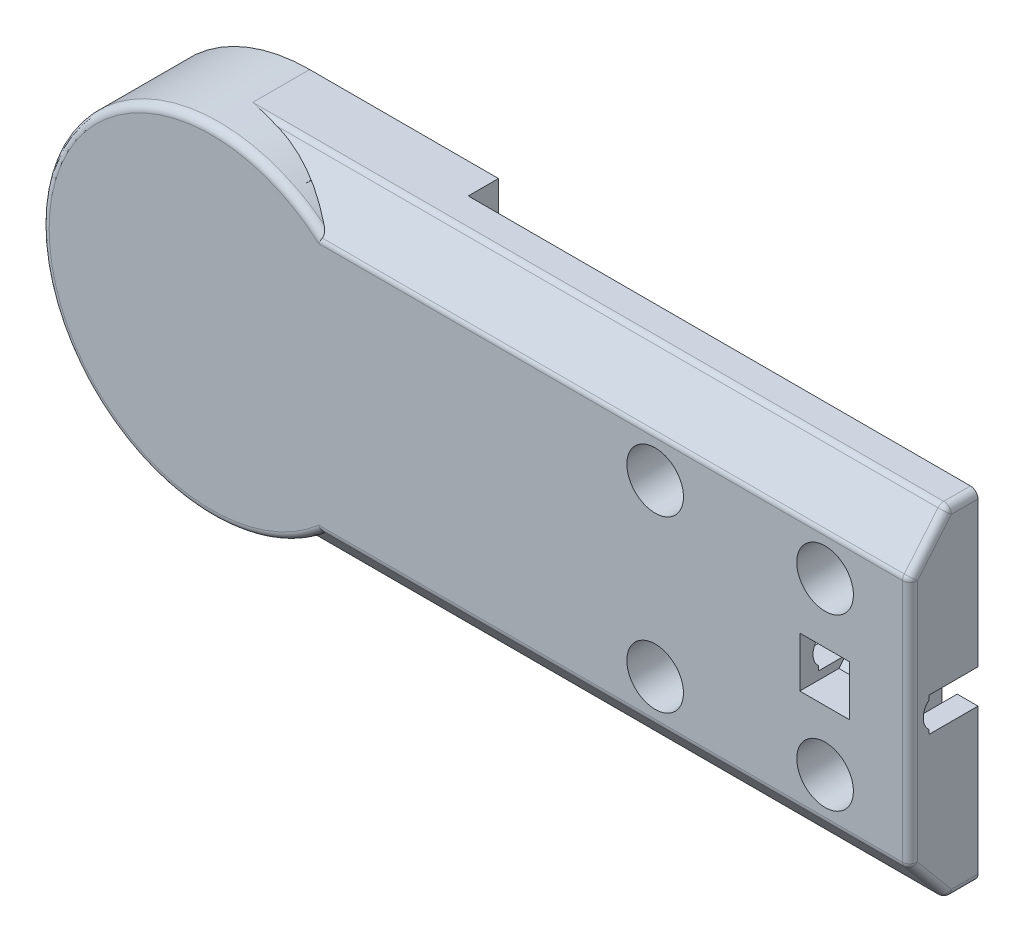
ISO-10303-21;
HEADER;
FILE_DESCRIPTION(('STEP AP214'),'2;1');
FILE_NAME('part.step','',(''),(''),'','','');
FILE_SCHEMA(('AUTOMOTIVE_DESIGN { 1 0 10303 214 1 1 1 1 }'));
ENDSEC;
DATA;
#1=APPLICATION_CONTEXT('core data for automotive mechanical design processes');
#2=APPLICATION_PROTOCOL_DEFINITION('international standard','automotive_design',2000,#1);
#3=PRODUCT_CONTEXT('',#1,'mechanical');
#4=PRODUCT('Part','Part','',(#3));
#5=PRODUCT_RELATED_PRODUCT_CATEGORY('part','',(#4));
#6=PRODUCT_DEFINITION_FORMATION('','',#4);
#7=PRODUCT_DEFINITION_CONTEXT('part definition',#1,'design');
#8=PRODUCT_DEFINITION('design','',#6,#7);
#9=PRODUCT_DEFINITION_SHAPE('','',#8);
#10=(LENGTH_UNIT() NAMED_UNIT(*) SI_UNIT(.MILLI.,.METRE.));
#11=(NAMED_UNIT(*) PLANE_ANGLE_UNIT() SI_UNIT($,.RADIAN.));
#12=(NAMED_UNIT(*) SI_UNIT($,.STERADIAN.) SOLID_ANGLE_UNIT());
#13=UNCERTAINTY_MEASURE_WITH_UNIT(LENGTH_MEASURE(1.E-05),#10,'distance_accuracy_value','');
#14=(GEOMETRIC_REPRESENTATION_CONTEXT(3) GLOBAL_UNCERTAINTY_ASSIGNED_CONTEXT((#13)) GLOBAL_UNIT_ASSIGNED_CONTEXT((#10,
#11,#12)) REPRESENTATION_CONTEXT('',''));
#15=CARTESIAN_POINT('',(0.,0.,0.));
#16=DIRECTION('',(0.,0.,1.));
#17=DIRECTION('',(1.,0.,0.));
#18=AXIS2_PLACEMENT_3D('',#15,#16,#17);
#19=CARTESIAN_POINT('',(0.,0.,22.));
#20=DIRECTION('',(0.,0.,1.));
#21=DIRECTION('',(1.,0.,0.));
#22=AXIS2_PLACEMENT_3D('',#19,#20,#21);
#23=PLANE('',#22);
#24=CARTESIAN_POINT('',(0.,0.,22.));
#25=DIRECTION('',(0.,0.,-1.));
#26=DIRECTION('',(-1.,0.,0.));
#27=AXIS2_PLACEMENT_3D('',#24,#25,#26);
#28=CIRCLE('',#27,22.5);
#29=CARTESIAN_POINT('',(-22.5,0.,22.));
#30=VERTEX_POINT('',#29);
#31=EDGE_CURVE('E1906',#30,#30,#28,.T.);
#32=ORIENTED_EDGE('',*,*,#31,.T.);
#33=EDGE_LOOP('',(#32));
#34=FACE_BOUND('',#33,.T.);
#35=ADVANCED_FACE('F15',(#34),#23,.F.);
#36=CARTESIAN_POINT('',(0.,0.,22.));
#37=DIRECTION('',(0.,0.,-1.));
#38=DIRECTION('',(-1.,0.,0.));
#39=AXIS2_PLACEMENT_3D('',#36,#37,#38);
#40=CYLINDRICAL_SURFACE('',#39,22.5);
#41=ORIENTED_EDGE('',*,*,#31,.F.);
#42=EDGE_LOOP('',(#41));
#43=FACE_BOUND('',#42,.T.);
#44=CARTESIAN_POINT('',(0.,0.,21.));
#45=DIRECTION('',(0.,0.,-1.));
#46=DIRECTION('',(-1.,0.,0.));
#47=AXIS2_PLACEMENT_3D('',#44,#45,#46);
#48=CIRCLE('',#47,22.5);
#49=CARTESIAN_POINT('',(-22.5,0.,21.));
#50=VERTEX_POINT('',#49);
#51=EDGE_CURVE('E1902',#50,#50,#48,.T.);
#52=ORIENTED_EDGE('',*,*,#51,.T.);
#53=EDGE_LOOP('',(#52));
#54=FACE_BOUND('',#53,.T.);
#55=ADVANCED_FACE('F1912',(#43,#54),#40,.F.);
#56=CARTESIAN_POINT('',(0.,0.,0.));
#57=DIRECTION('',(0.,0.,1.));
#58=DIRECTION('',(1.,0.,0.));
#59=AXIS2_PLACEMENT_3D('',#56,#57,#58);
#60=CYLINDRICAL_SURFACE('',#59,40.);
#61=DIRECTION('',(0.,0.,-1.));
#62=VECTOR('',#61,1.);
#63=CARTESIAN_POINT('',(13.,37.8285606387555,20.2586154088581));
#64=LINE('',#63,#62);
#65=CARTESIAN_POINT('',(13.,37.8285606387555,21.9761994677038));
#66=VERTEX_POINT('',#65);
#67=CARTESIAN_POINT('',(13.,37.8285606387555,18.3571496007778));
#68=VERTEX_POINT('',#67);
#69=EDGE_CURVE('E1901',#66,#68,#64,.T.);
#70=ORIENTED_EDGE('',*,*,#69,.T.);
#71=CARTESIAN_POINT('',(24.,32.,22.));
#72=CARTESIAN_POINT('',(21.4947404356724,33.8788451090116,20.8257218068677));
#73=CARTESIAN_POINT('',(18.7281347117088,35.3448294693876,19.9094815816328));
#74=CARTESIAN_POINT('',(15.9619784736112,36.8105756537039,18.9933902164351));
#75=CARTESIAN_POINT('',(13.,37.8285606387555,18.3571496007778));
#76=B_SPLINE_CURVE_WITH_KNOTS('',2,(#71,#72,#73,#74,#75),.UNSPECIFIED.,.F.,.F.,(3,2,3),(0.,0.5,
1.),.UNSPECIFIED.);
#77=CARTESIAN_POINT('',(24.,32.,22.));
#78=VERTEX_POINT('',#77);
#79=EDGE_CURVE('E1527',#78,#68,#76,.T.);
#80=ORIENTED_EDGE('',*,*,#79,.F.);
#81=CARTESIAN_POINT('',(0.,0.,22.));
#82=DIRECTION('',(0.,0.,1.));
#83=DIRECTION('',(1.,0.,0.));
#84=AXIS2_PLACEMENT_3D('',#81,#82,#83);
#85=CIRCLE('',#84,40.);
#86=CARTESIAN_POINT('',(13.082813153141,37.8,22.));
#87=VERTEX_POINT('',#86);
#88=EDGE_CURVE('E1505',#78,#87,#85,.T.);
#89=ORIENTED_EDGE('',*,*,#88,.T.);
#90=CARTESIAN_POINT('',(13.,37.8285606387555,21.9761994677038));
#91=DIRECTION('',(0.912285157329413,-0.314629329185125,0.262191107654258));
#92=VECTOR('',#91,1.);
#93=LINE('',#90,#92);
#94=EDGE_CURVE('E1905',#66,#87,#93,.T.);
#95=ORIENTED_EDGE('',*,*,#94,.F.);
#96=EDGE_LOOP('',(#70,#80,#89,#95));
#97=FACE_BOUND('',#96,.T.);
#98=ADVANCED_FACE('F1915',(#97),#60,.F.);
#99=CARTESIAN_POINT('',(0.,0.,0.));
#100=DIRECTION('',(0.,0.,1.));
#101=DIRECTION('',(1.,0.,0.));
#102=AXIS2_PLACEMENT_3D('',#99,#100,#101);
#103=CYLINDRICAL_SURFACE('',#102,40.);
#104=CARTESIAN_POINT('',(0.,0.,22.));
#105=DIRECTION('',(0.,0.,1.));
#106=DIRECTION('',(1.,0.,0.));
#107=AXIS2_PLACEMENT_3D('',#104,#105,#106);
#108=CIRCLE('',#107,40.);
#109=CARTESIAN_POINT('',(13.0828131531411,-37.8,22.));
#110=VERTEX_POINT('',#109);
#111=CARTESIAN_POINT('',(24.,-32.,22.));
#112=VERTEX_POINT('',#111);
#113=EDGE_CURVE('E1465',#110,#112,#108,.T.);
#114=ORIENTED_EDGE('',*,*,#113,.T.);
#115=CARTESIAN_POINT('',(13.,-37.8285606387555,18.3571496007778));
#116=CARTESIAN_POINT('',(15.918490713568,-36.8255158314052,18.9840526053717));
#117=CARTESIAN_POINT('',(18.6517692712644,-35.384824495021,19.8844846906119));
#118=CARTESIAN_POINT('',(21.4612093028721,-33.9039889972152,20.8100068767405));
#119=CARTESIAN_POINT('',(24.,-32.,22.));
#120=B_SPLINE_CURVE_WITH_KNOTS('',2,(#115,#116,#117,#118,#119),.UNSPECIFIED.,.F.,.F.,(3,2,3),
(0.,0.5,1.),.UNSPECIFIED.);
#121=CARTESIAN_POINT('',(13.,-37.8285606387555,18.3571496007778));
#122=VERTEX_POINT('',#121);
#123=EDGE_CURVE('E1573',#122,#112,#120,.T.);
#124=ORIENTED_EDGE('',*,*,#123,.F.);
#125=DIRECTION('',(0.,0.,1.));
#126=VECTOR('',#125,1.);
#127=CARTESIAN_POINT('',(13.,-37.8285606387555,19.4880997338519));
#128=LINE('',#127,#126);
#129=CARTESIAN_POINT('',(13.,-37.8285606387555,21.9761994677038));
#130=VERTEX_POINT('',#129);
#131=EDGE_CURVE('E1892',#122,#130,#128,.T.);
#132=ORIENTED_EDGE('',*,*,#131,.T.);
#133=CARTESIAN_POINT('',(13.0828131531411,-37.8,22.));
#134=DIRECTION('',(-0.912285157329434,-0.314629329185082,-0.262191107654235));
#135=VECTOR('',#134,1.);
#136=LINE('',#133,#135);
#137=EDGE_CURVE('E1953',#110,#130,#136,.T.);
#138=ORIENTED_EDGE('',*,*,#137,.F.);
#139=EDGE_LOOP('',(#114,#124,#132,#138));
#140=FACE_BOUND('',#139,.T.);
#141=ADVANCED_FACE('F1921',(#140),#103,.F.);
#142=CARTESIAN_POINT('',(0.,0.,21.));
#143=DIRECTION('',(0.,0.,1.));
#144=DIRECTION('',(1.,0.,0.));
#145=AXIS2_PLACEMENT_3D('',#142,#143,#144);
#146=PLANE('',#145);
#147=ORIENTED_EDGE('',*,*,#51,.F.);
#148=EDGE_LOOP('',(#147));
#149=FACE_BOUND('',#148,.T.);
#150=CARTESIAN_POINT('',(0.,0.,21.));
#151=DIRECTION('',(0.,0.,1.));
#152=DIRECTION('',(1.,0.,0.));
#153=AXIS2_PLACEMENT_3D('',#150,#151,#152);
#154=CIRCLE('',#153,26.);
#155=CARTESIAN_POINT('',(26.,0.,21.));
#156=VERTEX_POINT('',#155);
#157=EDGE_CURVE('E1875',#156,#156,#154,.F.);
#158=ORIENTED_EDGE('',*,*,#157,.T.);
#159=EDGE_LOOP('',(#158));
#160=FACE_BOUND('',#159,.T.);
#161=ADVANCED_FACE('F1554',(#149,#160),#146,.F.);
#162=CARTESIAN_POINT('',(39.2631677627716,39.,21.));
#163=DIRECTION('',(0.,0.64018439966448,0.768221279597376));
#164=DIRECTION('',(0.,-0.768221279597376,0.64018439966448));
#165=AXIS2_PLACEMENT_3D('',#162,#163,#164);
#166=PLANE('',#165);
#167=ORIENTED_EDGE('',*,*,#94,.T.);
#168=DIRECTION('',(1.,0.,0.));
#169=VECTOR('',#168,1.);
#170=CARTESIAN_POINT('',(25.7419849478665,37.8,22.));
#171=LINE('',#170,#169);
#172=CARTESIAN_POINT('',(13.4713715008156,37.8,22.));
#173=VERTEX_POINT('',#172);
#174=EDGE_CURVE('E1502',#87,#173,#171,.T.);
#175=ORIENTED_EDGE('',*,*,#174,.T.);
#176=DIRECTION('',(-0.928055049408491,-0.286118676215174,0.238432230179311));
#177=VECTOR('',#176,1.);
#178=CARTESIAN_POINT('',(20.6072954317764,40.,20.1666666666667));
#179=LINE('',#178,#177);
#180=CARTESIAN_POINT('',(20.6072954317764,40.,20.1666666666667));
#181=VERTEX_POINT('',#180);
#182=EDGE_CURVE('E1898',#181,#173,#179,.T.);
#183=ORIENTED_EDGE('',*,*,#182,.F.);
#184=DIRECTION('',(1.,0.,0.));
#185=VECTOR('',#184,1.);
#186=CARTESIAN_POINT('',(2.75,40.,20.1666666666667));
#187=LINE('',#186,#185);
#188=CARTESIAN_POINT('',(13.,40.,20.1666666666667));
#189=VERTEX_POINT('',#188);
#190=EDGE_CURVE('E2012',#181,#189,#187,.F.);
#191=ORIENTED_EDGE('',*,*,#190,.T.);
#192=DIRECTION('',(0.,-0.768221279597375,0.640184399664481));
#193=VECTOR('',#192,1.);
#194=CARTESIAN_POINT('',(13.,40.,20.1666666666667));
#195=LINE('',#194,#193);
#196=EDGE_CURVE('E1995',#189,#66,#195,.T.);
#197=ORIENTED_EDGE('',*,*,#196,.T.);
#198=EDGE_LOOP('',(#167,#175,#183,#191,#197));
#199=FACE_BOUND('',#198,.T.);
#200=ADVANCED_FACE('F1549',(#199),#166,.T.);
#201=CARTESIAN_POINT('',(13.,36.686196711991,20.2586154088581));
#202=DIRECTION('',(1.,0.,0.));
#203=DIRECTION('',(0.,0.,-1.));
#204=AXIS2_PLACEMENT_3D('',#201,#202,#203);
#205=PLANE('',#204);
#206=ORIENTED_EDGE('',*,*,#196,.F.);
#207=DIRECTION('',(0.,0.,1.));
#208=VECTOR('',#207,1.);
#209=CARTESIAN_POINT('',(13.,40.,0.));
#210=LINE('',#209,#208);
#211=CARTESIAN_POINT('',(13.,40.,17.));
#212=VERTEX_POINT('',#211);
#213=EDGE_CURVE('E2015',#189,#212,#210,.F.);
#214=ORIENTED_EDGE('',*,*,#213,.T.);
#215=DIRECTION('',(0.,0.847998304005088,-0.52999894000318));
#216=VECTOR('',#215,1.);
#217=CARTESIAN_POINT('',(13.,32.,22.));
#218=LINE('',#217,#216);
#219=EDGE_CURVE('E1511',#68,#212,#218,.T.);
#220=ORIENTED_EDGE('',*,*,#219,.F.);
#221=ORIENTED_EDGE('',*,*,#69,.F.);
#222=EDGE_LOOP('',(#206,#214,#220,#221));
#223=FACE_BOUND('',#222,.T.);
#224=ADVANCED_FACE('F1546',(#223),#205,.F.);
#225=CARTESIAN_POINT('',(20.6072954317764,40.,22.));
#226=DIRECTION('',(-0.294615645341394,0.955615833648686,0.));
#227=DIRECTION('',(0.,0.,-1.));
#228=AXIS2_PLACEMENT_3D('',#225,#226,#227);
#229=PLANE('',#228);
#230=DIRECTION('',(0.955615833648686,0.294615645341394,0.));
#231=VECTOR('',#230,1.);
#232=CARTESIAN_POINT('',(13.4713715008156,37.8,22.));
#233=LINE('',#232,#231);
#234=CARTESIAN_POINT('',(20.6072954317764,40.,22.));
#235=VERTEX_POINT('',#234);
#236=EDGE_CURVE('E1504',#173,#235,#233,.T.);
#237=ORIENTED_EDGE('',*,*,#236,.T.);
#238=DIRECTION('',(0.,0.,1.));
#239=VECTOR('',#238,1.);
#240=CARTESIAN_POINT('',(20.6072954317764,40.,0.));
#241=LINE('',#240,#239);
#242=EDGE_CURVE('E1522',#235,#181,#241,.F.);
#243=ORIENTED_EDGE('',*,*,#242,.T.);
#244=ORIENTED_EDGE('',*,*,#182,.T.);
#245=EDGE_LOOP('',(#237,#243,#244));
#246=FACE_BOUND('',#245,.T.);
#247=ADVANCED_FACE('F1544',(#246),#229,.T.);
#248=CARTESIAN_POINT('',(45.,32.,22.));
#249=DIRECTION('',(0.,-0.52999894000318,-0.847998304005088));
#250=DIRECTION('',(0.,0.847998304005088,-0.52999894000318));
#251=AXIS2_PLACEMENT_3D('',#248,#249,#250);
#252=PLANE('',#251);
#253=DIRECTION('',(0.,-0.847998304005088,0.52999894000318));
#254=VECTOR('',#253,1.);
#255=CARTESIAN_POINT('',(45.,40.,17.));
#256=LINE('',#255,#254);
#257=CARTESIAN_POINT('',(45.,40.,17.));
#258=VERTEX_POINT('',#257);
#259=CARTESIAN_POINT('',(45.,32.,22.));
#260=VERTEX_POINT('',#259);
#261=EDGE_CURVE('E2030',#258,#260,#256,.T.);
#262=ORIENTED_EDGE('',*,*,#261,.T.);
#263=DIRECTION('',(1.,0.,0.));
#264=VECTOR('',#263,1.);
#265=CARTESIAN_POINT('',(25.7419849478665,32.,22.));
#266=LINE('',#265,#264);
#267=EDGE_CURVE('E1508',#260,#78,#266,.F.);
#268=ORIENTED_EDGE('',*,*,#267,.T.);
#269=ORIENTED_EDGE('',*,*,#79,.T.);
#270=ORIENTED_EDGE('',*,*,#219,.T.);
#271=DIRECTION('',(1.,0.,0.));
#272=VECTOR('',#271,1.);
#273=CARTESIAN_POINT('',(2.75,40.,17.));
#274=LINE('',#273,#272);
#275=EDGE_CURVE('E2018',#212,#258,#274,.T.);
#276=ORIENTED_EDGE('',*,*,#275,.T.);
#277=EDGE_LOOP('',(#262,#268,#269,#270,#276));
#278=FACE_BOUND('',#277,.T.);
#279=ADVANCED_FACE('F1533',(#278),#252,.T.);
#280=CARTESIAN_POINT('',(25.7419849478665,30.4412846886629,22.));
#281=DIRECTION('',(0.,0.,1.));
#282=DIRECTION('',(1.,0.,0.));
#283=AXIS2_PLACEMENT_3D('',#280,#281,#282);
#284=PLANE('',#283);
#285=ORIENTED_EDGE('',*,*,#174,.F.);
#286=ORIENTED_EDGE('',*,*,#88,.F.);
#287=ORIENTED_EDGE('',*,*,#267,.F.);
#288=DIRECTION('',(0.,1.,0.));
#289=VECTOR('',#288,1.);
#290=CARTESIAN_POINT('',(45.,40.,22.));
#291=LINE('',#290,#289);
#292=CARTESIAN_POINT('',(45.,20.1032827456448,22.));
#293=VERTEX_POINT('',#292);
#294=EDGE_CURVE('E1519',#260,#293,#291,.F.);
#295=ORIENTED_EDGE('',*,*,#294,.T.);
#296=DIRECTION('',(0.939692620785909,0.342020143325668,0.));
#297=VECTOR('',#296,1.);
#298=CARTESIAN_POINT('',(45.,20.1032827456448,22.));
#299=LINE('',#298,#297);
#300=CARTESIAN_POINT('',(27.7471401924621,13.8237553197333,22.));
#301=VERTEX_POINT('',#300);
#302=EDGE_CURVE('E1514',#293,#301,#299,.F.);
#303=ORIENTED_EDGE('',*,*,#302,.T.);
#304=CARTESIAN_POINT('',(0.,0.,22.));
#305=DIRECTION('',(0.,0.,1.));
#306=DIRECTION('',(1.,0.,0.));
#307=AXIS2_PLACEMENT_3D('',#304,#305,#306);
#308=CIRCLE('',#307,31.);
#309=CARTESIAN_POINT('',(2.75,30.8777832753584,22.));
#310=VERTEX_POINT('',#309);
#311=EDGE_CURVE('E1873',#310,#301,#308,.F.);
#312=ORIENTED_EDGE('',*,*,#311,.F.);
#313=DIRECTION('',(0.,1.,0.));
#314=VECTOR('',#313,1.);
#315=CARTESIAN_POINT('',(2.75,30.8777832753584,22.));
#316=LINE('',#315,#314);
#317=CARTESIAN_POINT('',(2.75,40.,22.));
#318=VERTEX_POINT('',#317);
#319=EDGE_CURVE('E2033',#310,#318,#316,.T.);
#320=ORIENTED_EDGE('',*,*,#319,.T.);
#321=DIRECTION('',(1.,0.,0.));
#322=VECTOR('',#321,1.);
#323=CARTESIAN_POINT('',(2.75,40.,22.));
#324=LINE('',#323,#322);
#325=EDGE_CURVE('E2026',#318,#235,#324,.T.);
#326=ORIENTED_EDGE('',*,*,#325,.T.);
#327=ORIENTED_EDGE('',*,*,#236,.F.);
#328=EDGE_LOOP('',(#285,#286,#287,#295,#303,#312,#320,#326,#327));
#329=FACE_BOUND('',#328,.T.);
#330=ADVANCED_FACE('F1543',(#329),#284,.F.);
#331=CARTESIAN_POINT('',(45.,-40.,17.));
#332=DIRECTION('',(0.,0.52999894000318,-0.847998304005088));
#333=DIRECTION('',(-1.,0.,0.));
#334=AXIS2_PLACEMENT_3D('',#331,#332,#333);
#335=PLANE('',#334);
#336=DIRECTION('',(1.,0.,0.));
#337=VECTOR('',#336,1.);
#338=CARTESIAN_POINT('',(45.,-40.,17.));
#339=LINE('',#338,#337);
#340=CARTESIAN_POINT('',(45.,-40.,17.));
#341=VERTEX_POINT('',#340);
#342=CARTESIAN_POINT('',(13.,-40.,17.));
#343=VERTEX_POINT('',#342);
#344=EDGE_CURVE('E1485',#341,#343,#339,.F.);
#345=ORIENTED_EDGE('',*,*,#344,.T.);
#346=DIRECTION('',(0.,0.847998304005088,0.52999894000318));
#347=VECTOR('',#346,1.);
#348=CARTESIAN_POINT('',(13.,-40.,17.));
#349=LINE('',#348,#347);
#350=EDGE_CURVE('E1890',#343,#122,#349,.T.);
#351=ORIENTED_EDGE('',*,*,#350,.T.);
#352=ORIENTED_EDGE('',*,*,#123,.T.);
#353=DIRECTION('',(1.,0.,0.));
#354=VECTOR('',#353,1.);
#355=CARTESIAN_POINT('',(25.7419849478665,-32.,22.));
#356=LINE('',#355,#354);
#357=CARTESIAN_POINT('',(45.,-32.,22.));
#358=VERTEX_POINT('',#357);
#359=EDGE_CURVE('E1462',#112,#358,#356,.T.);
#360=ORIENTED_EDGE('',*,*,#359,.T.);
#361=DIRECTION('',(0.,-0.847998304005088,-0.52999894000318));
#362=VECTOR('',#361,1.);
#363=CARTESIAN_POINT('',(45.,-32.,22.));
#364=LINE('',#363,#362);
#365=EDGE_CURVE('E1482',#358,#341,#364,.T.);
#366=ORIENTED_EDGE('',*,*,#365,.T.);
#367=EDGE_LOOP('',(#345,#351,#352,#360,#366));
#368=FACE_BOUND('',#367,.T.);
#369=ADVANCED_FACE('F1579',(#368),#335,.T.);
#370=CARTESIAN_POINT('',(13.,-40.,21.9761994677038));
#371=DIRECTION('',(1.,0.,0.));
#372=DIRECTION('',(0.,0.,-1.));
#373=AXIS2_PLACEMENT_3D('',#370,#371,#372);
#374=PLANE('',#373);
#375=ORIENTED_EDGE('',*,*,#350,.F.);
#376=DIRECTION('',(0.,0.,-1.));
#377=VECTOR('',#376,1.);
#378=CARTESIAN_POINT('',(13.,-40.,0.));
#379=LINE('',#378,#377);
#380=CARTESIAN_POINT('',(13.,-40.,20.1666666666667));
#381=VERTEX_POINT('',#380);
#382=EDGE_CURVE('E1487',#343,#381,#379,.F.);
#383=ORIENTED_EDGE('',*,*,#382,.T.);
#384=DIRECTION('',(0.,-0.768221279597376,-0.64018439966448));
#385=VECTOR('',#384,1.);
#386=CARTESIAN_POINT('',(13.,-39.,21.));
#387=LINE('',#386,#385);
#388=EDGE_CURVE('E1960',#130,#381,#387,.T.);
#389=ORIENTED_EDGE('',*,*,#388,.F.);
#390=ORIENTED_EDGE('',*,*,#131,.F.);
#391=EDGE_LOOP('',(#375,#383,#389,#390));
#392=FACE_BOUND('',#391,.T.);
#393=ADVANCED_FACE('F1589',(#392),#374,.F.);
#394=CARTESIAN_POINT('',(131.763167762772,-39.,21.));
#395=DIRECTION('',(0.,-0.64018439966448,0.768221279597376));
#396=DIRECTION('',(0.,-0.768221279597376,-0.64018439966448));
#397=AXIS2_PLACEMENT_3D('',#394,#395,#396);
#398=PLANE('',#397);
#399=ORIENTED_EDGE('',*,*,#388,.T.);
#400=DIRECTION('',(1.,0.,0.));
#401=VECTOR('',#400,1.);
#402=CARTESIAN_POINT('',(45.,-40.,20.1666666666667));
#403=LINE('',#402,#401);
#404=CARTESIAN_POINT('',(20.6072954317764,-40.,20.1666666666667));
#405=VERTEX_POINT('',#404);
#406=EDGE_CURVE('E1495',#381,#405,#403,.T.);
#407=ORIENTED_EDGE('',*,*,#406,.T.);
#408=DIRECTION('',(0.928055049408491,-0.286118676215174,-0.238432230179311));
#409=VECTOR('',#408,1.);
#410=CARTESIAN_POINT('',(13.4713715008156,-37.8,22.));
#411=LINE('',#410,#409);
#412=CARTESIAN_POINT('',(13.4713715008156,-37.8,22.));
#413=VERTEX_POINT('',#412);
#414=EDGE_CURVE('E1471',#413,#405,#411,.T.);
#415=ORIENTED_EDGE('',*,*,#414,.F.);
#416=DIRECTION('',(1.,0.,0.));
#417=VECTOR('',#416,1.);
#418=CARTESIAN_POINT('',(25.7419849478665,-37.8,22.));
#419=LINE('',#418,#417);
#420=EDGE_CURVE('E1468',#413,#110,#419,.F.);
#421=ORIENTED_EDGE('',*,*,#420,.T.);
#422=ORIENTED_EDGE('',*,*,#137,.T.);
#423=EDGE_LOOP('',(#399,#407,#415,#421,#422));
#424=FACE_BOUND('',#423,.T.);
#425=ADVANCED_FACE('F1593',(#424),#398,.T.);
#426=CARTESIAN_POINT('',(13.4713715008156,-37.8,22.));
#427=DIRECTION('',(-0.294615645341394,-0.955615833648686,0.));
#428=DIRECTION('',(0.955615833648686,-0.294615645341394,0.));
#429=AXIS2_PLACEMENT_3D('',#426,#427,#428);
#430=PLANE('',#429);
#431=DIRECTION('',(0.,0.,-1.));
#432=VECTOR('',#431,1.);
#433=CARTESIAN_POINT('',(20.6072954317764,-40.,0.));
#434=LINE('',#433,#432);
#435=CARTESIAN_POINT('',(20.6072954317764,-40.,22.));
#436=VERTEX_POINT('',#435);
#437=EDGE_CURVE('E1491',#405,#436,#434,.F.);
#438=ORIENTED_EDGE('',*,*,#437,.T.);
#439=DIRECTION('',(-0.955615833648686,0.294615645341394,0.));
#440=VECTOR('',#439,1.);
#441=CARTESIAN_POINT('',(20.6072954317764,-40.,22.));
#442=LINE('',#441,#440);
#443=EDGE_CURVE('E1464',#436,#413,#442,.T.);
#444=ORIENTED_EDGE('',*,*,#443,.T.);
#445=ORIENTED_EDGE('',*,*,#414,.T.);
#446=EDGE_LOOP('',(#438,#444,#445));
#447=FACE_BOUND('',#446,.T.);
#448=ADVANCED_FACE('F2047',(#447),#430,.T.);
#449=CARTESIAN_POINT('',(25.7419849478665,-30.4412846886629,22.));
#450=DIRECTION('',(0.,0.,1.));
#451=DIRECTION('',(1.,0.,0.));
#452=AXIS2_PLACEMENT_3D('',#449,#450,#451);
#453=PLANE('',#452);
#454=DIRECTION('',(1.,0.,0.));
#455=VECTOR('',#454,1.);
#456=CARTESIAN_POINT('',(45.,-40.,22.));
#457=LINE('',#456,#455);
#458=CARTESIAN_POINT('',(2.75,-40.,22.));
#459=VERTEX_POINT('',#458);
#460=EDGE_CURVE('E1479',#436,#459,#457,.F.);
#461=ORIENTED_EDGE('',*,*,#460,.T.);
#462=DIRECTION('',(0.,1.,0.));
#463=VECTOR('',#462,1.);
#464=CARTESIAN_POINT('',(2.75,-40.,22.));
#465=LINE('',#464,#463);
#466=CARTESIAN_POINT('',(2.74999999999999,-30.8777832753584,22.));
#467=VERTEX_POINT('',#466);
#468=EDGE_CURVE('E1474',#459,#467,#465,.T.);
#469=ORIENTED_EDGE('',*,*,#468,.T.);
#470=CARTESIAN_POINT('',(0.,0.,22.));
#471=DIRECTION('',(0.,0.,1.));
#472=DIRECTION('',(1.,0.,0.));
#473=AXIS2_PLACEMENT_3D('',#470,#471,#472);
#474=CIRCLE('',#473,31.);
#475=CARTESIAN_POINT('',(27.7471401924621,-13.8237553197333,22.));
#476=VERTEX_POINT('',#475);
#477=EDGE_CURVE('E1517',#476,#467,#474,.F.);
#478=ORIENTED_EDGE('',*,*,#477,.F.);
#479=DIRECTION('',(-0.939692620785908,0.342020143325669,0.));
#480=VECTOR('',#479,1.);
#481=CARTESIAN_POINT('',(27.7471401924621,-13.8237553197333,22.));
#482=LINE('',#481,#480);
#483=CARTESIAN_POINT('',(45.,-20.1032827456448,22.));
#484=VERTEX_POINT('',#483);
#485=EDGE_CURVE('E1499',#476,#484,#482,.F.);
#486=ORIENTED_EDGE('',*,*,#485,.T.);
#487=DIRECTION('',(0.,1.,0.));
#488=VECTOR('',#487,1.);
#489=CARTESIAN_POINT('',(45.,-20.1032827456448,22.));
#490=LINE('',#489,#488);
#491=EDGE_CURVE('E1484',#484,#358,#490,.F.);
#492=ORIENTED_EDGE('',*,*,#491,.T.);
#493=ORIENTED_EDGE('',*,*,#359,.F.);
#494=ORIENTED_EDGE('',*,*,#113,.F.);
#495=ORIENTED_EDGE('',*,*,#420,.F.);
#496=ORIENTED_EDGE('',*,*,#443,.F.);
#497=EDGE_LOOP('',(#461,#469,#478,#486,#492,#493,#494,#495,#496));
#498=FACE_BOUND('',#497,.T.);
#499=ADVANCED_FACE('F1964',(#498),#453,.F.);
#500=CARTESIAN_POINT('',(38.7847609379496,0.,22.));
#501=DIRECTION('',(0.,0.,1.));
#502=DIRECTION('',(1.,0.,0.));
#503=AXIS2_PLACEMENT_3D('',#500,#501,#502);
#504=PLANE('',#503);
#505=CARTESIAN_POINT('',(0.,0.,22.));
#506=DIRECTION('',(0.,0.,1.));
#507=DIRECTION('',(1.,0.,0.));
#508=AXIS2_PLACEMENT_3D('',#505,#506,#507);
#509=CIRCLE('',#508,31.);
#510=CARTESIAN_POINT('',(30.1412811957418,7.2459069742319,22.));
#511=VERTEX_POINT('',#510);
#512=CARTESIAN_POINT('',(30.1412811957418,-7.24590697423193,22.));
#513=VERTEX_POINT('',#512);
#514=EDGE_CURVE('E1477',#511,#513,#509,.F.);
#515=ORIENTED_EDGE('',*,*,#514,.F.);
#516=DIRECTION('',(-0.939692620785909,-0.342020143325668,0.));
#517=VECTOR('',#516,1.);
#518=CARTESIAN_POINT('',(30.1412811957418,7.2459069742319,22.));
#519=LINE('',#518,#517);
#520=CARTESIAN_POINT('',(45.,12.6540383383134,22.));
#521=VERTEX_POINT('',#520);
#522=EDGE_CURVE('E1459',#511,#521,#519,.F.);
#523=ORIENTED_EDGE('',*,*,#522,.T.);
#524=DIRECTION('',(0.,1.,0.));
#525=VECTOR('',#524,1.);
#526=CARTESIAN_POINT('',(45.,12.6540383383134,22.));
#527=LINE('',#526,#525);
#528=CARTESIAN_POINT('',(45.,-12.6540383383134,22.));
#529=VERTEX_POINT('',#528);
#530=EDGE_CURVE('E1455',#521,#529,#527,.F.);
#531=ORIENTED_EDGE('',*,*,#530,.T.);
#532=DIRECTION('',(0.939692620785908,-0.342020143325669,0.));
#533=VECTOR('',#532,1.);
#534=CARTESIAN_POINT('',(45.,-12.6540383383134,22.));
#535=LINE('',#534,#533);
#536=EDGE_CURVE('E1447',#529,#513,#535,.F.);
#537=ORIENTED_EDGE('',*,*,#536,.T.);
#538=EDGE_LOOP('',(#515,#523,#531,#537));
#539=FACE_BOUND('',#538,.T.);
#540=ADVANCED_FACE('F2337',(#539),#504,.F.);
#541=CARTESIAN_POINT('',(-34.1359594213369,0.,22.));
#542=DIRECTION('',(0.,0.,1.));
#543=DIRECTION('',(1.,0.,0.));
#544=AXIS2_PLACEMENT_3D('',#541,#542,#543);
#545=PLANE('',#544);
#546=DIRECTION('',(0.866025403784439,0.5,0.));
#547=VECTOR('',#546,1.);
#548=CARTESIAN_POINT('',(-28.1159447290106,-13.057321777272,22.));
#549=LINE('',#548,#547);
#550=CARTESIAN_POINT('',(-28.1159447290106,-13.057321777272,22.));
#551=VERTEX_POINT('',#550);
#552=CARTESIAN_POINT('',(-35.9340527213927,-17.5711085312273,22.));
#553=VERTEX_POINT('',#552);
#554=EDGE_CURVE('E1444',#551,#553,#549,.F.);
#555=ORIENTED_EDGE('',*,*,#554,.T.);
#556=CARTESIAN_POINT('',(0.,0.,22.));
#557=DIRECTION('',(0.,0.,1.));
#558=DIRECTION('',(1.,0.,0.));
#559=AXIS2_PLACEMENT_3D('',#556,#557,#558);
#560=CIRCLE('',#559,40.);
#561=CARTESIAN_POINT('',(-35.9340527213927,17.5711085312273,22.));
#562=VERTEX_POINT('',#561);
#563=EDGE_CURVE('E1869',#553,#562,#560,.F.);
#564=ORIENTED_EDGE('',*,*,#563,.T.);
#565=DIRECTION('',(-0.866025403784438,0.5,0.));
#566=VECTOR('',#565,1.);
#567=CARTESIAN_POINT('',(-35.9340527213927,17.5711085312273,22.));
#568=LINE('',#567,#566);
#569=CARTESIAN_POINT('',(-28.1159447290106,13.057321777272,22.));
#570=VERTEX_POINT('',#569);
#571=EDGE_CURVE('E1448',#562,#570,#568,.F.);
#572=ORIENTED_EDGE('',*,*,#571,.T.);
#573=CARTESIAN_POINT('',(0.,0.,22.));
#574=DIRECTION('',(0.,0.,1.));
#575=DIRECTION('',(1.,0.,0.));
#576=AXIS2_PLACEMENT_3D('',#573,#574,#575);
#577=CIRCLE('',#576,31.);
#578=EDGE_CURVE('E1450',#551,#570,#577,.F.);
#579=ORIENTED_EDGE('',*,*,#578,.F.);
#580=EDGE_LOOP('',(#555,#564,#572,#579));
#581=FACE_BOUND('',#580,.T.);
#582=ADVANCED_FACE('F2333',(#581),#545,.F.);
#583=CARTESIAN_POINT('',(-17.0679797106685,-29.5626080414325,22.));
#584=DIRECTION('',(0.,0.,1.));
#585=DIRECTION('',(1.,0.,0.));
#586=AXIS2_PLACEMENT_3D('',#583,#584,#585);
#587=PLANE('',#586);
#588=DIRECTION('',(0.,1.,0.));
#589=VECTOR('',#588,1.);
#590=CARTESIAN_POINT('',(-2.75,-30.8777832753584,22.));
#591=LINE('',#590,#589);
#592=CARTESIAN_POINT('',(-2.75000000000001,-30.8777832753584,22.));
#593=VERTEX_POINT('',#592);
#594=CARTESIAN_POINT('',(-2.75,-39.9053567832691,22.));
#595=VERTEX_POINT('',#594);
#596=EDGE_CURVE('E1436',#593,#595,#591,.F.);
#597=ORIENTED_EDGE('',*,*,#596,.T.);
#598=CARTESIAN_POINT('',(0.,0.,22.));
#599=DIRECTION('',(0.,0.,1.));
#600=DIRECTION('',(1.,0.,0.));
#601=AXIS2_PLACEMENT_3D('',#598,#599,#600);
#602=CIRCLE('',#601,40.);
#603=CARTESIAN_POINT('',(-33.1840527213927,-22.3342482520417,22.));
#604=VERTEX_POINT('',#603);
#605=EDGE_CURVE('E1864',#595,#604,#602,.F.);
#606=ORIENTED_EDGE('',*,*,#605,.T.);
#607=DIRECTION('',(-0.866025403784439,-0.5,0.));
#608=VECTOR('',#607,1.);
#609=CARTESIAN_POINT('',(-33.1840527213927,-22.3342482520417,22.));
#610=LINE('',#609,#608);
#611=CARTESIAN_POINT('',(-25.3659447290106,-17.8204614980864,22.));
#612=VERTEX_POINT('',#611);
#613=EDGE_CURVE('E1440',#604,#612,#610,.F.);
#614=ORIENTED_EDGE('',*,*,#613,.T.);
#615=CARTESIAN_POINT('',(0.,0.,22.));
#616=DIRECTION('',(0.,0.,1.));
#617=DIRECTION('',(1.,0.,0.));
#618=AXIS2_PLACEMENT_3D('',#615,#616,#617);
#619=CIRCLE('',#618,31.);
#620=EDGE_CURVE('E1442',#593,#612,#619,.F.);
#621=ORIENTED_EDGE('',*,*,#620,.F.);
#622=EDGE_LOOP('',(#597,#606,#614,#621));
#623=FACE_BOUND('',#622,.T.);
#624=ADVANCED_FACE('F2327',(#623),#587,.F.);
#625=CARTESIAN_POINT('',(-17.0679797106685,29.5626080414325,22.));
#626=DIRECTION('',(0.,0.,1.));
#627=DIRECTION('',(1.,0.,0.));
#628=AXIS2_PLACEMENT_3D('',#625,#626,#627);
#629=PLANE('',#628);
#630=CARTESIAN_POINT('',(0.,0.,22.));
#631=DIRECTION('',(0.,0.,1.));
#632=DIRECTION('',(1.,0.,0.));
#633=AXIS2_PLACEMENT_3D('',#630,#631,#632);
#634=CIRCLE('',#633,31.);
#635=CARTESIAN_POINT('',(-25.3659447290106,17.8204614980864,22.));
#636=VERTEX_POINT('',#635);
#637=CARTESIAN_POINT('',(-2.75,30.8777832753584,22.));
#638=VERTEX_POINT('',#637);
#639=EDGE_CURVE('E1858',#636,#638,#634,.F.);
#640=ORIENTED_EDGE('',*,*,#639,.F.);
#641=DIRECTION('',(0.866025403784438,-0.500000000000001,0.));
#642=VECTOR('',#641,1.);
#643=CARTESIAN_POINT('',(-25.3659447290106,17.8204614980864,22.));
#644=LINE('',#643,#642);
#645=CARTESIAN_POINT('',(-33.1840527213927,22.3342482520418,22.));
#646=VERTEX_POINT('',#645);
#647=EDGE_CURVE('E1432',#636,#646,#644,.F.);
#648=ORIENTED_EDGE('',*,*,#647,.T.);
#649=CARTESIAN_POINT('',(0.,0.,22.));
#650=DIRECTION('',(0.,0.,1.));
#651=DIRECTION('',(1.,0.,0.));
#652=AXIS2_PLACEMENT_3D('',#649,#650,#651);
#653=CIRCLE('',#652,40.);
#654=CARTESIAN_POINT('',(-2.75,39.9053567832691,22.));
#655=VERTEX_POINT('',#654);
#656=EDGE_CURVE('E1855',#646,#655,#653,.F.);
#657=ORIENTED_EDGE('',*,*,#656,.T.);
#658=DIRECTION('',(0.,1.,0.));
#659=VECTOR('',#658,1.);
#660=CARTESIAN_POINT('',(-2.75,39.9053567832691,22.));
#661=LINE('',#660,#659);
#662=EDGE_CURVE('E1416',#655,#638,#661,.F.);
#663=ORIENTED_EDGE('',*,*,#662,.T.);
#664=EDGE_LOOP('',(#640,#648,#657,#663));
#665=FACE_BOUND('',#664,.T.);
#666=ADVANCED_FACE('F2318',(#665),#629,.F.);
#667=CARTESIAN_POINT('',(174.75,-22.5,5.));
#668=DIRECTION('',(0.,0.,1.));
#669=DIRECTION('',(1.,0.,0.));
#670=AXIS2_PLACEMENT_3D('',#667,#668,#669);
#671=PLANE('',#670);
#672=DIRECTION('',(1.,0.,0.));
#673=VECTOR('',#672,1.);
#674=CARTESIAN_POINT('',(171.,-26.6,5.));
#675=LINE('',#674,#673);
#676=CARTESIAN_POINT('',(171.,-26.6,5.));
#677=VERTEX_POINT('',#676);
#678=CARTESIAN_POINT('',(178.5,-26.6,5.));
#679=VERTEX_POINT('',#678);
#680=EDGE_CURVE('E1162',#677,#679,#675,.T.);
#681=ORIENTED_EDGE('',*,*,#680,.F.);
#682=DIRECTION('',(0.,1.,0.));
#683=VECTOR('',#682,1.);
#684=CARTESIAN_POINT('',(171.,-18.4,5.));
#685=LINE('',#684,#683);
#686=CARTESIAN_POINT('',(171.,-18.4,5.));
#687=VERTEX_POINT('',#686);
#688=EDGE_CURVE('E1156',#687,#677,#685,.F.);
#689=ORIENTED_EDGE('',*,*,#688,.F.);
#690=DIRECTION('',(1.,0.,0.));
#691=VECTOR('',#690,1.);
#692=CARTESIAN_POINT('',(179.5,-18.4,5.));
#693=LINE('',#692,#691);
#694=CARTESIAN_POINT('',(178.5,-18.4,5.));
#695=VERTEX_POINT('',#694);
#696=EDGE_CURVE('E1148',#687,#695,#693,.T.);
#697=ORIENTED_EDGE('',*,*,#696,.T.);
#698=DIRECTION('',(0.,1.,0.));
#699=VECTOR('',#698,1.);
#700=CARTESIAN_POINT('',(178.5,-26.6,5.));
#701=LINE('',#700,#699);
#702=EDGE_CURVE('E1165',#679,#695,#701,.T.);
#703=ORIENTED_EDGE('',*,*,#702,.F.);
#704=EDGE_LOOP('',(#681,#689,#697,#703));
#705=FACE_BOUND('',#704,.T.);
#706=ADVANCED_FACE('F2315',(#705),#671,.F.);
#707=CARTESIAN_POINT('',(175.25,22.5,5.));
#708=DIRECTION('',(0.,0.,1.));
#709=DIRECTION('',(1.,0.,0.));
#710=AXIS2_PLACEMENT_3D('',#707,#708,#709);
#711=PLANE('',#710);
#712=DIRECTION('',(1.,0.,0.));
#713=VECTOR('',#712,1.);
#714=CARTESIAN_POINT('',(175.5,18.4,5.));
#715=LINE('',#714,#713);
#716=CARTESIAN_POINT('',(179.5,18.4,5.));
#717=VERTEX_POINT('',#716);
#718=CARTESIAN_POINT('',(171.,18.4,5.));
#719=VERTEX_POINT('',#718);
#720=EDGE_CURVE('E1205',#717,#719,#715,.F.);
#721=ORIENTED_EDGE('',*,*,#720,.T.);
#722=DIRECTION('',(0.,1.,0.));
#723=VECTOR('',#722,1.);
#724=CARTESIAN_POINT('',(171.,26.6,5.));
#725=LINE('',#724,#723);
#726=CARTESIAN_POINT('',(171.,26.6,5.));
#727=VERTEX_POINT('',#726);
#728=EDGE_CURVE('E1413',#727,#719,#725,.F.);
#729=ORIENTED_EDGE('',*,*,#728,.F.);
#730=DIRECTION('',(1.,0.,0.));
#731=VECTOR('',#730,1.);
#732=CARTESIAN_POINT('',(179.5,26.6,5.));
#733=LINE('',#732,#731);
#734=CARTESIAN_POINT('',(179.5,26.6,5.));
#735=VERTEX_POINT('',#734);
#736=EDGE_CURVE('E1199',#735,#727,#733,.F.);
#737=ORIENTED_EDGE('',*,*,#736,.F.);
#738=DIRECTION('',(0.,1.,0.));
#739=VECTOR('',#738,1.);
#740=CARTESIAN_POINT('',(179.5,18.4,5.));
#741=LINE('',#740,#739);
#742=EDGE_CURVE('E1194',#717,#735,#741,.T.);
#743=ORIENTED_EDGE('',*,*,#742,.F.);
#744=EDGE_LOOP('',(#721,#729,#737,#743));
#745=FACE_BOUND('',#744,.T.);
#746=ADVANCED_FACE('F2317',(#745),#711,.F.);
#747=CARTESIAN_POINT('',(141.,22.5,5.));
#748=DIRECTION('',(0.,0.,1.));
#749=DIRECTION('',(1.,0.,0.));
#750=AXIS2_PLACEMENT_3D('',#747,#748,#749);
#751=PLANE('',#750);
#752=DIRECTION('',(1.,0.,0.));
#753=VECTOR('',#752,1.);
#754=CARTESIAN_POINT('',(129.836531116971,18.4,5.));
#755=LINE('',#754,#753);
#756=CARTESIAN_POINT('',(156.,18.4,5.));
#757=VERTEX_POINT('',#756);
#758=CARTESIAN_POINT('',(126.,18.4,5.));
#759=VERTEX_POINT('',#758);
#760=EDGE_CURVE('E1100',#757,#759,#755,.F.);
#761=ORIENTED_EDGE('',*,*,#760,.T.);
#762=DIRECTION('',(0.,1.,0.));
#763=VECTOR('',#762,1.);
#764=CARTESIAN_POINT('',(126.,26.6,5.));
#765=LINE('',#764,#763);
#766=CARTESIAN_POINT('',(126.,26.6,5.));
#767=VERTEX_POINT('',#766);
#768=EDGE_CURVE('E1204',#767,#759,#765,.F.);
#769=ORIENTED_EDGE('',*,*,#768,.F.);
#770=DIRECTION('',(1.,0.,0.));
#771=VECTOR('',#770,1.);
#772=CARTESIAN_POINT('',(156.,26.6,5.));
#773=LINE('',#772,#771);
#774=CARTESIAN_POINT('',(156.,26.6,5.));
#775=VERTEX_POINT('',#774);
#776=EDGE_CURVE('E1144',#775,#767,#773,.F.);
#777=ORIENTED_EDGE('',*,*,#776,.F.);
#778=DIRECTION('',(0.,1.,0.));
#779=VECTOR('',#778,1.);
#780=CARTESIAN_POINT('',(156.,18.4,5.));
#781=LINE('',#780,#779);
#782=EDGE_CURVE('E1139',#757,#775,#781,.T.);
#783=ORIENTED_EDGE('',*,*,#782,.F.);
#784=EDGE_LOOP('',(#761,#769,#777,#783));
#785=FACE_BOUND('',#784,.T.);
#786=ADVANCED_FACE('F2324',(#785),#751,.F.);
#787=CARTESIAN_POINT('',(104.,0.,18.));
#788=DIRECTION('',(-1.,0.,0.));
#789=DIRECTION('',(0.,0.,1.));
#790=AXIS2_PLACEMENT_3D('',#787,#788,#789);
#791=PLANE('',#790);
#792=CARTESIAN_POINT('',(104.,0.,18.));
#793=DIRECTION('',(-1.,0.,0.));
#794=DIRECTION('',(0.,0.,1.));
#795=AXIS2_PLACEMENT_3D('',#792,#793,#794);
#796=CIRCLE('',#795,4.5);
#797=CARTESIAN_POINT('',(104.,4.22838806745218,16.4602810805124));
#798=VERTEX_POINT('',#797);
#799=CARTESIAN_POINT('',(104.,4.22838806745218,19.5397189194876));
#800=VERTEX_POINT('',#799);
#801=EDGE_CURVE('E1490',#798,#800,#796,.F.);
#802=ORIENTED_EDGE('',*,*,#801,.T.);
#803=DIRECTION('',(0.,0.,1.));
#804=VECTOR('',#803,1.);
#805=CARTESIAN_POINT('',(104.,4.22838806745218,8.));
#806=LINE('',#805,#804);
#807=EDGE_CURVE('E1065',#800,#798,#806,.F.);
#808=ORIENTED_EDGE('',*,*,#807,.T.);
#809=EDGE_LOOP('',(#802,#808));
#810=FACE_BOUND('',#809,.T.);
#811=ADVANCED_FACE('F1393',(#810),#791,.F.);
#812=CARTESIAN_POINT('',(185.,0.,18.));
#813=DIRECTION('',(-1.,0.,0.));
#814=DIRECTION('',(0.,0.,1.));
#815=AXIS2_PLACEMENT_3D('',#812,#813,#814);
#816=CYLINDRICAL_SURFACE('',#815,4.5);
#817=ORIENTED_EDGE('',*,*,#801,.F.);
#818=CARTESIAN_POINT('',(104.,4.22838806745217,16.4602810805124));
#819=CARTESIAN_POINT('',(104.011719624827,4.25178354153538,16.5245248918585));
#820=CARTESIAN_POINT('',(104.022804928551,4.27374957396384,16.5894071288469));
#821=CARTESIAN_POINT('',(104.043477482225,4.31443296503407,16.7192879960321));
#822=CARTESIAN_POINT('',(104.053085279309,4.33319537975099,16.7842692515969));
#823=CARTESIAN_POINT('',(104.070803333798,4.36754467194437,16.9141826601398));
#824=CARTESIAN_POINT('',(104.078934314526,4.38317587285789,16.9791002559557));
#825=CARTESIAN_POINT('',(104.093698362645,4.41134507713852,17.1087276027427));
#826=CARTESIAN_POINT('',(104.10035229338,4.42392643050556,17.1734255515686));
#827=CARTESIAN_POINT('',(104.112162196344,4.44608427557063,17.3024645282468));
#828=CARTESIAN_POINT('',(104.117339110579,4.45570294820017,17.3667963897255));
#829=CARTESIAN_POINT('',(104.126194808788,4.47202966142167,17.4949631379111));
#830=CARTESIAN_POINT('',(104.129894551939,4.47877851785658,17.558791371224));
#831=CARTESIAN_POINT('',(104.135796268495,4.48946483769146,17.6858200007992));
#832=CARTESIAN_POINT('',(104.138019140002,4.49344156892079,17.7490161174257));
#833=CARTESIAN_POINT('',(104.140965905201,4.49868723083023,17.8746589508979));
#834=CARTESIAN_POINT('',(104.1417105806,4.49999371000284,17.9371036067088));
#835=CARTESIAN_POINT('',(104.141705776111,4.50000625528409,18.0620988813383));
#836=CARTESIAN_POINT('',(104.140953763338,4.49870791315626,18.1246495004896));
#837=CARTESIAN_POINT('',(104.137995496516,4.49347063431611,18.2504847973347));
#838=CARTESIAN_POINT('',(104.13576898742,4.48949490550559,18.3137674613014));
#839=CARTESIAN_POINT('',(104.129860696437,4.47880500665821,18.4409493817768));
#840=CARTESIAN_POINT('',(104.126158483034,4.47205234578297,18.5048444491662));
#841=CARTESIAN_POINT('',(104.117299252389,4.45571482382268,18.6331249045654));
#842=CARTESIAN_POINT('',(104.112121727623,4.44608994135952,18.6975037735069));
#843=CARTESIAN_POINT('',(104.10031184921,4.42391892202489,18.82661685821));
#844=CARTESIAN_POINT('',(104.09365897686,4.41133141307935,18.8913420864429));
#845=CARTESIAN_POINT('',(104.078898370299,4.3831516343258,19.0210043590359));
#846=CARTESIAN_POINT('',(104.07077017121,4.36751683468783,19.085929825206));
#847=CARTESIAN_POINT('',(104.053059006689,4.33316459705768,19.2158398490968));
#848=CARTESIAN_POINT('',(104.043455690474,4.31440366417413,19.2808101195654));
#849=CARTESIAN_POINT('',(104.02279349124,4.27373002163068,19.4106506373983));
#850=CARTESIAN_POINT('',(104.011714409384,4.25177308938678,19.4755038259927));
#851=CARTESIAN_POINT('',(104.,4.22838806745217,19.5397189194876));
#852=B_SPLINE_CURVE_WITH_KNOTS('',3,(#818,#819,#820,#821,#822,#823,#824,#825,#826,#827,#828,
#829,#830,#831,#832,#833,#834,#835,#836,#837,#838,#839,#840,#841,#842,#843,#844,#845,#846,#847,
#848,#849,#850,#851),.UNSPECIFIED.,.F.,.F.,(4,2,2,2,2,2,2,2,2,2,2,2,2,2,2,2,4),(0.,
0.208087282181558,0.412950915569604,0.614669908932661,0.813327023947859,1.00900890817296,
1.2018062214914,1.39181375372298,1.57913053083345,1.76676457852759,1.95703114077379,
2.15002896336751,2.34585265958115,2.54459280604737,2.74633605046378,2.95116522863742,
3.15915948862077),.UNSPECIFIED.);
#853=EDGE_CURVE('E1030',#798,#800,#852,.T.);
#854=ORIENTED_EDGE('',*,*,#853,.T.);
#855=EDGE_LOOP('',(#817,#854));
#856=FACE_BOUND('',#855,.T.);
#857=ADVANCED_FACE('F1388',(#856),#816,.F.);
#858=CARTESIAN_POINT('',(104.,0.,18.));
#859=DIRECTION('',(-1.,0.,0.));
#860=DIRECTION('',(0.,0.,1.));
#861=AXIS2_PLACEMENT_3D('',#858,#859,#860);
#862=PLANE('',#861);
#863=CARTESIAN_POINT('',(104.,0.,18.));
#864=DIRECTION('',(-1.,0.,0.));
#865=DIRECTION('',(0.,0.,1.));
#866=AXIS2_PLACEMENT_3D('',#863,#864,#865);
#867=CIRCLE('',#866,4.5);
#868=CARTESIAN_POINT('',(104.,-4.22838806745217,19.5397189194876));
#869=VERTEX_POINT('',#868);
#870=CARTESIAN_POINT('',(104.,-4.22838806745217,16.4602810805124));
#871=VERTEX_POINT('',#870);
#872=EDGE_CURVE('E1878',#869,#871,#867,.F.);
#873=ORIENTED_EDGE('',*,*,#872,.T.);
#874=DIRECTION('',(0.,0.,1.));
#875=VECTOR('',#874,1.);
#876=CARTESIAN_POINT('',(104.,-4.22838806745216,8.));
#877=LINE('',#876,#875);
#878=EDGE_CURVE('E1056',#871,#869,#877,.T.);
#879=ORIENTED_EDGE('',*,*,#878,.T.);
#880=EDGE_LOOP('',(#873,#879));
#881=FACE_BOUND('',#880,.T.);
#882=ADVANCED_FACE('F1385',(#881),#862,.F.);
#883=CARTESIAN_POINT('',(185.,0.,18.));
#884=DIRECTION('',(-1.,0.,0.));
#885=DIRECTION('',(0.,0.,1.));
#886=AXIS2_PLACEMENT_3D('',#883,#884,#885);
#887=CYLINDRICAL_SURFACE('',#886,4.5);
#888=ORIENTED_EDGE('',*,*,#872,.F.);
#889=CARTESIAN_POINT('',(104.,-4.22838806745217,19.5397189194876));
#890=CARTESIAN_POINT('',(104.011719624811,-4.2517835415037,19.4754751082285));
#891=CARTESIAN_POINT('',(104.022804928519,-4.27374957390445,19.4105928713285));
#892=CARTESIAN_POINT('',(104.043477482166,-4.31443296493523,19.2807120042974));
#893=CARTESIAN_POINT('',(104.053085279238,-4.33319537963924,19.2157307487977));
#894=CARTESIAN_POINT('',(104.070803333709,-4.36754467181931,19.0858173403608));
#895=CARTESIAN_POINT('',(104.07893431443,-4.38317587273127,19.0208997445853));
#896=CARTESIAN_POINT('',(104.09369836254,-4.4113450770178,18.8912723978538));
#897=CARTESIAN_POINT('',(104.100352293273,-4.42392643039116,18.8265744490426));
#898=CARTESIAN_POINT('',(104.112162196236,-4.44608427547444,18.6975354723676));
#899=CARTESIAN_POINT('',(104.117339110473,-4.45570294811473,18.6332036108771));
#900=CARTESIAN_POINT('',(104.126194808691,-4.47202966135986,18.5050368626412));
#901=CARTESIAN_POINT('',(104.129894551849,-4.47877851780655,18.4412086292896));
#902=CARTESIAN_POINT('',(104.135796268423,-4.48946483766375,18.3141799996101));
#903=CARTESIAN_POINT('',(104.13801913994,-4.49344156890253,18.2509838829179));
#904=CARTESIAN_POINT('',(104.140965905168,-4.49868723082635,18.1253410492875));
#905=CARTESIAN_POINT('',(104.141710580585,-4.49999371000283,18.062896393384));
#906=CARTESIAN_POINT('',(104.141705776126,-4.50000625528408,17.9379011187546));
#907=CARTESIAN_POINT('',(104.140953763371,-4.49870791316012,17.875350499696));
#908=CARTESIAN_POINT('',(104.137995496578,-4.49347063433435,17.7495152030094));
#909=CARTESIAN_POINT('',(104.135768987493,-4.4894949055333,17.6862325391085));
#910=CARTESIAN_POINT('',(104.129860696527,-4.47880500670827,17.5590506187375));
#911=CARTESIAN_POINT('',(104.126158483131,-4.47205234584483,17.4951555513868));
#912=CARTESIAN_POINT('',(104.117299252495,-4.45571482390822,17.366875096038));
#913=CARTESIAN_POINT('',(104.112121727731,-4.44608994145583,17.3024962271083));
#914=CARTESIAN_POINT('',(104.100311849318,-4.42391892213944,17.173383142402));
#915=CARTESIAN_POINT('',(104.093658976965,-4.41133141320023,17.1086579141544));
#916=CARTESIAN_POINT('',(104.078898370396,-4.38315163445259,16.9789956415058));
#917=CARTESIAN_POINT('',(104.070770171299,-4.36751683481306,16.9140701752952));
#918=CARTESIAN_POINT('',(104.05305900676,-4.33316459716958,16.7841601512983));
#919=CARTESIAN_POINT('',(104.043455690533,-4.3144036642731,16.7191898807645));
#920=CARTESIAN_POINT('',(104.022793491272,-4.27373002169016,16.5893493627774));
#921=CARTESIAN_POINT('',(104.0117144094,-4.25177308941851,16.5244961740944));
#922=CARTESIAN_POINT('',(104.,-4.22838806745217,16.4602810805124));
#923=B_SPLINE_CURVE_WITH_KNOTS('',3,(#889,#890,#891,#892,#893,#894,#895,#896,#897,#898,#899,
#900,#901,#902,#903,#904,#905,#906,#907,#908,#909,#910,#911,#912,#913,#914,#915,#916,#917,#918,
#919,#920,#921,#922),.UNSPECIFIED.,.F.,.F.,(4,2,2,2,2,2,2,2,2,2,2,2,2,2,2,2,4),(0.,
0.208087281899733,0.412950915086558,0.614669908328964,0.813327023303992,1.00900890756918,
1.20180622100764,1.39181375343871,1.5791305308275,1.76676457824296,1.95703114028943,
2.15002896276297,2.34585265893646,2.54459280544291,2.74633604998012,2.95116522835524,
3.15915948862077),.UNSPECIFIED.);
#924=EDGE_CURVE('E1024',#869,#871,#923,.T.);
#925=ORIENTED_EDGE('',*,*,#924,.T.);
#926=EDGE_LOOP('',(#888,#925));
#927=FACE_BOUND('',#926,.T.);
#928=ADVANCED_FACE('F1376',(#927),#887,.F.);
#929=CARTESIAN_POINT('',(141.,-22.5,5.));
#930=DIRECTION('',(0.,0.,1.));
#931=DIRECTION('',(1.,0.,0.));
#932=AXIS2_PLACEMENT_3D('',#929,#930,#931);
#933=PLANE('',#932);
#934=DIRECTION('',(1.,0.,0.));
#935=VECTOR('',#934,1.);
#936=CARTESIAN_POINT('',(126.,-26.6,5.));
#937=LINE('',#936,#935);
#938=CARTESIAN_POINT('',(126.,-26.6,5.));
#939=VERTEX_POINT('',#938);
#940=CARTESIAN_POINT('',(156.,-26.6,5.));
#941=VERTEX_POINT('',#940);
#942=EDGE_CURVE('E1119',#939,#941,#937,.T.);
#943=ORIENTED_EDGE('',*,*,#942,.F.);
#944=DIRECTION('',(0.,1.,0.));
#945=VECTOR('',#944,1.);
#946=CARTESIAN_POINT('',(126.,-18.4,5.));
#947=LINE('',#946,#945);
#948=CARTESIAN_POINT('',(126.,-18.4,5.));
#949=VERTEX_POINT('',#948);
#950=EDGE_CURVE('E1113',#949,#939,#947,.F.);
#951=ORIENTED_EDGE('',*,*,#950,.F.);
#952=DIRECTION('',(1.,0.,0.));
#953=VECTOR('',#952,1.);
#954=CARTESIAN_POINT('',(149.5,-18.4,5.));
#955=LINE('',#954,#953);
#956=CARTESIAN_POINT('',(156.,-18.4,5.));
#957=VERTEX_POINT('',#956);
#958=EDGE_CURVE('E1106',#949,#957,#955,.T.);
#959=ORIENTED_EDGE('',*,*,#958,.T.);
#960=DIRECTION('',(0.,1.,0.));
#961=VECTOR('',#960,1.);
#962=CARTESIAN_POINT('',(156.,-26.6,5.));
#963=LINE('',#962,#961);
#964=EDGE_CURVE('E1138',#941,#957,#963,.T.);
#965=ORIENTED_EDGE('',*,*,#964,.F.);
#966=EDGE_LOOP('',(#943,#951,#959,#965));
#967=FACE_BOUND('',#966,.T.);
#968=ADVANCED_FACE('F1354',(#967),#933,.F.);
#969=CARTESIAN_POINT('',(183.,43.,15.0632501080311));
#970=DIRECTION('',(1.,0.,0.));
#971=DIRECTION('',(0.,1.,0.));
#972=AXIS2_PLACEMENT_3D('',#969,#970,#971);
#973=SPHERICAL_SURFACE('',#972,1.99999999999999);
#974=CARTESIAN_POINT('',(183.,43.,15.0632501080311));
#975=DIRECTION('',(0.,0.768221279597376,-0.64018439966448));
#976=DIRECTION('',(0.,0.64018439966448,0.768221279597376));
#977=AXIS2_PLACEMENT_3D('',#974,#975,#976);
#978=CIRCLE('',#977,2.);
#979=CARTESIAN_POINT('',(185.,43.,15.0632501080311));
#980=VERTEX_POINT('',#979);
#981=CARTESIAN_POINT('',(183.,44.280368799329,16.5996926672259));
#982=VERTEX_POINT('',#981);
#983=EDGE_CURVE('E966',#980,#982,#978,.F.);
#984=ORIENTED_EDGE('',*,*,#983,.F.);
#985=CARTESIAN_POINT('',(183.,43.,15.0632501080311));
#986=DIRECTION('',(0.,0.,1.));
#987=DIRECTION('',(1.,0.,0.));
#988=AXIS2_PLACEMENT_3D('',#985,#986,#987);
#989=CIRCLE('',#988,2.);
#990=CARTESIAN_POINT('',(183.,45.,15.0632501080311));
#991=VERTEX_POINT('',#990);
#992=EDGE_CURVE('E986',#991,#980,#989,.F.);
#993=ORIENTED_EDGE('',*,*,#992,.F.);
#994=CARTESIAN_POINT('',(183.,43.,15.0632501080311));
#995=DIRECTION('',(-1.,0.,0.));
#996=DIRECTION('',(0.,0.,1.));
#997=AXIS2_PLACEMENT_3D('',#994,#995,#996);
#998=CIRCLE('',#997,2.);
#999=EDGE_CURVE('E957',#982,#991,#998,.T.);
#1000=ORIENTED_EDGE('',*,*,#999,.F.);
#1001=EDGE_LOOP('',(#984,#993,#1000));
#1002=FACE_BOUND('',#1001,.T.);
#1003=ADVANCED_FACE('F1349',(#1002),#973,.T.);
#1004=CARTESIAN_POINT('',(0.,0.,0.));
#1005=DIRECTION('',(0.,0.,1.));
#1006=DIRECTION('',(1.,0.,0.));
#1007=AXIS2_PLACEMENT_3D('',#1004,#1005,#1006);
#1008=CYLINDRICAL_SURFACE('',#1007,26.);
#1009=CARTESIAN_POINT('',(0.,0.,0.));
#1010=DIRECTION('',(0.,0.,1.));
#1011=DIRECTION('',(1.,0.,0.));
#1012=AXIS2_PLACEMENT_3D('',#1009,#1010,#1011);
#1013=CIRCLE('',#1012,26.);
#1014=CARTESIAN_POINT('',(26.,0.,0.));
#1015=VERTEX_POINT('',#1014);
#1016=EDGE_CURVE('E1849',#1015,#1015,#1013,.F.);
#1017=ORIENTED_EDGE('',*,*,#1016,.T.);
#1018=EDGE_LOOP('',(#1017));
#1019=FACE_BOUND('',#1018,.T.);
#1020=ORIENTED_EDGE('',*,*,#157,.F.);
#1021=EDGE_LOOP('',(#1020));
#1022=FACE_BOUND('',#1021,.T.);
#1023=ADVANCED_FACE('F1345',(#1019,#1022),#1008,.F.);
#1024=CARTESIAN_POINT('',(0.,0.,0.));
#1025=DIRECTION('',(0.,0.,1.));
#1026=DIRECTION('',(1.,0.,0.));
#1027=AXIS2_PLACEMENT_3D('',#1024,#1025,#1026);
#1028=CYLINDRICAL_SURFACE('',#1027,31.);
#1029=CARTESIAN_POINT('',(0.,0.,0.));
#1030=DIRECTION('',(0.,0.,1.));
#1031=DIRECTION('',(1.,0.,0.));
#1032=AXIS2_PLACEMENT_3D('',#1029,#1030,#1031);
#1033=CIRCLE('',#1032,31.);
#1034=CARTESIAN_POINT('',(27.7471401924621,13.8237553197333,0.));
#1035=VERTEX_POINT('',#1034);
#1036=CARTESIAN_POINT('',(2.75,30.8777832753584,0.));
#1037=VERTEX_POINT('',#1036);
#1038=EDGE_CURVE('E1846',#1035,#1037,#1033,.T.);
#1039=ORIENTED_EDGE('',*,*,#1038,.T.);
#1040=DIRECTION('',(0.,0.,1.));
#1041=VECTOR('',#1040,1.);
#1042=CARTESIAN_POINT('',(2.75,30.8777832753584,0.));
#1043=LINE('',#1042,#1041);
#1044=EDGE_CURVE('E1360',#1037,#310,#1043,.T.);
#1045=ORIENTED_EDGE('',*,*,#1044,.T.);
#1046=ORIENTED_EDGE('',*,*,#311,.T.);
#1047=DIRECTION('',(0.,0.,1.));
#1048=VECTOR('',#1047,1.);
#1049=CARTESIAN_POINT('',(27.7471401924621,13.8237553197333,0.));
#1050=LINE('',#1049,#1048);
#1051=EDGE_CURVE('E2032',#301,#1035,#1050,.F.);
#1052=ORIENTED_EDGE('',*,*,#1051,.T.);
#1053=EDGE_LOOP('',(#1039,#1045,#1046,#1052));
#1054=FACE_BOUND('',#1053,.T.);
#1055=ADVANCED_FACE('F1341',(#1054),#1028,.T.);
#1056=CARTESIAN_POINT('',(2.75,30.8777832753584,0.));
#1057=DIRECTION('',(-1.,0.,0.));
#1058=DIRECTION('',(0.,0.,1.));
#1059=AXIS2_PLACEMENT_3D('',#1056,#1057,#1058);
#1060=PLANE('',#1059);
#1061=DIRECTION('',(0.,0.,1.));
#1062=VECTOR('',#1061,1.);
#1063=CARTESIAN_POINT('',(2.75,40.,0.));
#1064=LINE('',#1063,#1062);
#1065=CARTESIAN_POINT('',(2.75,40.,0.));
#1066=VERTEX_POINT('',#1065);
#1067=EDGE_CURVE('E2023',#1066,#318,#1064,.T.);
#1068=ORIENTED_EDGE('',*,*,#1067,.T.);
#1069=ORIENTED_EDGE('',*,*,#319,.F.);
#1070=ORIENTED_EDGE('',*,*,#1044,.F.);
#1071=DIRECTION('',(0.,1.,0.));
#1072=VECTOR('',#1071,1.);
#1073=CARTESIAN_POINT('',(2.75,0.,0.));
#1074=LINE('',#1073,#1072);
#1075=EDGE_CURVE('E1848',#1037,#1066,#1074,.T.);
#1076=ORIENTED_EDGE('',*,*,#1075,.T.);
#1077=EDGE_LOOP('',(#1068,#1069,#1070,#1076));
#1078=FACE_BOUND('',#1077,.T.);
#1079=ADVANCED_FACE('F1337',(#1078),#1060,.F.);
#1080=CARTESIAN_POINT('',(2.75,40.,0.));
#1081=DIRECTION('',(0.,1.,0.));
#1082=DIRECTION('',(0.,0.,1.));
#1083=AXIS2_PLACEMENT_3D('',#1080,#1081,#1082);
#1084=PLANE('',#1083);
#1085=ORIENTED_EDGE('',*,*,#325,.F.);
#1086=ORIENTED_EDGE('',*,*,#1067,.F.);
#1087=DIRECTION('',(1.,0.,0.));
#1088=VECTOR('',#1087,1.);
#1089=CARTESIAN_POINT('',(78.5263355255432,40.,0.));
#1090=LINE('',#1089,#1088);
#1091=CARTESIAN_POINT('',(45.,40.,0.));
#1092=VERTEX_POINT('',#1091);
#1093=EDGE_CURVE('E2073',#1066,#1092,#1090,.T.);
#1094=ORIENTED_EDGE('',*,*,#1093,.T.);
#1095=DIRECTION('',(0.,0.,-1.));
#1096=VECTOR('',#1095,1.);
#1097=CARTESIAN_POINT('',(45.,40.,0.));
#1098=LINE('',#1097,#1096);
#1099=EDGE_CURVE('E1521',#1092,#258,#1098,.F.);
#1100=ORIENTED_EDGE('',*,*,#1099,.T.);
#1101=ORIENTED_EDGE('',*,*,#275,.F.);
#1102=ORIENTED_EDGE('',*,*,#213,.F.);
#1103=ORIENTED_EDGE('',*,*,#190,.F.);
#1104=ORIENTED_EDGE('',*,*,#242,.F.);
#1105=EDGE_LOOP('',(#1085,#1086,#1094,#1100,#1101,#1102,#1103,#1104));
#1106=FACE_BOUND('',#1105,.T.);
#1107=ADVANCED_FACE('F1333',(#1106),#1084,.F.);
#1108=CARTESIAN_POINT('',(45.,40.,0.));
#1109=DIRECTION('',(1.,0.,0.));
#1110=DIRECTION('',(0.,0.,-1.));
#1111=AXIS2_PLACEMENT_3D('',#1108,#1109,#1110);
#1112=PLANE('',#1111);
#1113=ORIENTED_EDGE('',*,*,#1099,.F.);
#1114=DIRECTION('',(0.,1.,0.));
#1115=VECTOR('',#1114,1.);
#1116=CARTESIAN_POINT('',(45.,0.,0.));
#1117=LINE('',#1116,#1115);
#1118=CARTESIAN_POINT('',(45.,20.1032827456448,0.));
#1119=VERTEX_POINT('',#1118);
#1120=EDGE_CURVE('E2071',#1092,#1119,#1117,.F.);
#1121=ORIENTED_EDGE('',*,*,#1120,.T.);
#1122=DIRECTION('',(0.,0.,1.));
#1123=VECTOR('',#1122,1.);
#1124=CARTESIAN_POINT('',(45.,20.1032827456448,0.));
#1125=LINE('',#1124,#1123);
#1126=EDGE_CURVE('E1518',#1119,#293,#1125,.T.);
#1127=ORIENTED_EDGE('',*,*,#1126,.T.);
#1128=ORIENTED_EDGE('',*,*,#294,.F.);
#1129=ORIENTED_EDGE('',*,*,#261,.F.);
#1130=EDGE_LOOP('',(#1113,#1121,#1127,#1128,#1129));
#1131=FACE_BOUND('',#1130,.T.);
#1132=ADVANCED_FACE('F1329',(#1131),#1112,.F.);
#1133=CARTESIAN_POINT('',(45.,20.1032827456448,0.));
#1134=DIRECTION('',(0.342020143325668,-0.939692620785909,0.));
#1135=DIRECTION('',(0.939692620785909,0.342020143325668,0.));
#1136=AXIS2_PLACEMENT_3D('',#1133,#1134,#1135);
#1137=PLANE('',#1136);
#1138=ORIENTED_EDGE('',*,*,#1126,.F.);
#1139=DIRECTION('',(-0.939692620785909,-0.342020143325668,0.));
#1140=VECTOR('',#1139,1.);
#1141=CARTESIAN_POINT('',(45.,20.1032827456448,0.));
#1142=LINE('',#1141,#1140);
#1143=EDGE_CURVE('E1845',#1119,#1035,#1142,.T.);
#1144=ORIENTED_EDGE('',*,*,#1143,.T.);
#1145=ORIENTED_EDGE('',*,*,#1051,.F.);
#1146=ORIENTED_EDGE('',*,*,#302,.F.);
#1147=EDGE_LOOP('',(#1138,#1144,#1145,#1146));
#1148=FACE_BOUND('',#1147,.T.);
#1149=ADVANCED_FACE('F1325',(#1148),#1137,.F.);
#1150=CARTESIAN_POINT('',(0.,0.,0.));
#1151=DIRECTION('',(0.,0.,1.));
#1152=DIRECTION('',(1.,0.,0.));
#1153=AXIS2_PLACEMENT_3D('',#1150,#1151,#1152);
#1154=CYLINDRICAL_SURFACE('',#1153,31.);
#1155=CARTESIAN_POINT('',(0.,0.,0.));
#1156=DIRECTION('',(0.,0.,1.));
#1157=DIRECTION('',(1.,0.,0.));
#1158=AXIS2_PLACEMENT_3D('',#1155,#1156,#1157);
#1159=CIRCLE('',#1158,31.);
#1160=CARTESIAN_POINT('',(2.74999999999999,-30.8777832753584,0.));
#1161=VERTEX_POINT('',#1160);
#1162=CARTESIAN_POINT('',(27.7471401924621,-13.8237553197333,0.));
#1163=VERTEX_POINT('',#1162);
#1164=EDGE_CURVE('E1842',#1161,#1163,#1159,.T.);
#1165=ORIENTED_EDGE('',*,*,#1164,.T.);
#1166=DIRECTION('',(0.,0.,1.));
#1167=VECTOR('',#1166,1.);
#1168=CARTESIAN_POINT('',(27.7471401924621,-13.8237553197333,0.));
#1169=LINE('',#1168,#1167);
#1170=EDGE_CURVE('E1501',#1163,#476,#1169,.T.);
#1171=ORIENTED_EDGE('',*,*,#1170,.T.);
#1172=ORIENTED_EDGE('',*,*,#477,.T.);
#1173=DIRECTION('',(0.,0.,1.));
#1174=VECTOR('',#1173,1.);
#1175=CARTESIAN_POINT('',(2.75,-30.8777832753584,0.));
#1176=LINE('',#1175,#1174);
#1177=EDGE_CURVE('E1494',#467,#1161,#1176,.F.);
#1178=ORIENTED_EDGE('',*,*,#1177,.T.);
#1179=EDGE_LOOP('',(#1165,#1171,#1172,#1178));
#1180=FACE_BOUND('',#1179,.T.);
#1181=ADVANCED_FACE('F1321',(#1180),#1154,.T.);
#1182=CARTESIAN_POINT('',(27.7471401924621,-13.8237553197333,0.));
#1183=DIRECTION('',(0.342020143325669,0.939692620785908,0.));
#1184=DIRECTION('',(-0.939692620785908,0.342020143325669,0.));
#1185=AXIS2_PLACEMENT_3D('',#1182,#1183,#1184);
#1186=PLANE('',#1185);
#1187=DIRECTION('',(0.,0.,-1.));
#1188=VECTOR('',#1187,1.);
#1189=CARTESIAN_POINT('',(45.,-20.1032827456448,0.));
#1190=LINE('',#1189,#1188);
#1191=CARTESIAN_POINT('',(45.,-20.1032827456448,0.));
#1192=VERTEX_POINT('',#1191);
#1193=EDGE_CURVE('E1498',#1192,#484,#1190,.F.);
#1194=ORIENTED_EDGE('',*,*,#1193,.T.);
#1195=ORIENTED_EDGE('',*,*,#485,.F.);
#1196=ORIENTED_EDGE('',*,*,#1170,.F.);
#1197=DIRECTION('',(0.939692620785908,-0.342020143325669,0.));
#1198=VECTOR('',#1197,1.);
#1199=CARTESIAN_POINT('',(27.7471401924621,-13.8237553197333,0.));
#1200=LINE('',#1199,#1198);
#1201=EDGE_CURVE('E1844',#1163,#1192,#1200,.T.);
#1202=ORIENTED_EDGE('',*,*,#1201,.T.);
#1203=EDGE_LOOP('',(#1194,#1195,#1196,#1202));
#1204=FACE_BOUND('',#1203,.T.);
#1205=ADVANCED_FACE('F1317',(#1204),#1186,.F.);
#1206=CARTESIAN_POINT('',(45.,-20.1032827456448,0.));
#1207=DIRECTION('',(1.,0.,0.));
#1208=DIRECTION('',(0.,0.,-1.));
#1209=AXIS2_PLACEMENT_3D('',#1206,#1207,#1208);
#1210=PLANE('',#1209);
#1211=ORIENTED_EDGE('',*,*,#491,.F.);
#1212=ORIENTED_EDGE('',*,*,#1193,.F.);
#1213=DIRECTION('',(0.,1.,0.));
#1214=VECTOR('',#1213,1.);
#1215=CARTESIAN_POINT('',(45.,0.,0.));
#1216=LINE('',#1215,#1214);
#1217=CARTESIAN_POINT('',(45.,-40.,0.));
#1218=VERTEX_POINT('',#1217);
#1219=EDGE_CURVE('E1973',#1192,#1218,#1216,.F.);
#1220=ORIENTED_EDGE('',*,*,#1219,.T.);
#1221=DIRECTION('',(0.,0.,-1.));
#1222=VECTOR('',#1221,1.);
#1223=CARTESIAN_POINT('',(45.,-40.,0.));
#1224=LINE('',#1223,#1222);
#1225=EDGE_CURVE('E1481',#1218,#341,#1224,.F.);
#1226=ORIENTED_EDGE('',*,*,#1225,.T.);
#1227=ORIENTED_EDGE('',*,*,#365,.F.);
#1228=EDGE_LOOP('',(#1211,#1212,#1220,#1226,#1227));
#1229=FACE_BOUND('',#1228,.T.);
#1230=ADVANCED_FACE('F1313',(#1229),#1210,.F.);
#1231=CARTESIAN_POINT('',(45.,-40.,0.));
#1232=DIRECTION('',(0.,-1.,0.));
#1233=DIRECTION('',(0.,0.,-1.));
#1234=AXIS2_PLACEMENT_3D('',#1231,#1232,#1233);
#1235=PLANE('',#1234);
#1236=ORIENTED_EDGE('',*,*,#406,.F.);
#1237=ORIENTED_EDGE('',*,*,#382,.F.);
#1238=ORIENTED_EDGE('',*,*,#344,.F.);
#1239=ORIENTED_EDGE('',*,*,#1225,.F.);
#1240=DIRECTION('',(1.,0.,0.));
#1241=VECTOR('',#1240,1.);
#1242=CARTESIAN_POINT('',(78.5263355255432,-40.,0.));
#1243=LINE('',#1242,#1241);
#1244=CARTESIAN_POINT('',(2.74999999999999,-40.,0.));
#1245=VERTEX_POINT('',#1244);
#1246=EDGE_CURVE('E2062',#1218,#1245,#1243,.F.);
#1247=ORIENTED_EDGE('',*,*,#1246,.T.);
#1248=DIRECTION('',(0.,0.,1.));
#1249=VECTOR('',#1248,1.);
#1250=CARTESIAN_POINT('',(2.75,-40.,0.));
#1251=LINE('',#1250,#1249);
#1252=EDGE_CURVE('E1478',#1245,#459,#1251,.T.);
#1253=ORIENTED_EDGE('',*,*,#1252,.T.);
#1254=ORIENTED_EDGE('',*,*,#460,.F.);
#1255=ORIENTED_EDGE('',*,*,#437,.F.);
#1256=EDGE_LOOP('',(#1236,#1237,#1238,#1239,#1247,#1253,#1254,#1255));
#1257=FACE_BOUND('',#1256,.T.);
#1258=ADVANCED_FACE('F1309',(#1257),#1235,.F.);
#1259=CARTESIAN_POINT('',(2.75,-40.,0.));
#1260=DIRECTION('',(-1.,0.,0.));
#1261=DIRECTION('',(0.,0.,1.));
#1262=AXIS2_PLACEMENT_3D('',#1259,#1260,#1261);
#1263=PLANE('',#1262);
#1264=ORIENTED_EDGE('',*,*,#1252,.F.);
#1265=DIRECTION('',(0.,1.,0.));
#1266=VECTOR('',#1265,1.);
#1267=CARTESIAN_POINT('',(2.74999999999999,0.,0.));
#1268=LINE('',#1267,#1266);
#1269=EDGE_CURVE('E1841',#1245,#1161,#1268,.T.);
#1270=ORIENTED_EDGE('',*,*,#1269,.T.);
#1271=ORIENTED_EDGE('',*,*,#1177,.F.);
#1272=ORIENTED_EDGE('',*,*,#468,.F.);
#1273=EDGE_LOOP('',(#1264,#1270,#1271,#1272));
#1274=FACE_BOUND('',#1273,.T.);
#1275=ADVANCED_FACE('F1305',(#1274),#1263,.F.);
#1276=CARTESIAN_POINT('',(0.,0.,0.));
#1277=DIRECTION('',(0.,0.,1.));
#1278=DIRECTION('',(1.,0.,0.));
#1279=AXIS2_PLACEMENT_3D('',#1276,#1277,#1278);
#1280=CYLINDRICAL_SURFACE('',#1279,31.);
#1281=CARTESIAN_POINT('',(0.,0.,0.));
#1282=DIRECTION('',(0.,0.,1.));
#1283=DIRECTION('',(1.,0.,0.));
#1284=AXIS2_PLACEMENT_3D('',#1281,#1282,#1283);
#1285=CIRCLE('',#1284,31.);
#1286=CARTESIAN_POINT('',(30.1412811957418,-7.24590697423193,0.));
#1287=VERTEX_POINT('',#1286);
#1288=CARTESIAN_POINT('',(30.1412811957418,7.2459069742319,0.));
#1289=VERTEX_POINT('',#1288);
#1290=EDGE_CURVE('E1838',#1287,#1289,#1285,.T.);
#1291=ORIENTED_EDGE('',*,*,#1290,.T.);
#1292=DIRECTION('',(0.,0.,1.));
#1293=VECTOR('',#1292,1.);
#1294=CARTESIAN_POINT('',(30.1412811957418,7.2459069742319,0.));
#1295=LINE('',#1294,#1293);
#1296=EDGE_CURVE('E1461',#1289,#511,#1295,.T.);
#1297=ORIENTED_EDGE('',*,*,#1296,.T.);
#1298=ORIENTED_EDGE('',*,*,#514,.T.);
#1299=DIRECTION('',(0.,0.,1.));
#1300=VECTOR('',#1299,1.);
#1301=CARTESIAN_POINT('',(30.1412811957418,-7.24590697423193,0.));
#1302=LINE('',#1301,#1300);
#1303=EDGE_CURVE('E1457',#513,#1287,#1302,.F.);
#1304=ORIENTED_EDGE('',*,*,#1303,.T.);
#1305=EDGE_LOOP('',(#1291,#1297,#1298,#1304));
#1306=FACE_BOUND('',#1305,.T.);
#1307=ADVANCED_FACE('F1301',(#1306),#1280,.T.);
#1308=CARTESIAN_POINT('',(30.1412811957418,7.2459069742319,0.));
#1309=DIRECTION('',(-0.342020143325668,0.939692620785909,0.));
#1310=DIRECTION('',(-0.939692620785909,-0.342020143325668,0.));
#1311=AXIS2_PLACEMENT_3D('',#1308,#1309,#1310);
#1312=PLANE('',#1311);
#1313=ORIENTED_EDGE('',*,*,#1296,.F.);
#1314=DIRECTION('',(0.939692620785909,0.342020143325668,0.));
#1315=VECTOR('',#1314,1.);
#1316=CARTESIAN_POINT('',(30.1412811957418,7.2459069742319,0.));
#1317=LINE('',#1316,#1315);
#1318=CARTESIAN_POINT('',(45.,12.6540383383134,0.));
#1319=VERTEX_POINT('',#1318);
#1320=EDGE_CURVE('E1840',#1289,#1319,#1317,.T.);
#1321=ORIENTED_EDGE('',*,*,#1320,.T.);
#1322=DIRECTION('',(0.,0.,-1.));
#1323=VECTOR('',#1322,1.);
#1324=CARTESIAN_POINT('',(45.,12.6540383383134,0.));
#1325=LINE('',#1324,#1323);
#1326=EDGE_CURVE('E1458',#1319,#521,#1325,.F.);
#1327=ORIENTED_EDGE('',*,*,#1326,.T.);
#1328=ORIENTED_EDGE('',*,*,#522,.F.);
#1329=EDGE_LOOP('',(#1313,#1321,#1327,#1328));
#1330=FACE_BOUND('',#1329,.T.);
#1331=ADVANCED_FACE('F1297',(#1330),#1312,.F.);
#1332=CARTESIAN_POINT('',(45.,12.6540383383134,0.));
#1333=DIRECTION('',(1.,0.,0.));
#1334=DIRECTION('',(0.,0.,-1.));
#1335=AXIS2_PLACEMENT_3D('',#1332,#1333,#1334);
#1336=PLANE('',#1335);
#1337=ORIENTED_EDGE('',*,*,#1326,.F.);
#1338=DIRECTION('',(0.,1.,0.));
#1339=VECTOR('',#1338,1.);
#1340=CARTESIAN_POINT('',(45.,0.,0.));
#1341=LINE('',#1340,#1339);
#1342=CARTESIAN_POINT('',(45.,-12.6540383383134,0.));
#1343=VERTEX_POINT('',#1342);
#1344=EDGE_CURVE('E3108',#1319,#1343,#1341,.F.);
#1345=ORIENTED_EDGE('',*,*,#1344,.T.);
#1346=DIRECTION('',(0.,0.,1.));
#1347=VECTOR('',#1346,1.);
#1348=CARTESIAN_POINT('',(45.,-12.6540383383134,0.));
#1349=LINE('',#1348,#1347);
#1350=EDGE_CURVE('E1454',#1343,#529,#1349,.T.);
#1351=ORIENTED_EDGE('',*,*,#1350,.T.);
#1352=ORIENTED_EDGE('',*,*,#530,.F.);
#1353=EDGE_LOOP('',(#1337,#1345,#1351,#1352));
#1354=FACE_BOUND('',#1353,.T.);
#1355=ADVANCED_FACE('F1293',(#1354),#1336,.F.);
#1356=CARTESIAN_POINT('',(45.,-12.6540383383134,0.));
#1357=DIRECTION('',(-0.342020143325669,-0.939692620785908,0.));
#1358=DIRECTION('',(0.939692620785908,-0.342020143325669,0.));
#1359=AXIS2_PLACEMENT_3D('',#1356,#1357,#1358);
#1360=PLANE('',#1359);
#1361=ORIENTED_EDGE('',*,*,#1350,.F.);
#1362=DIRECTION('',(-0.939692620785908,0.342020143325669,0.));
#1363=VECTOR('',#1362,1.);
#1364=CARTESIAN_POINT('',(45.,-12.6540383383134,0.));
#1365=LINE('',#1364,#1363);
#1366=EDGE_CURVE('E3105',#1343,#1287,#1365,.T.);
#1367=ORIENTED_EDGE('',*,*,#1366,.T.);
#1368=ORIENTED_EDGE('',*,*,#1303,.F.);
#1369=ORIENTED_EDGE('',*,*,#536,.F.);
#1370=EDGE_LOOP('',(#1361,#1367,#1368,#1369));
#1371=FACE_BOUND('',#1370,.T.);
#1372=ADVANCED_FACE('F1289',(#1371),#1360,.F.);
#1373=CARTESIAN_POINT('',(-28.1159447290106,-13.057321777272,0.));
#1374=DIRECTION('',(0.5,-0.866025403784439,0.));
#1375=DIRECTION('',(0.866025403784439,0.5,0.));
#1376=AXIS2_PLACEMENT_3D('',#1373,#1374,#1375);
#1377=PLANE('',#1376);
#1378=DIRECTION('',(0.,0.,1.));
#1379=VECTOR('',#1378,1.);
#1380=CARTESIAN_POINT('',(-28.1159447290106,-13.057321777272,0.));
#1381=LINE('',#1380,#1379);
#1382=CARTESIAN_POINT('',(-28.1159447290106,-13.057321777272,0.));
#1383=VERTEX_POINT('',#1382);
#1384=EDGE_CURVE('E1439',#1383,#551,#1381,.T.);
#1385=ORIENTED_EDGE('',*,*,#1384,.F.);
#1386=DIRECTION('',(-0.866025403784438,-0.5,0.));
#1387=VECTOR('',#1386,1.);
#1388=CARTESIAN_POINT('',(-28.1159447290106,-13.057321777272,0.));
#1389=LINE('',#1388,#1387);
#1390=CARTESIAN_POINT('',(-35.9340527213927,-17.5711085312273,0.));
#1391=VERTEX_POINT('',#1390);
#1392=EDGE_CURVE('E1837',#1383,#1391,#1389,.T.);
#1393=ORIENTED_EDGE('',*,*,#1392,.T.);
#1394=DIRECTION('',(0.,0.,1.));
#1395=VECTOR('',#1394,1.);
#1396=CARTESIAN_POINT('',(-35.9340527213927,-17.5711085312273,0.));
#1397=LINE('',#1396,#1395);
#1398=EDGE_CURVE('E1446',#1391,#553,#1397,.T.);
#1399=ORIENTED_EDGE('',*,*,#1398,.T.);
#1400=ORIENTED_EDGE('',*,*,#554,.F.);
#1401=EDGE_LOOP('',(#1385,#1393,#1399,#1400));
#1402=FACE_BOUND('',#1401,.T.);
#1403=ADVANCED_FACE('F1285',(#1402),#1377,.F.);
#1404=CARTESIAN_POINT('',(0.,0.,0.));
#1405=DIRECTION('',(0.,0.,1.));
#1406=DIRECTION('',(1.,0.,0.));
#1407=AXIS2_PLACEMENT_3D('',#1404,#1405,#1406);
#1408=CYLINDRICAL_SURFACE('',#1407,40.);
#1409=ORIENTED_EDGE('',*,*,#1398,.F.);
#1410=CARTESIAN_POINT('',(0.,0.,0.));
#1411=DIRECTION('',(0.,0.,1.));
#1412=DIRECTION('',(1.,0.,0.));
#1413=AXIS2_PLACEMENT_3D('',#1410,#1411,#1412);
#1414=CIRCLE('',#1413,40.);
#1415=CARTESIAN_POINT('',(-35.9340527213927,17.5711085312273,0.));
#1416=VERTEX_POINT('',#1415);
#1417=EDGE_CURVE('E1835',#1391,#1416,#1414,.F.);
#1418=ORIENTED_EDGE('',*,*,#1417,.T.);
#1419=DIRECTION('',(0.,0.,1.));
#1420=VECTOR('',#1419,1.);
#1421=CARTESIAN_POINT('',(-35.9340527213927,17.5711085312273,0.));
#1422=LINE('',#1421,#1420);
#1423=EDGE_CURVE('E1451',#1416,#562,#1422,.T.);
#1424=ORIENTED_EDGE('',*,*,#1423,.T.);
#1425=ORIENTED_EDGE('',*,*,#563,.F.);
#1426=EDGE_LOOP('',(#1409,#1418,#1424,#1425));
#1427=FACE_BOUND('',#1426,.T.);
#1428=ADVANCED_FACE('F1281',(#1427),#1408,.F.);
#1429=CARTESIAN_POINT('',(-35.9340527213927,17.5711085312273,0.));
#1430=DIRECTION('',(0.5,0.866025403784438,0.));
#1431=DIRECTION('',(-0.866025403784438,0.5,0.));
#1432=AXIS2_PLACEMENT_3D('',#1429,#1430,#1431);
#1433=PLANE('',#1432);
#1434=ORIENTED_EDGE('',*,*,#1423,.F.);
#1435=DIRECTION('',(0.866025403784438,-0.500000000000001,0.));
#1436=VECTOR('',#1435,1.);
#1437=CARTESIAN_POINT('',(-35.9340527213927,17.5711085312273,0.));
#1438=LINE('',#1437,#1436);
#1439=CARTESIAN_POINT('',(-28.1159447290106,13.057321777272,0.));
#1440=VERTEX_POINT('',#1439);
#1441=EDGE_CURVE('E1834',#1416,#1440,#1438,.T.);
#1442=ORIENTED_EDGE('',*,*,#1441,.T.);
#1443=DIRECTION('',(0.,0.,1.));
#1444=VECTOR('',#1443,1.);
#1445=CARTESIAN_POINT('',(-28.1159447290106,13.057321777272,0.));
#1446=LINE('',#1445,#1444);
#1447=EDGE_CURVE('E1868',#570,#1440,#1446,.F.);
#1448=ORIENTED_EDGE('',*,*,#1447,.F.);
#1449=ORIENTED_EDGE('',*,*,#571,.F.);
#1450=EDGE_LOOP('',(#1434,#1442,#1448,#1449));
#1451=FACE_BOUND('',#1450,.T.);
#1452=ADVANCED_FACE('F1277',(#1451),#1433,.F.);
#1453=CARTESIAN_POINT('',(0.,0.,0.));
#1454=DIRECTION('',(0.,0.,1.));
#1455=DIRECTION('',(1.,0.,0.));
#1456=AXIS2_PLACEMENT_3D('',#1453,#1454,#1455);
#1457=CYLINDRICAL_SURFACE('',#1456,31.);
#1458=CARTESIAN_POINT('',(0.,0.,0.));
#1459=DIRECTION('',(0.,0.,1.));
#1460=DIRECTION('',(1.,0.,0.));
#1461=AXIS2_PLACEMENT_3D('',#1458,#1459,#1460);
#1462=CIRCLE('',#1461,31.);
#1463=EDGE_CURVE('E1831',#1440,#1383,#1462,.T.);
#1464=ORIENTED_EDGE('',*,*,#1463,.T.);
#1465=ORIENTED_EDGE('',*,*,#1384,.T.);
#1466=ORIENTED_EDGE('',*,*,#578,.T.);
#1467=ORIENTED_EDGE('',*,*,#1447,.T.);
#1468=EDGE_LOOP('',(#1464,#1465,#1466,#1467));
#1469=FACE_BOUND('',#1468,.T.);
#1470=ADVANCED_FACE('F1273',(#1469),#1457,.T.);
#1471=CARTESIAN_POINT('',(-2.75,-30.8777832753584,0.));
#1472=DIRECTION('',(1.,0.,0.));
#1473=DIRECTION('',(0.,0.,-1.));
#1474=AXIS2_PLACEMENT_3D('',#1471,#1472,#1473);
#1475=PLANE('',#1474);
#1476=DIRECTION('',(0.,0.,1.));
#1477=VECTOR('',#1476,1.);
#1478=CARTESIAN_POINT('',(-2.75000000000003,-30.8777832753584,0.));
#1479=LINE('',#1478,#1477);
#1480=CARTESIAN_POINT('',(-2.75000000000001,-30.8777832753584,0.));
#1481=VERTEX_POINT('',#1480);
#1482=EDGE_CURVE('E1860',#1481,#593,#1479,.T.);
#1483=ORIENTED_EDGE('',*,*,#1482,.F.);
#1484=DIRECTION('',(0.,1.,0.));
#1485=VECTOR('',#1484,1.);
#1486=CARTESIAN_POINT('',(-2.75,0.,0.));
#1487=LINE('',#1486,#1485);
#1488=CARTESIAN_POINT('',(-2.75,-39.9053567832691,0.));
#1489=VERTEX_POINT('',#1488);
#1490=EDGE_CURVE('E1830',#1481,#1489,#1487,.F.);
#1491=ORIENTED_EDGE('',*,*,#1490,.T.);
#1492=DIRECTION('',(0.,0.,1.));
#1493=VECTOR('',#1492,1.);
#1494=CARTESIAN_POINT('',(-2.75,-39.9053567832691,0.));
#1495=LINE('',#1494,#1493);
#1496=EDGE_CURVE('E1438',#1489,#595,#1495,.T.);
#1497=ORIENTED_EDGE('',*,*,#1496,.T.);
#1498=ORIENTED_EDGE('',*,*,#596,.F.);
#1499=EDGE_LOOP('',(#1483,#1491,#1497,#1498));
#1500=FACE_BOUND('',#1499,.T.);
#1501=ADVANCED_FACE('F1269',(#1500),#1475,.F.);
#1502=CARTESIAN_POINT('',(0.,0.,0.));
#1503=DIRECTION('',(0.,0.,1.));
#1504=DIRECTION('',(1.,0.,0.));
#1505=AXIS2_PLACEMENT_3D('',#1502,#1503,#1504);
#1506=CYLINDRICAL_SURFACE('',#1505,40.);
#1507=ORIENTED_EDGE('',*,*,#1496,.F.);
#1508=CARTESIAN_POINT('',(0.,0.,0.));
#1509=DIRECTION('',(0.,0.,1.));
#1510=DIRECTION('',(1.,0.,0.));
#1511=AXIS2_PLACEMENT_3D('',#1508,#1509,#1510);
#1512=CIRCLE('',#1511,40.);
#1513=CARTESIAN_POINT('',(-33.1840527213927,-22.3342482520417,0.));
#1514=VERTEX_POINT('',#1513);
#1515=EDGE_CURVE('E1828',#1489,#1514,#1512,.F.);
#1516=ORIENTED_EDGE('',*,*,#1515,.T.);
#1517=DIRECTION('',(0.,0.,1.));
#1518=VECTOR('',#1517,1.);
#1519=CARTESIAN_POINT('',(-33.1840527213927,-22.3342482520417,0.));
#1520=LINE('',#1519,#1518);
#1521=EDGE_CURVE('E1443',#1514,#604,#1520,.T.);
#1522=ORIENTED_EDGE('',*,*,#1521,.T.);
#1523=ORIENTED_EDGE('',*,*,#605,.F.);
#1524=EDGE_LOOP('',(#1507,#1516,#1522,#1523));
#1525=FACE_BOUND('',#1524,.T.);
#1526=ADVANCED_FACE('F1265',(#1525),#1506,.F.);
#1527=CARTESIAN_POINT('',(-33.1840527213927,-22.3342482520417,0.));
#1528=DIRECTION('',(-0.5,0.866025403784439,0.));
#1529=DIRECTION('',(-0.866025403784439,-0.5,0.));
#1530=AXIS2_PLACEMENT_3D('',#1527,#1528,#1529);
#1531=PLANE('',#1530);
#1532=ORIENTED_EDGE('',*,*,#1521,.F.);
#1533=DIRECTION('',(0.866025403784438,0.5,0.));
#1534=VECTOR('',#1533,1.);
#1535=CARTESIAN_POINT('',(-33.1840527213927,-22.3342482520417,0.));
#1536=LINE('',#1535,#1534);
#1537=CARTESIAN_POINT('',(-25.3659447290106,-17.8204614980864,0.));
#1538=VERTEX_POINT('',#1537);
#1539=EDGE_CURVE('E1827',#1514,#1538,#1536,.T.);
#1540=ORIENTED_EDGE('',*,*,#1539,.T.);
#1541=DIRECTION('',(0.,0.,1.));
#1542=VECTOR('',#1541,1.);
#1543=CARTESIAN_POINT('',(-25.3659447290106,-17.8204614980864,0.));
#1544=LINE('',#1543,#1542);
#1545=EDGE_CURVE('E1863',#612,#1538,#1544,.F.);
#1546=ORIENTED_EDGE('',*,*,#1545,.F.);
#1547=ORIENTED_EDGE('',*,*,#613,.F.);
#1548=EDGE_LOOP('',(#1532,#1540,#1546,#1547));
#1549=FACE_BOUND('',#1548,.T.);
#1550=ADVANCED_FACE('F1261',(#1549),#1531,.F.);
#1551=CARTESIAN_POINT('',(0.,0.,0.));
#1552=DIRECTION('',(0.,0.,1.));
#1553=DIRECTION('',(1.,0.,0.));
#1554=AXIS2_PLACEMENT_3D('',#1551,#1552,#1553);
#1555=CYLINDRICAL_SURFACE('',#1554,31.);
#1556=CARTESIAN_POINT('',(0.,0.,0.));
#1557=DIRECTION('',(0.,0.,1.));
#1558=DIRECTION('',(1.,0.,0.));
#1559=AXIS2_PLACEMENT_3D('',#1556,#1557,#1558);
#1560=CIRCLE('',#1559,31.);
#1561=EDGE_CURVE('E1824',#1538,#1481,#1560,.T.);
#1562=ORIENTED_EDGE('',*,*,#1561,.T.);
#1563=ORIENTED_EDGE('',*,*,#1482,.T.);
#1564=ORIENTED_EDGE('',*,*,#620,.T.);
#1565=ORIENTED_EDGE('',*,*,#1545,.T.);
#1566=EDGE_LOOP('',(#1562,#1563,#1564,#1565));
#1567=FACE_BOUND('',#1566,.T.);
#1568=ADVANCED_FACE('F1257',(#1567),#1555,.T.);
#1569=CARTESIAN_POINT('',(0.,0.,0.));
#1570=DIRECTION('',(0.,0.,1.));
#1571=DIRECTION('',(1.,0.,0.));
#1572=AXIS2_PLACEMENT_3D('',#1569,#1570,#1571);
#1573=CYLINDRICAL_SURFACE('',#1572,31.);
#1574=CARTESIAN_POINT('',(0.,0.,0.));
#1575=DIRECTION('',(0.,0.,1.));
#1576=DIRECTION('',(1.,0.,0.));
#1577=AXIS2_PLACEMENT_3D('',#1574,#1575,#1576);
#1578=CIRCLE('',#1577,31.);
#1579=CARTESIAN_POINT('',(-2.75,30.8777832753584,0.));
#1580=VERTEX_POINT('',#1579);
#1581=CARTESIAN_POINT('',(-25.3659447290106,17.8204614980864,0.));
#1582=VERTEX_POINT('',#1581);
#1583=EDGE_CURVE('E1822',#1580,#1582,#1578,.T.);
#1584=ORIENTED_EDGE('',*,*,#1583,.T.);
#1585=DIRECTION('',(0.,0.,1.));
#1586=VECTOR('',#1585,1.);
#1587=CARTESIAN_POINT('',(-25.3659447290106,17.8204614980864,0.));
#1588=LINE('',#1587,#1586);
#1589=EDGE_CURVE('E1435',#1582,#636,#1588,.T.);
#1590=ORIENTED_EDGE('',*,*,#1589,.T.);
#1591=ORIENTED_EDGE('',*,*,#639,.T.);
#1592=DIRECTION('',(0.,0.,-1.));
#1593=VECTOR('',#1592,1.);
#1594=CARTESIAN_POINT('',(-2.75,30.8777832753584,0.));
#1595=LINE('',#1594,#1593);
#1596=EDGE_CURVE('E1857',#638,#1580,#1595,.T.);
#1597=ORIENTED_EDGE('',*,*,#1596,.T.);
#1598=EDGE_LOOP('',(#1584,#1590,#1591,#1597));
#1599=FACE_BOUND('',#1598,.T.);
#1600=ADVANCED_FACE('F1253',(#1599),#1573,.T.);
#1601=CARTESIAN_POINT('',(-25.3659447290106,17.8204614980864,0.));
#1602=DIRECTION('',(-0.500000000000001,-0.866025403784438,0.));
#1603=DIRECTION('',(0.866025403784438,-0.500000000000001,0.));
#1604=AXIS2_PLACEMENT_3D('',#1601,#1602,#1603);
#1605=PLANE('',#1604);
#1606=ORIENTED_EDGE('',*,*,#1589,.F.);
#1607=DIRECTION('',(-0.866025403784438,0.5,0.));
#1608=VECTOR('',#1607,1.);
#1609=CARTESIAN_POINT('',(-25.3659447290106,17.8204614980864,0.));
#1610=LINE('',#1609,#1608);
#1611=CARTESIAN_POINT('',(-33.1840527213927,22.3342482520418,0.));
#1612=VERTEX_POINT('',#1611);
#1613=EDGE_CURVE('E1821',#1582,#1612,#1610,.T.);
#1614=ORIENTED_EDGE('',*,*,#1613,.T.);
#1615=DIRECTION('',(0.,0.,1.));
#1616=VECTOR('',#1615,1.);
#1617=CARTESIAN_POINT('',(-33.1840527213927,22.3342482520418,0.));
#1618=LINE('',#1617,#1616);
#1619=EDGE_CURVE('E1434',#1612,#646,#1618,.T.);
#1620=ORIENTED_EDGE('',*,*,#1619,.T.);
#1621=ORIENTED_EDGE('',*,*,#647,.F.);
#1622=EDGE_LOOP('',(#1606,#1614,#1620,#1621));
#1623=FACE_BOUND('',#1622,.T.);
#1624=ADVANCED_FACE('F1249',(#1623),#1605,.F.);
#1625=CARTESIAN_POINT('',(0.,0.,0.));
#1626=DIRECTION('',(0.,0.,1.));
#1627=DIRECTION('',(1.,0.,0.));
#1628=AXIS2_PLACEMENT_3D('',#1625,#1626,#1627);
#1629=CYLINDRICAL_SURFACE('',#1628,40.);
#1630=ORIENTED_EDGE('',*,*,#1619,.F.);
#1631=CARTESIAN_POINT('',(0.,0.,0.));
#1632=DIRECTION('',(0.,0.,1.));
#1633=DIRECTION('',(1.,0.,0.));
#1634=AXIS2_PLACEMENT_3D('',#1631,#1632,#1633);
#1635=CIRCLE('',#1634,40.);
#1636=CARTESIAN_POINT('',(-2.75,39.9053567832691,0.));
#1637=VERTEX_POINT('',#1636);
#1638=EDGE_CURVE('E1818',#1612,#1637,#1635,.F.);
#1639=ORIENTED_EDGE('',*,*,#1638,.T.);
#1640=DIRECTION('',(0.,0.,-1.));
#1641=VECTOR('',#1640,1.);
#1642=CARTESIAN_POINT('',(-2.75,39.9053567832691,0.));
#1643=LINE('',#1642,#1641);
#1644=EDGE_CURVE('E1431',#1637,#655,#1643,.F.);
#1645=ORIENTED_EDGE('',*,*,#1644,.T.);
#1646=ORIENTED_EDGE('',*,*,#656,.F.);
#1647=EDGE_LOOP('',(#1630,#1639,#1645,#1646));
#1648=FACE_BOUND('',#1647,.T.);
#1649=ADVANCED_FACE('F1245',(#1648),#1629,.F.);
#1650=CARTESIAN_POINT('',(-2.75,39.9053567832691,0.));
#1651=DIRECTION('',(1.,0.,0.));
#1652=DIRECTION('',(0.,0.,-1.));
#1653=AXIS2_PLACEMENT_3D('',#1650,#1651,#1652);
#1654=PLANE('',#1653);
#1655=ORIENTED_EDGE('',*,*,#1644,.F.);
#1656=DIRECTION('',(0.,1.,0.));
#1657=VECTOR('',#1656,1.);
#1658=CARTESIAN_POINT('',(-2.75,0.,0.));
#1659=LINE('',#1658,#1657);
#1660=EDGE_CURVE('E1820',#1637,#1580,#1659,.F.);
#1661=ORIENTED_EDGE('',*,*,#1660,.T.);
#1662=ORIENTED_EDGE('',*,*,#1596,.F.);
#1663=ORIENTED_EDGE('',*,*,#662,.F.);
#1664=EDGE_LOOP('',(#1655,#1661,#1662,#1663));
#1665=FACE_BOUND('',#1664,.T.);
#1666=ADVANCED_FACE('F1240',(#1665),#1654,.F.);
#1667=CARTESIAN_POINT('',(183.,-43.,15.0632501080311));
#1668=DIRECTION('',(1.,0.,0.));
#1669=DIRECTION('',(0.,1.,0.));
#1670=AXIS2_PLACEMENT_3D('',#1667,#1668,#1669);
#1671=SPHERICAL_SURFACE('',#1670,2.);
#1672=CARTESIAN_POINT('',(183.,-43.,15.0632501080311));
#1673=DIRECTION('',(0.,0.768221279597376,0.64018439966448));
#1674=DIRECTION('',(0.,-0.64018439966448,0.768221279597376));
#1675=AXIS2_PLACEMENT_3D('',#1672,#1673,#1674);
#1676=CIRCLE('',#1675,2.);
#1677=CARTESIAN_POINT('',(183.,-44.2803687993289,16.5996926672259));
#1678=VERTEX_POINT('',#1677);
#1679=CARTESIAN_POINT('',(185.,-43.,15.0632501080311));
#1680=VERTEX_POINT('',#1679);
#1681=EDGE_CURVE('E905',#1678,#1680,#1676,.T.);
#1682=ORIENTED_EDGE('',*,*,#1681,.F.);
#1683=CARTESIAN_POINT('',(183.,-43.,15.0632501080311));
#1684=DIRECTION('',(1.,0.,0.));
#1685=DIRECTION('',(0.,1.,0.));
#1686=AXIS2_PLACEMENT_3D('',#1683,#1684,#1685);
#1687=CIRCLE('',#1686,2.);
#1688=CARTESIAN_POINT('',(183.,-45.,15.0632501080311));
#1689=VERTEX_POINT('',#1688);
#1690=EDGE_CURVE('E909',#1689,#1678,#1687,.F.);
#1691=ORIENTED_EDGE('',*,*,#1690,.F.);
#1692=CARTESIAN_POINT('',(183.,-43.,15.0632501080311));
#1693=DIRECTION('',(0.,0.,1.));
#1694=DIRECTION('',(1.,0.,0.));
#1695=AXIS2_PLACEMENT_3D('',#1692,#1693,#1694);
#1696=CIRCLE('',#1695,2.);
#1697=EDGE_CURVE('E984',#1680,#1689,#1696,.F.);
#1698=ORIENTED_EDGE('',*,*,#1697,.F.);
#1699=EDGE_LOOP('',(#1682,#1691,#1698));
#1700=FACE_BOUND('',#1699,.T.);
#1701=ADVANCED_FACE('F1235',(#1700),#1671,.T.);
#1702=CARTESIAN_POINT('',(171.,26.6,8.));
#1703=DIRECTION('',(-1.,0.,0.));
#1704=DIRECTION('',(0.,0.,1.));
#1705=AXIS2_PLACEMENT_3D('',#1702,#1703,#1704);
#1706=PLANE('',#1705);
#1707=DIRECTION('',(0.,1.,0.));
#1708=VECTOR('',#1707,1.);
#1709=CARTESIAN_POINT('',(171.,0.,8.));
#1710=LINE('',#1709,#1708);
#1711=CARTESIAN_POINT('',(171.,18.4,8.));
#1712=VERTEX_POINT('',#1711);
#1713=CARTESIAN_POINT('',(171.,26.6,8.));
#1714=VERTEX_POINT('',#1713);
#1715=EDGE_CURVE('E1018',#1712,#1714,#1710,.T.);
#1716=ORIENTED_EDGE('',*,*,#1715,.T.);
#1717=DIRECTION('',(0.,0.,1.));
#1718=VECTOR('',#1717,1.);
#1719=CARTESIAN_POINT('',(171.,26.6,8.));
#1720=LINE('',#1719,#1718);
#1721=EDGE_CURVE('E1196',#727,#1714,#1720,.T.);
#1722=ORIENTED_EDGE('',*,*,#1721,.F.);
#1723=ORIENTED_EDGE('',*,*,#728,.T.);
#1724=DIRECTION('',(0.,0.,1.));
#1725=VECTOR('',#1724,1.);
#1726=CARTESIAN_POINT('',(171.,18.4,8.));
#1727=LINE('',#1726,#1725);
#1728=EDGE_CURVE('E1203',#719,#1712,#1727,.T.);
#1729=ORIENTED_EDGE('',*,*,#1728,.T.);
#1730=EDGE_LOOP('',(#1716,#1722,#1723,#1729));
#1731=FACE_BOUND('',#1730,.T.);
#1732=ADVANCED_FACE('F1239',(#1731),#1706,.T.);
#1733=CARTESIAN_POINT('',(179.5,26.6,8.));
#1734=DIRECTION('',(0.,1.,0.));
#1735=DIRECTION('',(0.,0.,1.));
#1736=AXIS2_PLACEMENT_3D('',#1733,#1734,#1735);
#1737=PLANE('',#1736);
#1738=DIRECTION('',(1.,0.,0.));
#1739=VECTOR('',#1738,1.);
#1740=CARTESIAN_POINT('',(117.5,26.6,8.));
#1741=LINE('',#1740,#1739);
#1742=CARTESIAN_POINT('',(179.5,26.6,8.));
#1743=VERTEX_POINT('',#1742);
#1744=EDGE_CURVE('E1191',#1714,#1743,#1741,.T.);
#1745=ORIENTED_EDGE('',*,*,#1744,.T.);
#1746=DIRECTION('',(0.,0.,-1.));
#1747=VECTOR('',#1746,1.);
#1748=CARTESIAN_POINT('',(179.5,26.6,8.));
#1749=LINE('',#1748,#1747);
#1750=EDGE_CURVE('E1168',#735,#1743,#1749,.F.);
#1751=ORIENTED_EDGE('',*,*,#1750,.F.);
#1752=ORIENTED_EDGE('',*,*,#736,.T.);
#1753=ORIENTED_EDGE('',*,*,#1721,.T.);
#1754=EDGE_LOOP('',(#1745,#1751,#1752,#1753));
#1755=FACE_BOUND('',#1754,.T.);
#1756=ADVANCED_FACE('F2539',(#1755),#1737,.T.);
#1757=CARTESIAN_POINT('',(179.5,18.4,8.));
#1758=DIRECTION('',(1.,0.,0.));
#1759=DIRECTION('',(0.,0.,-1.));
#1760=AXIS2_PLACEMENT_3D('',#1757,#1758,#1759);
#1761=PLANE('',#1760);
#1762=DIRECTION('',(0.,1.,0.));
#1763=VECTOR('',#1762,1.);
#1764=CARTESIAN_POINT('',(179.5,0.,8.));
#1765=LINE('',#1764,#1763);
#1766=CARTESIAN_POINT('',(179.5,18.4,8.));
#1767=VERTEX_POINT('',#1766);
#1768=EDGE_CURVE('E1188',#1743,#1767,#1765,.F.);
#1769=ORIENTED_EDGE('',*,*,#1768,.T.);
#1770=DIRECTION('',(0.,0.,1.));
#1771=VECTOR('',#1770,1.);
#1772=CARTESIAN_POINT('',(179.5,18.4,8.));
#1773=LINE('',#1772,#1771);
#1774=EDGE_CURVE('E1418',#1767,#717,#1773,.F.);
#1775=ORIENTED_EDGE('',*,*,#1774,.T.);
#1776=ORIENTED_EDGE('',*,*,#742,.T.);
#1777=ORIENTED_EDGE('',*,*,#1750,.T.);
#1778=EDGE_LOOP('',(#1769,#1775,#1776,#1777));
#1779=FACE_BOUND('',#1778,.T.);
#1780=ADVANCED_FACE('F2546',(#1779),#1761,.T.);
#1781=CARTESIAN_POINT('',(179.5,18.4,8.));
#1782=DIRECTION('',(1.,0.,0.));
#1783=DIRECTION('',(0.,0.,-1.));
#1784=AXIS2_PLACEMENT_3D('',#1781,#1782,#1783);
#1785=PLANE('',#1784);
#1786=DIRECTION('',(0.,0.,1.));
#1787=VECTOR('',#1786,1.);
#1788=CARTESIAN_POINT('',(179.5,18.4,8.));
#1789=LINE('',#1788,#1787);
#1790=CARTESIAN_POINT('',(179.5,18.4,21.));
#1791=VERTEX_POINT('',#1790);
#1792=EDGE_CURVE('E1224',#1791,#1767,#1789,.F.);
#1793=ORIENTED_EDGE('',*,*,#1792,.T.);
#1794=DIRECTION('',(0.,1.,0.));
#1795=VECTOR('',#1794,1.);
#1796=CARTESIAN_POINT('',(179.5,0.,8.));
#1797=LINE('',#1796,#1795);
#1798=CARTESIAN_POINT('',(179.5,4.50000000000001,8.));
#1799=VERTEX_POINT('',#1798);
#1800=EDGE_CURVE('E999',#1767,#1799,#1797,.F.);
#1801=ORIENTED_EDGE('',*,*,#1800,.T.);
#1802=DIRECTION('',(0.,0.,1.));
#1803=VECTOR('',#1802,1.);
#1804=CARTESIAN_POINT('',(179.5,4.50000000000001,8.));
#1805=LINE('',#1804,#1803);
#1806=CARTESIAN_POINT('',(179.5,4.50000000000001,21.));
#1807=VERTEX_POINT('',#1806);
#1808=EDGE_CURVE('E994',#1799,#1807,#1805,.T.);
#1809=ORIENTED_EDGE('',*,*,#1808,.T.);
#1810=DIRECTION('',(0.,1.,0.));
#1811=VECTOR('',#1810,1.);
#1812=CARTESIAN_POINT('',(179.5,0.,21.));
#1813=LINE('',#1812,#1811);
#1814=EDGE_CURVE('E1002',#1807,#1791,#1813,.T.);
#1815=ORIENTED_EDGE('',*,*,#1814,.T.);
#1816=EDGE_LOOP('',(#1793,#1801,#1809,#1815));
#1817=FACE_BOUND('',#1816,.T.);
#1818=ADVANCED_FACE('F2553',(#1817),#1785,.F.);
#1819=CARTESIAN_POINT('',(50.,-45.,0.));
#1820=DIRECTION('',(-1.,0.,0.));
#1821=DIRECTION('',(0.,0.,1.));
#1822=AXIS2_PLACEMENT_3D('',#1819,#1820,#1821);
#1823=PLANE('',#1822);
#1824=DIRECTION('',(0.,0.,-1.));
#1825=VECTOR('',#1824,1.);
#1826=CARTESIAN_POINT('',(50.,-45.,0.));
#1827=LINE('',#1826,#1825);
#1828=CARTESIAN_POINT('',(50.,-45.,0.));
#1829=VERTEX_POINT('',#1828);
#1830=CARTESIAN_POINT('',(50.,-45.,8.));
#1831=VERTEX_POINT('',#1830);
#1832=EDGE_CURVE('E1174',#1829,#1831,#1827,.F.);
#1833=ORIENTED_EDGE('',*,*,#1832,.F.);
#1834=DIRECTION('',(0.,1.,0.));
#1835=VECTOR('',#1834,1.);
#1836=CARTESIAN_POINT('',(50.,0.,0.));
#1837=LINE('',#1836,#1835);
#1838=CARTESIAN_POINT('',(50.,45.,0.));
#1839=VERTEX_POINT('',#1838);
#1840=EDGE_CURVE('E1185',#1829,#1839,#1837,.T.);
#1841=ORIENTED_EDGE('',*,*,#1840,.T.);
#1842=DIRECTION('',(0.,0.,1.));
#1843=VECTOR('',#1842,1.);
#1844=CARTESIAN_POINT('',(50.,45.,0.));
#1845=LINE('',#1844,#1843);
#1846=CARTESIAN_POINT('',(50.,45.,8.));
#1847=VERTEX_POINT('',#1846);
#1848=EDGE_CURVE('E1182',#1847,#1839,#1845,.F.);
#1849=ORIENTED_EDGE('',*,*,#1848,.F.);
#1850=DIRECTION('',(0.,1.,0.));
#1851=VECTOR('',#1850,1.);
#1852=CARTESIAN_POINT('',(50.,0.,8.));
#1853=LINE('',#1852,#1851);
#1854=EDGE_CURVE('E882',#1847,#1831,#1853,.F.);
#1855=ORIENTED_EDGE('',*,*,#1854,.T.);
#1856=EDGE_LOOP('',(#1833,#1841,#1849,#1855));
#1857=FACE_BOUND('',#1856,.T.);
#1858=ADVANCED_FACE('F2561',(#1857),#1823,.F.);
#1859=CARTESIAN_POINT('',(179.5,-4.49999999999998,8.));
#1860=DIRECTION('',(1.,0.,0.));
#1861=DIRECTION('',(0.,0.,-1.));
#1862=AXIS2_PLACEMENT_3D('',#1859,#1860,#1861);
#1863=PLANE('',#1862);
#1864=DIRECTION('',(0.,0.,-1.));
#1865=VECTOR('',#1864,1.);
#1866=CARTESIAN_POINT('',(179.5,-4.49999999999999,8.));
#1867=LINE('',#1866,#1865);
#1868=CARTESIAN_POINT('',(179.5,-4.49999999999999,21.));
#1869=VERTEX_POINT('',#1868);
#1870=CARTESIAN_POINT('',(179.5,-4.49999999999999,8.));
#1871=VERTEX_POINT('',#1870);
#1872=EDGE_CURVE('E969',#1869,#1871,#1867,.T.);
#1873=ORIENTED_EDGE('',*,*,#1872,.T.);
#1874=DIRECTION('',(0.,1.,0.));
#1875=VECTOR('',#1874,1.);
#1876=CARTESIAN_POINT('',(179.5,0.,8.));
#1877=LINE('',#1876,#1875);
#1878=CARTESIAN_POINT('',(179.5,-18.4,8.));
#1879=VERTEX_POINT('',#1878);
#1880=EDGE_CURVE('E983',#1871,#1879,#1877,.F.);
#1881=ORIENTED_EDGE('',*,*,#1880,.T.);
#1882=DIRECTION('',(0.,0.,-1.));
#1883=VECTOR('',#1882,1.);
#1884=CARTESIAN_POINT('',(179.5,-18.4,8.));
#1885=LINE('',#1884,#1883);
#1886=CARTESIAN_POINT('',(179.5,-18.4,21.));
#1887=VERTEX_POINT('',#1886);
#1888=EDGE_CURVE('E1147',#1879,#1887,#1885,.F.);
#1889=ORIENTED_EDGE('',*,*,#1888,.T.);
#1890=DIRECTION('',(0.,1.,0.));
#1891=VECTOR('',#1890,1.);
#1892=CARTESIAN_POINT('',(179.5,0.,21.));
#1893=LINE('',#1892,#1891);
#1894=EDGE_CURVE('E971',#1887,#1869,#1893,.T.);
#1895=ORIENTED_EDGE('',*,*,#1894,.T.);
#1896=EDGE_LOOP('',(#1873,#1881,#1889,#1895));
#1897=FACE_BOUND('',#1896,.T.);
#1898=ADVANCED_FACE('F2295',(#1897),#1863,.F.);
#1899=CARTESIAN_POINT('',(178.5,-26.6,8.));
#1900=DIRECTION('',(1.,0.,0.));
#1901=DIRECTION('',(0.,0.,-1.));
#1902=AXIS2_PLACEMENT_3D('',#1899,#1900,#1901);
#1903=PLANE('',#1902);
#1904=DIRECTION('',(0.,1.,0.));
#1905=VECTOR('',#1904,1.);
#1906=CARTESIAN_POINT('',(178.5,0.,8.));
#1907=LINE('',#1906,#1905);
#1908=CARTESIAN_POINT('',(178.5,-18.4,8.));
#1909=VERTEX_POINT('',#1908);
#1910=CARTESIAN_POINT('',(178.5,-26.6,8.));
#1911=VERTEX_POINT('',#1910);
#1912=EDGE_CURVE('E875',#1909,#1911,#1907,.F.);
#1913=ORIENTED_EDGE('',*,*,#1912,.T.);
#1914=DIRECTION('',(0.,0.,-1.));
#1915=VECTOR('',#1914,1.);
#1916=CARTESIAN_POINT('',(178.5,-26.6,8.));
#1917=LINE('',#1916,#1915);
#1918=EDGE_CURVE('E1159',#679,#1911,#1917,.F.);
#1919=ORIENTED_EDGE('',*,*,#1918,.F.);
#1920=ORIENTED_EDGE('',*,*,#702,.T.);
#1921=DIRECTION('',(0.,0.,-1.));
#1922=VECTOR('',#1921,1.);
#1923=CARTESIAN_POINT('',(178.5,-18.4,8.));
#1924=LINE('',#1923,#1922);
#1925=EDGE_CURVE('E1145',#695,#1909,#1924,.F.);
#1926=ORIENTED_EDGE('',*,*,#1925,.T.);
#1927=EDGE_LOOP('',(#1913,#1919,#1920,#1926));
#1928=FACE_BOUND('',#1927,.T.);
#1929=ADVANCED_FACE('F2312',(#1928),#1903,.T.);
#1930=CARTESIAN_POINT('',(171.,-26.6,8.));
#1931=DIRECTION('',(0.,-1.,0.));
#1932=DIRECTION('',(0.,0.,-1.));
#1933=AXIS2_PLACEMENT_3D('',#1930,#1931,#1932);
#1934=PLANE('',#1933);
#1935=DIRECTION('',(1.,0.,0.));
#1936=VECTOR('',#1935,1.);
#1937=CARTESIAN_POINT('',(117.5,-26.6,8.));
#1938=LINE('',#1937,#1936);
#1939=CARTESIAN_POINT('',(171.,-26.6,8.));
#1940=VERTEX_POINT('',#1939);
#1941=EDGE_CURVE('E873',#1911,#1940,#1938,.F.);
#1942=ORIENTED_EDGE('',*,*,#1941,.T.);
#1943=DIRECTION('',(0.,0.,1.));
#1944=VECTOR('',#1943,1.);
#1945=CARTESIAN_POINT('',(171.,-26.6,8.));
#1946=LINE('',#1945,#1944);
#1947=EDGE_CURVE('E1153',#677,#1940,#1946,.T.);
#1948=ORIENTED_EDGE('',*,*,#1947,.F.);
#1949=ORIENTED_EDGE('',*,*,#680,.T.);
#1950=ORIENTED_EDGE('',*,*,#1918,.T.);
#1951=EDGE_LOOP('',(#1942,#1948,#1949,#1950));
#1952=FACE_BOUND('',#1951,.T.);
#1953=ADVANCED_FACE('F2309',(#1952),#1934,.T.);
#1954=CARTESIAN_POINT('',(171.,-18.4,8.));
#1955=DIRECTION('',(-1.,0.,0.));
#1956=DIRECTION('',(0.,0.,1.));
#1957=AXIS2_PLACEMENT_3D('',#1954,#1955,#1956);
#1958=PLANE('',#1957);
#1959=DIRECTION('',(0.,1.,0.));
#1960=VECTOR('',#1959,1.);
#1961=CARTESIAN_POINT('',(171.,0.,8.));
#1962=LINE('',#1961,#1960);
#1963=CARTESIAN_POINT('',(171.,-18.4,8.));
#1964=VERTEX_POINT('',#1963);
#1965=EDGE_CURVE('E870',#1940,#1964,#1962,.T.);
#1966=ORIENTED_EDGE('',*,*,#1965,.T.);
#1967=DIRECTION('',(0.,0.,-1.));
#1968=VECTOR('',#1967,1.);
#1969=CARTESIAN_POINT('',(171.,-18.4,8.));
#1970=LINE('',#1969,#1968);
#1971=EDGE_CURVE('E1150',#1964,#687,#1970,.T.);
#1972=ORIENTED_EDGE('',*,*,#1971,.T.);
#1973=ORIENTED_EDGE('',*,*,#688,.T.);
#1974=ORIENTED_EDGE('',*,*,#1947,.T.);
#1975=EDGE_LOOP('',(#1966,#1972,#1973,#1974));
#1976=FACE_BOUND('',#1975,.T.);
#1977=ADVANCED_FACE('F2306',(#1976),#1958,.T.);
#1978=CARTESIAN_POINT('',(179.5,-18.4,8.));
#1979=DIRECTION('',(0.,-1.,0.));
#1980=DIRECTION('',(0.,0.,-1.));
#1981=AXIS2_PLACEMENT_3D('',#1978,#1979,#1980);
#1982=PLANE('',#1981);
#1983=ORIENTED_EDGE('',*,*,#1888,.F.);
#1984=DIRECTION('',(1.,0.,0.));
#1985=VECTOR('',#1984,1.);
#1986=CARTESIAN_POINT('',(117.5,-18.4,8.));
#1987=LINE('',#1986,#1985);
#1988=EDGE_CURVE('E877',#1879,#1909,#1987,.F.);
#1989=ORIENTED_EDGE('',*,*,#1988,.T.);
#1990=ORIENTED_EDGE('',*,*,#1925,.F.);
#1991=ORIENTED_EDGE('',*,*,#696,.F.);
#1992=ORIENTED_EDGE('',*,*,#1971,.F.);
#1993=DIRECTION('',(1.,0.,0.));
#1994=VECTOR('',#1993,1.);
#1995=CARTESIAN_POINT('',(117.5,-18.4,8.));
#1996=LINE('',#1995,#1994);
#1997=CARTESIAN_POINT('',(175.5,-18.4,8.));
#1998=VERTEX_POINT('',#1997);
#1999=EDGE_CURVE('E872',#1964,#1998,#1996,.T.);
#2000=ORIENTED_EDGE('',*,*,#1999,.T.);
#2001=DIRECTION('',(0.,0.,1.));
#2002=VECTOR('',#2001,1.);
#2003=CARTESIAN_POINT('',(175.5,-18.4,8.));
#2004=LINE('',#2003,#2002);
#2005=CARTESIAN_POINT('',(175.5,-18.4,21.));
#2006=VERTEX_POINT('',#2005);
#2007=EDGE_CURVE('E908',#1998,#2006,#2004,.T.);
#2008=ORIENTED_EDGE('',*,*,#2007,.T.);
#2009=DIRECTION('',(1.,0.,0.));
#2010=VECTOR('',#2009,1.);
#2011=CARTESIAN_POINT('',(177.202521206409,-18.4,21.));
#2012=LINE('',#2011,#2010);
#2013=EDGE_CURVE('E1219',#2006,#1887,#2012,.T.);
#2014=ORIENTED_EDGE('',*,*,#2013,.T.);
#2015=EDGE_LOOP('',(#1983,#1989,#1990,#1991,#1992,#2000,#2008,#2014));
#2016=FACE_BOUND('',#2015,.T.);
#2017=ADVANCED_FACE('F2299',(#2016),#1982,.F.);
#2018=CARTESIAN_POINT('',(175.5,18.4,8.));
#2019=DIRECTION('',(0.,1.,0.));
#2020=DIRECTION('',(0.,0.,1.));
#2021=AXIS2_PLACEMENT_3D('',#2018,#2019,#2020);
#2022=PLANE('',#2021);
#2023=DIRECTION('',(0.,0.,1.));
#2024=VECTOR('',#2023,1.);
#2025=CARTESIAN_POINT('',(175.5,18.4,8.));
#2026=LINE('',#2025,#2024);
#2027=CARTESIAN_POINT('',(175.5,18.4,21.));
#2028=VERTEX_POINT('',#2027);
#2029=CARTESIAN_POINT('',(175.5,18.4,8.));
#2030=VERTEX_POINT('',#2029);
#2031=EDGE_CURVE('E897',#2028,#2030,#2026,.F.);
#2032=ORIENTED_EDGE('',*,*,#2031,.T.);
#2033=DIRECTION('',(1.,0.,0.));
#2034=VECTOR('',#2033,1.);
#2035=CARTESIAN_POINT('',(117.5,18.4,8.));
#2036=LINE('',#2035,#2034);
#2037=EDGE_CURVE('E868',#2030,#1712,#2036,.F.);
#2038=ORIENTED_EDGE('',*,*,#2037,.T.);
#2039=ORIENTED_EDGE('',*,*,#1728,.F.);
#2040=ORIENTED_EDGE('',*,*,#720,.F.);
#2041=ORIENTED_EDGE('',*,*,#1774,.F.);
#2042=ORIENTED_EDGE('',*,*,#1792,.F.);
#2043=DIRECTION('',(1.,0.,0.));
#2044=VECTOR('',#2043,1.);
#2045=CARTESIAN_POINT('',(177.202521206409,18.4,21.));
#2046=LINE('',#2045,#2044);
#2047=EDGE_CURVE('E901',#1791,#2028,#2046,.F.);
#2048=ORIENTED_EDGE('',*,*,#2047,.T.);
#2049=EDGE_LOOP('',(#2032,#2038,#2039,#2040,#2041,#2042,#2048));
#2050=FACE_BOUND('',#2049,.T.);
#2051=ADVANCED_FACE('F2599',(#2050),#2022,.F.);
#2052=CARTESIAN_POINT('',(126.,26.6,8.));
#2053=DIRECTION('',(-1.,0.,0.));
#2054=DIRECTION('',(0.,0.,1.));
#2055=AXIS2_PLACEMENT_3D('',#2052,#2053,#2054);
#2056=PLANE('',#2055);
#2057=DIRECTION('',(0.,1.,0.));
#2058=VECTOR('',#2057,1.);
#2059=CARTESIAN_POINT('',(126.,0.,8.));
#2060=LINE('',#2059,#2058);
#2061=CARTESIAN_POINT('',(126.,18.4,8.));
#2062=VERTEX_POINT('',#2061);
#2063=CARTESIAN_POINT('',(126.,26.6,8.));
#2064=VERTEX_POINT('',#2063);
#2065=EDGE_CURVE('E1101',#2062,#2064,#2060,.T.);
#2066=ORIENTED_EDGE('',*,*,#2065,.T.);
#2067=DIRECTION('',(0.,0.,1.));
#2068=VECTOR('',#2067,1.);
#2069=CARTESIAN_POINT('',(126.,26.6,8.));
#2070=LINE('',#2069,#2068);
#2071=EDGE_CURVE('E1141',#767,#2064,#2070,.T.);
#2072=ORIENTED_EDGE('',*,*,#2071,.F.);
#2073=ORIENTED_EDGE('',*,*,#768,.T.);
#2074=DIRECTION('',(0.,0.,1.));
#2075=VECTOR('',#2074,1.);
#2076=CARTESIAN_POINT('',(126.,18.4,8.));
#2077=LINE('',#2076,#2075);
#2078=EDGE_CURVE('E1076',#759,#2062,#2077,.T.);
#2079=ORIENTED_EDGE('',*,*,#2078,.T.);
#2080=EDGE_LOOP('',(#2066,#2072,#2073,#2079));
#2081=FACE_BOUND('',#2080,.T.);
#2082=ADVANCED_FACE('F2606',(#2081),#2056,.T.);
#2083=CARTESIAN_POINT('',(156.,26.6,8.));
#2084=DIRECTION('',(0.,1.,0.));
#2085=DIRECTION('',(0.,0.,1.));
#2086=AXIS2_PLACEMENT_3D('',#2083,#2084,#2085);
#2087=PLANE('',#2086);
#2088=DIRECTION('',(1.,0.,0.));
#2089=VECTOR('',#2088,1.);
#2090=CARTESIAN_POINT('',(117.5,26.6,8.));
#2091=LINE('',#2090,#2089);
#2092=CARTESIAN_POINT('',(156.,26.6,8.));
#2093=VERTEX_POINT('',#2092);
#2094=EDGE_CURVE('E1103',#2064,#2093,#2091,.T.);
#2095=ORIENTED_EDGE('',*,*,#2094,.T.);
#2096=DIRECTION('',(0.,0.,-1.));
#2097=VECTOR('',#2096,1.);
#2098=CARTESIAN_POINT('',(156.,26.6,8.));
#2099=LINE('',#2098,#2097);
#2100=EDGE_CURVE('E1135',#775,#2093,#2099,.F.);
#2101=ORIENTED_EDGE('',*,*,#2100,.F.);
#2102=ORIENTED_EDGE('',*,*,#776,.T.);
#2103=ORIENTED_EDGE('',*,*,#2071,.T.);
#2104=EDGE_LOOP('',(#2095,#2101,#2102,#2103));
#2105=FACE_BOUND('',#2104,.T.);
#2106=ADVANCED_FACE('F2614',(#2105),#2087,.T.);
#2107=CARTESIAN_POINT('',(156.,18.4,8.));
#2108=DIRECTION('',(1.,0.,0.));
#2109=DIRECTION('',(0.,0.,-1.));
#2110=AXIS2_PLACEMENT_3D('',#2107,#2108,#2109);
#2111=PLANE('',#2110);
#2112=DIRECTION('',(0.,1.,0.));
#2113=VECTOR('',#2112,1.);
#2114=CARTESIAN_POINT('',(156.,0.,8.));
#2115=LINE('',#2114,#2113);
#2116=CARTESIAN_POINT('',(156.,18.4,8.));
#2117=VERTEX_POINT('',#2116);
#2118=EDGE_CURVE('E1096',#2093,#2117,#2115,.F.);
#2119=ORIENTED_EDGE('',*,*,#2118,.T.);
#2120=DIRECTION('',(0.,0.,1.));
#2121=VECTOR('',#2120,1.);
#2122=CARTESIAN_POINT('',(156.,18.4,8.));
#2123=LINE('',#2122,#2121);
#2124=EDGE_CURVE('E1112',#2117,#757,#2123,.F.);
#2125=ORIENTED_EDGE('',*,*,#2124,.T.);
#2126=ORIENTED_EDGE('',*,*,#782,.T.);
#2127=ORIENTED_EDGE('',*,*,#2100,.T.);
#2128=EDGE_LOOP('',(#2119,#2125,#2126,#2127));
#2129=FACE_BOUND('',#2128,.T.);
#2130=ADVANCED_FACE('F2622',(#2129),#2111,.T.);
#2131=CARTESIAN_POINT('',(156.,-26.6,8.));
#2132=DIRECTION('',(1.,0.,0.));
#2133=DIRECTION('',(0.,0.,-1.));
#2134=AXIS2_PLACEMENT_3D('',#2131,#2132,#2133);
#2135=PLANE('',#2134);
#2136=DIRECTION('',(0.,1.,0.));
#2137=VECTOR('',#2136,1.);
#2138=CARTESIAN_POINT('',(156.,0.,8.));
#2139=LINE('',#2138,#2137);
#2140=CARTESIAN_POINT('',(156.,-18.4,8.));
#2141=VERTEX_POINT('',#2140);
#2142=CARTESIAN_POINT('',(156.,-26.6,8.));
#2143=VERTEX_POINT('',#2142);
#2144=EDGE_CURVE('E1115',#2141,#2143,#2139,.F.);
#2145=ORIENTED_EDGE('',*,*,#2144,.T.);
#2146=DIRECTION('',(0.,0.,-1.));
#2147=VECTOR('',#2146,1.);
#2148=CARTESIAN_POINT('',(156.,-26.6,8.));
#2149=LINE('',#2148,#2147);
#2150=EDGE_CURVE('E1116',#941,#2143,#2149,.F.);
#2151=ORIENTED_EDGE('',*,*,#2150,.F.);
#2152=ORIENTED_EDGE('',*,*,#964,.T.);
#2153=DIRECTION('',(0.,0.,-1.));
#2154=VECTOR('',#2153,1.);
#2155=CARTESIAN_POINT('',(156.,-18.4,8.));
#2156=LINE('',#2155,#2154);
#2157=EDGE_CURVE('E1124',#957,#2141,#2156,.F.);
#2158=ORIENTED_EDGE('',*,*,#2157,.T.);
#2159=EDGE_LOOP('',(#2145,#2151,#2152,#2158));
#2160=FACE_BOUND('',#2159,.T.);
#2161=ADVANCED_FACE('F2630',(#2160),#2135,.T.);
#2162=CARTESIAN_POINT('',(126.,-26.6,8.));
#2163=DIRECTION('',(0.,-1.,0.));
#2164=DIRECTION('',(0.,0.,-1.));
#2165=AXIS2_PLACEMENT_3D('',#2162,#2163,#2164);
#2166=PLANE('',#2165);
#2167=DIRECTION('',(1.,0.,0.));
#2168=VECTOR('',#2167,1.);
#2169=CARTESIAN_POINT('',(117.5,-26.6,8.));
#2170=LINE('',#2169,#2168);
#2171=CARTESIAN_POINT('',(126.,-26.6,8.));
#2172=VERTEX_POINT('',#2171);
#2173=EDGE_CURVE('E1108',#2143,#2172,#2170,.F.);
#2174=ORIENTED_EDGE('',*,*,#2173,.T.);
#2175=DIRECTION('',(0.,0.,1.));
#2176=VECTOR('',#2175,1.);
#2177=CARTESIAN_POINT('',(126.,-26.6,8.));
#2178=LINE('',#2177,#2176);
#2179=EDGE_CURVE('E1109',#939,#2172,#2178,.T.);
#2180=ORIENTED_EDGE('',*,*,#2179,.F.);
#2181=ORIENTED_EDGE('',*,*,#942,.T.);
#2182=ORIENTED_EDGE('',*,*,#2150,.T.);
#2183=EDGE_LOOP('',(#2174,#2180,#2181,#2182));
#2184=FACE_BOUND('',#2183,.T.);
#2185=ADVANCED_FACE('F2638',(#2184),#2166,.T.);
#2186=CARTESIAN_POINT('',(126.,-18.4,8.));
#2187=DIRECTION('',(-1.,0.,0.));
#2188=DIRECTION('',(0.,0.,1.));
#2189=AXIS2_PLACEMENT_3D('',#2186,#2187,#2188);
#2190=PLANE('',#2189);
#2191=DIRECTION('',(0.,1.,0.));
#2192=VECTOR('',#2191,1.);
#2193=CARTESIAN_POINT('',(126.,0.,8.));
#2194=LINE('',#2193,#2192);
#2195=CARTESIAN_POINT('',(126.,-18.4,8.));
#2196=VERTEX_POINT('',#2195);
#2197=EDGE_CURVE('E864',#2172,#2196,#2194,.T.);
#2198=ORIENTED_EDGE('',*,*,#2197,.T.);
#2199=DIRECTION('',(0.,0.,-1.));
#2200=VECTOR('',#2199,1.);
#2201=CARTESIAN_POINT('',(126.,-18.4,8.));
#2202=LINE('',#2201,#2200);
#2203=EDGE_CURVE('E1015',#2196,#949,#2202,.T.);
#2204=ORIENTED_EDGE('',*,*,#2203,.T.);
#2205=ORIENTED_EDGE('',*,*,#950,.T.);
#2206=ORIENTED_EDGE('',*,*,#2179,.T.);
#2207=EDGE_LOOP('',(#2198,#2204,#2205,#2206));
#2208=FACE_BOUND('',#2207,.T.);
#2209=ADVANCED_FACE('F2646',(#2208),#2190,.T.);
#2210=CARTESIAN_POINT('',(129.836531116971,18.4,8.));
#2211=DIRECTION('',(0.,1.,0.));
#2212=DIRECTION('',(0.,0.,1.));
#2213=AXIS2_PLACEMENT_3D('',#2210,#2211,#2212);
#2214=PLANE('',#2213);
#2215=DIRECTION('',(0.,0.,1.));
#2216=VECTOR('',#2215,1.);
#2217=CARTESIAN_POINT('',(129.836531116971,18.4,8.));
#2218=LINE('',#2217,#2216);
#2219=CARTESIAN_POINT('',(129.836531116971,18.4,8.));
#2220=VERTEX_POINT('',#2219);
#2221=CARTESIAN_POINT('',(129.836531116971,18.4,21.));
#2222=VERTEX_POINT('',#2221);
#2223=EDGE_CURVE('E1073',#2220,#2222,#2218,.T.);
#2224=ORIENTED_EDGE('',*,*,#2223,.F.);
#2225=DIRECTION('',(1.,0.,0.));
#2226=VECTOR('',#2225,1.);
#2227=CARTESIAN_POINT('',(117.5,18.4,8.));
#2228=LINE('',#2227,#2226);
#2229=EDGE_CURVE('E848',#2220,#2062,#2228,.F.);
#2230=ORIENTED_EDGE('',*,*,#2229,.T.);
#2231=ORIENTED_EDGE('',*,*,#2078,.F.);
#2232=ORIENTED_EDGE('',*,*,#760,.F.);
#2233=ORIENTED_EDGE('',*,*,#2124,.F.);
#2234=DIRECTION('',(1.,0.,0.));
#2235=VECTOR('',#2234,1.);
#2236=CARTESIAN_POINT('',(117.5,18.4,8.));
#2237=LINE('',#2236,#2235);
#2238=CARTESIAN_POINT('',(149.5,18.4,8.));
#2239=VERTEX_POINT('',#2238);
#2240=EDGE_CURVE('E1093',#2117,#2239,#2237,.F.);
#2241=ORIENTED_EDGE('',*,*,#2240,.T.);
#2242=DIRECTION('',(0.,0.,-1.));
#2243=VECTOR('',#2242,1.);
#2244=CARTESIAN_POINT('',(149.5,18.4,8.));
#2245=LINE('',#2244,#2243);
#2246=CARTESIAN_POINT('',(149.5,18.4,21.));
#2247=VERTEX_POINT('',#2246);
#2248=EDGE_CURVE('E891',#2239,#2247,#2245,.F.);
#2249=ORIENTED_EDGE('',*,*,#2248,.T.);
#2250=DIRECTION('',(1.,0.,0.));
#2251=VECTOR('',#2250,1.);
#2252=CARTESIAN_POINT('',(132.439858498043,18.4,21.));
#2253=LINE('',#2252,#2251);
#2254=EDGE_CURVE('E845',#2247,#2222,#2253,.F.);
#2255=ORIENTED_EDGE('',*,*,#2254,.T.);
#2256=EDGE_LOOP('',(#2224,#2230,#2231,#2232,#2233,#2241,#2249,#2255));
#2257=FACE_BOUND('',#2256,.T.);
#2258=ADVANCED_FACE('F2654',(#2257),#2214,.F.);
#2259=CARTESIAN_POINT('',(117.5,22.5,8.));
#2260=DIRECTION('',(0.,0.,1.));
#2261=DIRECTION('',(1.,0.,0.));
#2262=AXIS2_PLACEMENT_3D('',#2259,#2260,#2261);
#2263=CYLINDRICAL_SURFACE('',#2262,13.);
#2264=CARTESIAN_POINT('',(117.5,22.5,8.));
#2265=DIRECTION('',(0.,0.,1.));
#2266=DIRECTION('',(1.,0.,0.));
#2267=AXIS2_PLACEMENT_3D('',#2264,#2265,#2266);
#2268=CIRCLE('',#2267,13.);
#2269=CARTESIAN_POINT('',(111.343165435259,11.0503979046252,8.));
#2270=VERTEX_POINT('',#2269);
#2271=EDGE_CURVE('E852',#2270,#2220,#2268,.T.);
#2272=ORIENTED_EDGE('',*,*,#2271,.T.);
#2273=ORIENTED_EDGE('',*,*,#2223,.T.);
#2274=CARTESIAN_POINT('',(117.5,22.5,21.));
#2275=DIRECTION('',(0.,0.,1.));
#2276=DIRECTION('',(1.,0.,0.));
#2277=AXIS2_PLACEMENT_3D('',#2274,#2275,#2276);
#2278=CIRCLE('',#2277,13.);
#2279=CARTESIAN_POINT('',(111.343165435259,11.0503979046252,21.));
#2280=VERTEX_POINT('',#2279);
#2281=EDGE_CURVE('E844',#2222,#2280,#2278,.F.);
#2282=ORIENTED_EDGE('',*,*,#2281,.T.);
#2283=DIRECTION('',(0.,0.,1.));
#2284=VECTOR('',#2283,1.);
#2285=CARTESIAN_POINT('',(111.343165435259,11.0503979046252,8.));
#2286=LINE('',#2285,#2284);
#2287=EDGE_CURVE('E1071',#2280,#2270,#2286,.F.);
#2288=ORIENTED_EDGE('',*,*,#2287,.T.);
#2289=EDGE_LOOP('',(#2272,#2273,#2282,#2288));
#2290=FACE_BOUND('',#2289,.T.);
#2291=ADVANCED_FACE('F2662',(#2290),#2263,.T.);
#2292=CARTESIAN_POINT('',(106.699901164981,7.49414093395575,8.));
#2293=DIRECTION('',(-0.608046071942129,0.793901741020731,0.));
#2294=DIRECTION('',(-0.793901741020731,-0.608046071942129,0.));
#2295=AXIS2_PLACEMENT_3D('',#2292,#2293,#2294);
#2296=PLANE('',#2295);
#2297=DIRECTION('',(0.,0.,1.));
#2298=VECTOR('',#2297,1.);
#2299=CARTESIAN_POINT('',(106.699901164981,7.49414093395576,8.));
#2300=LINE('',#2299,#2298);
#2301=CARTESIAN_POINT('',(106.699901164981,7.49414093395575,21.));
#2302=VERTEX_POINT('',#2301);
#2303=CARTESIAN_POINT('',(106.699901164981,7.49414093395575,8.));
#2304=VERTEX_POINT('',#2303);
#2305=EDGE_CURVE('E1067',#2302,#2304,#2300,.F.);
#2306=ORIENTED_EDGE('',*,*,#2305,.T.);
#2307=DIRECTION('',(0.793901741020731,0.608046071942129,0.));
#2308=VECTOR('',#2307,1.);
#2309=CARTESIAN_POINT('',(106.699901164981,7.49414093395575,8.));
#2310=LINE('',#2309,#2308);
#2311=EDGE_CURVE('E853',#2304,#2270,#2310,.T.);
#2312=ORIENTED_EDGE('',*,*,#2311,.T.);
#2313=ORIENTED_EDGE('',*,*,#2287,.F.);
#2314=DIRECTION('',(-0.793901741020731,-0.608046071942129,0.));
#2315=VECTOR('',#2314,1.);
#2316=CARTESIAN_POINT('',(111.343165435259,11.0503979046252,21.));
#2317=LINE('',#2316,#2315);
#2318=EDGE_CURVE('E842',#2280,#2302,#2317,.T.);
#2319=ORIENTED_EDGE('',*,*,#2318,.T.);
#2320=EDGE_LOOP('',(#2306,#2312,#2313,#2319));
#2321=FACE_BOUND('',#2320,.T.);
#2322=ADVANCED_FACE('F1048',(#2321),#2296,.F.);
#2323=CARTESIAN_POINT('',(112.439632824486,0.,8.));
#2324=DIRECTION('',(0.,0.,1.));
#2325=DIRECTION('',(1.,0.,0.));
#2326=AXIS2_PLACEMENT_3D('',#2323,#2324,#2325);
#2327=CYLINDRICAL_SURFACE('',#2326,9.43963282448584);
#2328=ORIENTED_EDGE('',*,*,#878,.F.);
#2329=ORIENTED_EDGE('',*,*,#924,.F.);
#2330=EDGE_LOOP('',(#2328,#2329));
#2331=FACE_BOUND('',#2330,.T.);
#2332=ORIENTED_EDGE('',*,*,#807,.F.);
#2333=ORIENTED_EDGE('',*,*,#853,.F.);
#2334=EDGE_LOOP('',(#2332,#2333));
#2335=FACE_BOUND('',#2334,.T.);
#2336=DIRECTION('',(0.,0.,1.));
#2337=VECTOR('',#2336,1.);
#2338=CARTESIAN_POINT('',(106.699901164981,-7.49414093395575,8.));
#2339=LINE('',#2338,#2337);
#2340=CARTESIAN_POINT('',(106.699901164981,-7.49414093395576,21.));
#2341=VERTEX_POINT('',#2340);
#2342=CARTESIAN_POINT('',(106.699901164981,-7.49414093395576,8.));
#2343=VERTEX_POINT('',#2342);
#2344=EDGE_CURVE('E1022',#2341,#2343,#2339,.F.);
#2345=ORIENTED_EDGE('',*,*,#2344,.T.);
#2346=CARTESIAN_POINT('',(112.439632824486,0.,8.));
#2347=DIRECTION('',(0.,0.,1.));
#2348=DIRECTION('',(1.,0.,0.));
#2349=AXIS2_PLACEMENT_3D('',#2346,#2347,#2348);
#2350=CIRCLE('',#2349,9.43963282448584);
#2351=EDGE_CURVE('E856',#2343,#2304,#2350,.F.);
#2352=ORIENTED_EDGE('',*,*,#2351,.T.);
#2353=ORIENTED_EDGE('',*,*,#2305,.F.);
#2354=CARTESIAN_POINT('',(112.439632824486,0.,21.));
#2355=DIRECTION('',(0.,0.,1.));
#2356=DIRECTION('',(1.,0.,0.));
#2357=AXIS2_PLACEMENT_3D('',#2354,#2355,#2356);
#2358=CIRCLE('',#2357,9.43963282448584);
#2359=EDGE_CURVE('E841',#2302,#2341,#2358,.T.);
#2360=ORIENTED_EDGE('',*,*,#2359,.T.);
#2361=EDGE_LOOP('',(#2345,#2352,#2353,#2360));
#2362=FACE_BOUND('',#2361,.T.);
#2363=ADVANCED_FACE('F1037',(#2331,#2335,#2362),#2327,.F.);
#2364=CARTESIAN_POINT('',(111.343165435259,-11.0503979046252,8.));
#2365=DIRECTION('',(-0.608046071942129,-0.793901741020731,0.));
#2366=DIRECTION('',(0.793901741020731,-0.608046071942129,0.));
#2367=AXIS2_PLACEMENT_3D('',#2364,#2365,#2366);
#2368=PLANE('',#2367);
#2369=DIRECTION('',(0.,0.,1.));
#2370=VECTOR('',#2369,1.);
#2371=CARTESIAN_POINT('',(111.343165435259,-11.0503979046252,8.));
#2372=LINE('',#2371,#2370);
#2373=CARTESIAN_POINT('',(111.343165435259,-11.0503979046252,8.));
#2374=VERTEX_POINT('',#2373);
#2375=CARTESIAN_POINT('',(111.343165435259,-11.0503979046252,21.));
#2376=VERTEX_POINT('',#2375);
#2377=EDGE_CURVE('E1016',#2374,#2376,#2372,.T.);
#2378=ORIENTED_EDGE('',*,*,#2377,.F.);
#2379=DIRECTION('',(-0.793901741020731,0.608046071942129,0.));
#2380=VECTOR('',#2379,1.);
#2381=CARTESIAN_POINT('',(111.343165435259,-11.0503979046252,8.));
#2382=LINE('',#2381,#2380);
#2383=EDGE_CURVE('E857',#2374,#2343,#2382,.T.);
#2384=ORIENTED_EDGE('',*,*,#2383,.T.);
#2385=ORIENTED_EDGE('',*,*,#2344,.F.);
#2386=DIRECTION('',(0.793901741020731,-0.608046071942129,0.));
#2387=VECTOR('',#2386,1.);
#2388=CARTESIAN_POINT('',(106.699901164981,-7.49414093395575,21.));
#2389=LINE('',#2388,#2387);
#2390=EDGE_CURVE('E839',#2341,#2376,#2389,.T.);
#2391=ORIENTED_EDGE('',*,*,#2390,.T.);
#2392=EDGE_LOOP('',(#2378,#2384,#2385,#2391));
#2393=FACE_BOUND('',#2392,.T.);
#2394=ADVANCED_FACE('F1047',(#2393),#2368,.F.);
#2395=CARTESIAN_POINT('',(117.5,-22.5,8.));
#2396=DIRECTION('',(0.,0.,1.));
#2397=DIRECTION('',(1.,0.,0.));
#2398=AXIS2_PLACEMENT_3D('',#2395,#2396,#2397);
#2399=CYLINDRICAL_SURFACE('',#2398,13.);
#2400=CARTESIAN_POINT('',(117.5,-22.5,8.));
#2401=DIRECTION('',(0.,0.,1.));
#2402=DIRECTION('',(1.,0.,0.));
#2403=AXIS2_PLACEMENT_3D('',#2400,#2401,#2402);
#2404=CIRCLE('',#2403,13.);
#2405=CARTESIAN_POINT('',(129.836531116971,-18.4,8.));
#2406=VERTEX_POINT('',#2405);
#2407=EDGE_CURVE('E860',#2406,#2374,#2404,.T.);
#2408=ORIENTED_EDGE('',*,*,#2407,.T.);
#2409=ORIENTED_EDGE('',*,*,#2377,.T.);
#2410=CARTESIAN_POINT('',(117.5,-22.5,21.));
#2411=DIRECTION('',(0.,0.,1.));
#2412=DIRECTION('',(1.,0.,0.));
#2413=AXIS2_PLACEMENT_3D('',#2410,#2411,#2412);
#2414=CIRCLE('',#2413,13.);
#2415=CARTESIAN_POINT('',(129.836531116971,-18.4,21.));
#2416=VERTEX_POINT('',#2415);
#2417=EDGE_CURVE('E838',#2376,#2416,#2414,.F.);
#2418=ORIENTED_EDGE('',*,*,#2417,.T.);
#2419=DIRECTION('',(0.,0.,-1.));
#2420=VECTOR('',#2419,1.);
#2421=CARTESIAN_POINT('',(129.836531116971,-18.4,8.));
#2422=LINE('',#2421,#2420);
#2423=EDGE_CURVE('E1013',#2416,#2406,#2422,.T.);
#2424=ORIENTED_EDGE('',*,*,#2423,.T.);
#2425=EDGE_LOOP('',(#2408,#2409,#2418,#2424));
#2426=FACE_BOUND('',#2425,.T.);
#2427=ADVANCED_FACE('F2686',(#2426),#2399,.T.);
#2428=CARTESIAN_POINT('',(149.5,-18.4,8.));
#2429=DIRECTION('',(0.,-1.,0.));
#2430=DIRECTION('',(0.,0.,-1.));
#2431=AXIS2_PLACEMENT_3D('',#2428,#2429,#2430);
#2432=PLANE('',#2431);
#2433=DIRECTION('',(0.,0.,-1.));
#2434=VECTOR('',#2433,1.);
#2435=CARTESIAN_POINT('',(149.5,-18.4,8.));
#2436=LINE('',#2435,#2434);
#2437=CARTESIAN_POINT('',(149.5,-18.4,21.));
#2438=VERTEX_POINT('',#2437);
#2439=CARTESIAN_POINT('',(149.5,-18.4,8.));
#2440=VERTEX_POINT('',#2439);
#2441=EDGE_CURVE('E896',#2438,#2440,#2436,.T.);
#2442=ORIENTED_EDGE('',*,*,#2441,.T.);
#2443=DIRECTION('',(1.,0.,0.));
#2444=VECTOR('',#2443,1.);
#2445=CARTESIAN_POINT('',(117.5,-18.4,8.));
#2446=LINE('',#2445,#2444);
#2447=EDGE_CURVE('E1121',#2440,#2141,#2446,.T.);
#2448=ORIENTED_EDGE('',*,*,#2447,.T.);
#2449=ORIENTED_EDGE('',*,*,#2157,.F.);
#2450=ORIENTED_EDGE('',*,*,#958,.F.);
#2451=ORIENTED_EDGE('',*,*,#2203,.F.);
#2452=DIRECTION('',(1.,0.,0.));
#2453=VECTOR('',#2452,1.);
#2454=CARTESIAN_POINT('',(117.5,-18.4,8.));
#2455=LINE('',#2454,#2453);
#2456=EDGE_CURVE('E861',#2196,#2406,#2455,.T.);
#2457=ORIENTED_EDGE('',*,*,#2456,.T.);
#2458=ORIENTED_EDGE('',*,*,#2423,.F.);
#2459=DIRECTION('',(1.,0.,0.));
#2460=VECTOR('',#2459,1.);
#2461=CARTESIAN_POINT('',(132.439858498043,-18.4,21.));
#2462=LINE('',#2461,#2460);
#2463=EDGE_CURVE('E835',#2416,#2438,#2462,.T.);
#2464=ORIENTED_EDGE('',*,*,#2463,.T.);
#2465=EDGE_LOOP('',(#2442,#2448,#2449,#2450,#2451,#2457,#2458,#2464));
#2466=FACE_BOUND('',#2465,.T.);
#2467=ADVANCED_FACE('F2693',(#2466),#2432,.F.);
#2468=CARTESIAN_POINT('',(179.5,4.50000000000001,8.));
#2469=DIRECTION('',(0.,1.,0.));
#2470=DIRECTION('',(0.,0.,1.));
#2471=AXIS2_PLACEMENT_3D('',#2468,#2469,#2470);
#2472=PLANE('',#2471);
#2473=DIRECTION('',(1.,0.,0.));
#2474=VECTOR('',#2473,1.);
#2475=CARTESIAN_POINT('',(117.5,4.50000000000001,8.));
#2476=LINE('',#2475,#2474);
#2477=CARTESIAN_POINT('',(185.,4.50000000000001,8.));
#2478=VERTEX_POINT('',#2477);
#2479=EDGE_CURVE('E997',#1799,#2478,#2476,.T.);
#2480=ORIENTED_EDGE('',*,*,#2479,.T.);
#2481=DIRECTION('',(0.,0.,-1.));
#2482=VECTOR('',#2481,1.);
#2483=CARTESIAN_POINT('',(185.,4.50000000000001,0.));
#2484=LINE('',#2483,#2482);
#2485=CARTESIAN_POINT('',(185.,4.50000000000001,21.));
#2486=VERTEX_POINT('',#2485);
#2487=EDGE_CURVE('E681',#2486,#2478,#2484,.T.);
#2488=ORIENTED_EDGE('',*,*,#2487,.F.);
#2489=DIRECTION('',(1.,0.,0.));
#2490=VECTOR('',#2489,1.);
#2491=CARTESIAN_POINT('',(177.202521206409,4.50000000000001,21.));
#2492=LINE('',#2491,#2490);
#2493=EDGE_CURVE('E677',#2486,#1807,#2492,.F.);
#2494=ORIENTED_EDGE('',*,*,#2493,.T.);
#2495=ORIENTED_EDGE('',*,*,#1808,.F.);
#2496=EDGE_LOOP('',(#2480,#2488,#2494,#2495));
#2497=FACE_BOUND('',#2496,.T.);
#2498=ADVANCED_FACE('F2700',(#2497),#2472,.F.);
#2499=CARTESIAN_POINT('',(183.,43.,0.));
#2500=DIRECTION('',(0.,0.,1.));
#2501=DIRECTION('',(1.,0.,0.));
#2502=AXIS2_PLACEMENT_3D('',#2499,#2500,#2501);
#2503=CYLINDRICAL_SURFACE('',#2502,2.);
#2504=ORIENTED_EDGE('',*,*,#992,.T.);
#2505=DIRECTION('',(0.,0.,-1.));
#2506=VECTOR('',#2505,1.);
#2507=CARTESIAN_POINT('',(185.,43.,0.));
#2508=LINE('',#2507,#2506);
#2509=CARTESIAN_POINT('',(185.,43.,8.));
#2510=VERTEX_POINT('',#2509);
#2511=EDGE_CURVE('E987',#2510,#980,#2508,.F.);
#2512=ORIENTED_EDGE('',*,*,#2511,.F.);
#2513=CARTESIAN_POINT('',(183.,43.,8.));
#2514=DIRECTION('',(0.,0.,1.));
#2515=DIRECTION('',(1.,0.,0.));
#2516=AXIS2_PLACEMENT_3D('',#2513,#2514,#2515);
#2517=CIRCLE('',#2516,2.);
#2518=CARTESIAN_POINT('',(183.,45.,8.));
#2519=VERTEX_POINT('',#2518);
#2520=EDGE_CURVE('E886',#2510,#2519,#2517,.T.);
#2521=ORIENTED_EDGE('',*,*,#2520,.T.);
#2522=DIRECTION('',(0.,0.,1.));
#2523=VECTOR('',#2522,1.);
#2524=CARTESIAN_POINT('',(183.,45.,0.));
#2525=LINE('',#2524,#2523);
#2526=EDGE_CURVE('E1179',#991,#2519,#2525,.F.);
#2527=ORIENTED_EDGE('',*,*,#2526,.F.);
#2528=EDGE_LOOP('',(#2504,#2512,#2521,#2527));
#2529=FACE_BOUND('',#2528,.T.);
#2530=ADVANCED_FACE('F2091',(#2529),#2503,.T.);
#2531=CARTESIAN_POINT('',(183.,-43.,0.));
#2532=DIRECTION('',(0.,0.,1.));
#2533=DIRECTION('',(1.,0.,0.));
#2534=AXIS2_PLACEMENT_3D('',#2531,#2532,#2533);
#2535=CYLINDRICAL_SURFACE('',#2534,2.);
#2536=ORIENTED_EDGE('',*,*,#1697,.T.);
#2537=DIRECTION('',(0.,0.,-1.));
#2538=VECTOR('',#2537,1.);
#2539=CARTESIAN_POINT('',(183.,-45.,0.));
#2540=LINE('',#2539,#2538);
#2541=CARTESIAN_POINT('',(183.,-45.,8.));
#2542=VERTEX_POINT('',#2541);
#2543=EDGE_CURVE('E1171',#2542,#1689,#2540,.F.);
#2544=ORIENTED_EDGE('',*,*,#2543,.F.);
#2545=CARTESIAN_POINT('',(183.,-43.,8.));
#2546=DIRECTION('',(0.,0.,1.));
#2547=DIRECTION('',(1.,0.,0.));
#2548=AXIS2_PLACEMENT_3D('',#2545,#2546,#2547);
#2549=CIRCLE('',#2548,2.);
#2550=CARTESIAN_POINT('',(185.,-43.,8.));
#2551=VERTEX_POINT('',#2550);
#2552=EDGE_CURVE('E881',#2542,#2551,#2549,.T.);
#2553=ORIENTED_EDGE('',*,*,#2552,.T.);
#2554=DIRECTION('',(0.,0.,-1.));
#2555=VECTOR('',#2554,1.);
#2556=CARTESIAN_POINT('',(185.,-43.,0.));
#2557=LINE('',#2556,#2555);
#2558=EDGE_CURVE('E977',#1680,#2551,#2557,.T.);
#2559=ORIENTED_EDGE('',*,*,#2558,.F.);
#2560=EDGE_LOOP('',(#2536,#2544,#2553,#2559));
#2561=FACE_BOUND('',#2560,.T.);
#2562=ADVANCED_FACE('F2285',(#2561),#2535,.T.);
#2563=CARTESIAN_POINT('',(185.,-4.49999999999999,8.));
#2564=DIRECTION('',(0.,-1.,0.));
#2565=DIRECTION('',(0.,0.,-1.));
#2566=AXIS2_PLACEMENT_3D('',#2563,#2564,#2565);
#2567=PLANE('',#2566);
#2568=DIRECTION('',(1.,0.,0.));
#2569=VECTOR('',#2568,1.);
#2570=CARTESIAN_POINT('',(177.202521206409,-4.49999999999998,21.));
#2571=LINE('',#2570,#2569);
#2572=CARTESIAN_POINT('',(185.,-4.49999999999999,21.));
#2573=VERTEX_POINT('',#2572);
#2574=EDGE_CURVE('E904',#1869,#2573,#2571,.T.);
#2575=ORIENTED_EDGE('',*,*,#2574,.T.);
#2576=DIRECTION('',(0.,0.,-1.));
#2577=VECTOR('',#2576,1.);
#2578=CARTESIAN_POINT('',(185.,-4.49999999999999,0.));
#2579=LINE('',#2578,#2577);
#2580=CARTESIAN_POINT('',(185.,-4.49999999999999,8.));
#2581=VERTEX_POINT('',#2580);
#2582=EDGE_CURVE('E972',#2581,#2573,#2579,.F.);
#2583=ORIENTED_EDGE('',*,*,#2582,.F.);
#2584=DIRECTION('',(1.,0.,0.));
#2585=VECTOR('',#2584,1.);
#2586=CARTESIAN_POINT('',(117.5,-4.49999999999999,8.));
#2587=LINE('',#2586,#2585);
#2588=EDGE_CURVE('E980',#2581,#1871,#2587,.F.);
#2589=ORIENTED_EDGE('',*,*,#2588,.T.);
#2590=ORIENTED_EDGE('',*,*,#1872,.F.);
#2591=EDGE_LOOP('',(#2575,#2583,#2589,#2590));
#2592=FACE_BOUND('',#2591,.T.);
#2593=ADVANCED_FACE('F2291',(#2592),#2567,.F.);
#2594=CARTESIAN_POINT('',(183.,44.6540574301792,13.6848689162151));
#2595=DIRECTION('',(0.,0.768221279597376,-0.64018439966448));
#2596=DIRECTION('',(0.,0.64018439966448,0.768221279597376));
#2597=AXIS2_PLACEMENT_3D('',#2594,#2595,#2596);
#2598=CYLINDRICAL_SURFACE('',#2597,2.);
#2599=CARTESIAN_POINT('',(183.,32.2759001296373,24.));
#2600=DIRECTION('',(0.,-0.768221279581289,0.640184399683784));
#2601=DIRECTION('',(1.,0.,0.));
#2602=AXIS2_PLACEMENT_3D('',#2599,#2600,#2601);
#2603=CIRCLE('',#2602,2.);
#2604=CARTESIAN_POINT('',(185.,32.2759001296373,24.));
#2605=VERTEX_POINT('',#2604);
#2606=CARTESIAN_POINT('',(183.,33.5562689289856,25.5364425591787));
#2607=VERTEX_POINT('',#2606);
#2608=EDGE_CURVE('E2274',#2605,#2607,#2603,.T.);
#2609=ORIENTED_EDGE('',*,*,#2608,.F.);
#2610=DIRECTION('',(0.,-0.768221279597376,0.64018439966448));
#2611=VECTOR('',#2610,1.);
#2612=CARTESIAN_POINT('',(185.,43.,15.0632501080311));
#2613=LINE('',#2612,#2611);
#2614=EDGE_CURVE('E990',#980,#2605,#2613,.T.);
#2615=ORIENTED_EDGE('',*,*,#2614,.F.);
#2616=ORIENTED_EDGE('',*,*,#983,.T.);
#2617=DIRECTION('',(0.,-0.768221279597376,0.64018439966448));
#2618=VECTOR('',#2617,1.);
#2619=CARTESIAN_POINT('',(183.,39.,21.));
#2620=LINE('',#2619,#2618);
#2621=EDGE_CURVE('E796',#2607,#982,#2620,.F.);
#2622=ORIENTED_EDGE('',*,*,#2621,.F.);
#2623=EDGE_LOOP('',(#2609,#2615,#2616,#2622));
#2624=FACE_BOUND('',#2623,.T.);
#2625=ADVANCED_FACE('F947',(#2624),#2598,.T.);
#2626=CARTESIAN_POINT('',(19.6315838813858,43.,15.0632501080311));
#2627=DIRECTION('',(-1.,0.,0.));
#2628=DIRECTION('',(0.,0.,1.));
#2629=AXIS2_PLACEMENT_3D('',#2626,#2627,#2628);
#2630=CYLINDRICAL_SURFACE('',#2629,2.);
#2631=ORIENTED_EDGE('',*,*,#999,.T.);
#2632=DIRECTION('',(1.,0.,0.));
#2633=VECTOR('',#2632,1.);
#2634=CARTESIAN_POINT('',(0.,45.,15.0632501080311));
#2635=LINE('',#2634,#2633);
#2636=CARTESIAN_POINT('',(0.,45.,15.0632501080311));
#2637=VERTEX_POINT('',#2636);
#2638=EDGE_CURVE('E965',#2637,#991,#2635,.T.);
#2639=ORIENTED_EDGE('',*,*,#2638,.F.);
#2640=CARTESIAN_POINT('',(8.01554358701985,44.280368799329,16.5996926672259));
#2641=CARTESIAN_POINT('',(7.81454336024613,44.3167532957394,16.5693596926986));
#2642=CARTESIAN_POINT('',(7.61345161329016,44.3517412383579,16.5379760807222));
#2643=CARTESIAN_POINT('',(7.20102122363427,44.420616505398,16.4717378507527));
#2644=CARTESIAN_POINT('',(6.98967395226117,44.4543608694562,16.4367881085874));
#2645=CARTESIAN_POINT('',(6.55670766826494,44.5203301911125,16.3634223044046));
#2646=CARTESIAN_POINT('',(6.33508044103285,44.5524054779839,16.3249204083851));
#2647=CARTESIAN_POINT('',(5.8815395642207,44.6145968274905,16.2444375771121));
#2648=CARTESIAN_POINT('',(5.64961842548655,44.6445564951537,16.2023780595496));
#2649=CARTESIAN_POINT('',(5.17548525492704,44.7020563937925,16.1147772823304));
#2650=CARTESIAN_POINT('',(4.93326673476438,44.7294335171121,16.0691641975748));
#2651=CARTESIAN_POINT('',(4.43854874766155,44.7812875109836,15.9744372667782));
#2652=CARTESIAN_POINT('',(4.18604421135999,44.8055945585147,15.9252568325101));
#2653=CARTESIAN_POINT('',(3.72914565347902,44.845686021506,15.8349745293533));
#2654=CARTESIAN_POINT('',(3.52476684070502,44.8622116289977,15.7941221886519));
#2655=CARTESIAN_POINT('',(3.09786788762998,44.8937967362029,15.7080725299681));
#2656=CARTESIAN_POINT('',(2.87534162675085,44.9085973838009,15.6628104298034));
#2657=CARTESIAN_POINT('',(2.41213907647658,44.9359510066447,15.5679475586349));
#2658=CARTESIAN_POINT('',(2.17145714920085,44.9482236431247,15.5182930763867));
#2659=CARTESIAN_POINT('',(1.7658189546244,44.9656440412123,15.4340202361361));
#2660=CARTESIAN_POINT('',(1.60086732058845,44.9718185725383,15.3995874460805));
#2661=CARTESIAN_POINT('',(1.22139296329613,44.9839333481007,15.3201873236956));
#2662=CARTESIAN_POINT('',(1.00686201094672,44.989246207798,15.2751621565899));
#2663=CARTESIAN_POINT('',(0.528224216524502,44.9976748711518,15.174536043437));
#2664=CARTESIAN_POINT('',(0.264111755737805,44.9999997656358,15.1188944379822));
#2665=CARTESIAN_POINT('',(0.,45.,15.0632501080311));
#2666=B_SPLINE_CURVE_WITH_KNOTS('',3,(#2640,#2641,#2642,#2643,#2644,#2645,#2646,#2647,#2648,
#2649,#2650,#2651,#2652,#2653,#2654,#2655,#2656,#2657,#2658,#2659,#2660,#2661,#2662,#2663,#2664,
#2665),.UNSPECIFIED.,.F.,.F.,(4,2,2,2,2,2,2,2,2,2,2,2,4),(0.,0.619508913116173,1.2700551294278,
1.95168958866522,2.66445655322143,3.40839471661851,4.18353809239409,4.81074623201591,
5.49341498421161,6.23155174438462,6.7374036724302,7.39518966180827,8.20490861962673),.UNSPECIFIED.);
#2667=CARTESIAN_POINT('',(8.01554358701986,44.280368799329,16.5996926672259));
#2668=VERTEX_POINT('',#2667);
#2669=EDGE_CURVE('E780',#2668,#2637,#2666,.T.);
#2670=ORIENTED_EDGE('',*,*,#2669,.F.);
#2671=DIRECTION('',(1.,0.,0.));
#2672=VECTOR('',#2671,1.);
#2673=CARTESIAN_POINT('',(39.2631677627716,44.280368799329,16.5996926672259));
#2674=LINE('',#2673,#2672);
#2675=EDGE_CURVE('E789',#982,#2668,#2674,.F.);
#2676=ORIENTED_EDGE('',*,*,#2675,.F.);
#2677=EDGE_LOOP('',(#2631,#2639,#2670,#2676));
#2678=FACE_BOUND('',#2677,.T.);
#2679=ADVANCED_FACE('F942',(#2678),#2630,.T.);
#2680=CARTESIAN_POINT('',(0.,45.,0.));
#2681=DIRECTION('',(0.,1.,0.));
#2682=DIRECTION('',(0.,0.,1.));
#2683=AXIS2_PLACEMENT_3D('',#2680,#2681,#2682);
#2684=PLANE('',#2683);
#2685=DIRECTION('',(1.,0.,0.));
#2686=VECTOR('',#2685,1.);
#2687=CARTESIAN_POINT('',(78.5263355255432,45.,0.));
#2688=LINE('',#2687,#2686);
#2689=CARTESIAN_POINT('',(0.,45.,0.));
#2690=VERTEX_POINT('',#2689);
#2691=EDGE_CURVE('E1852',#1839,#2690,#2688,.F.);
#2692=ORIENTED_EDGE('',*,*,#2691,.T.);
#2693=DIRECTION('',(0.,0.,1.));
#2694=VECTOR('',#2693,1.);
#2695=CARTESIAN_POINT('',(0.,45.,0.));
#2696=LINE('',#2695,#2694);
#2697=EDGE_CURVE('E777',#2637,#2690,#2696,.F.);
#2698=ORIENTED_EDGE('',*,*,#2697,.F.);
#2699=ORIENTED_EDGE('',*,*,#2638,.T.);
#2700=ORIENTED_EDGE('',*,*,#2526,.T.);
#2701=DIRECTION('',(1.,0.,0.));
#2702=VECTOR('',#2701,1.);
#2703=CARTESIAN_POINT('',(117.5,45.,8.));
#2704=LINE('',#2703,#2702);
#2705=EDGE_CURVE('E883',#2519,#1847,#2704,.F.);
#2706=ORIENTED_EDGE('',*,*,#2705,.T.);
#2707=ORIENTED_EDGE('',*,*,#1848,.T.);
#2708=EDGE_LOOP('',(#2692,#2698,#2699,#2700,#2706,#2707));
#2709=FACE_BOUND('',#2708,.T.);
#2710=ADVANCED_FACE('F938',(#2709),#2684,.T.);
#2711=CARTESIAN_POINT('',(78.5263355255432,0.,0.));
#2712=DIRECTION('',(0.,0.,1.));
#2713=DIRECTION('',(1.,0.,0.));
#2714=AXIS2_PLACEMENT_3D('',#2711,#2712,#2713);
#2715=PLANE('',#2714);
#2716=ORIENTED_EDGE('',*,*,#1638,.F.);
#2717=ORIENTED_EDGE('',*,*,#1613,.F.);
#2718=ORIENTED_EDGE('',*,*,#1583,.F.);
#2719=ORIENTED_EDGE('',*,*,#1660,.F.);
#2720=EDGE_LOOP('',(#2716,#2717,#2718,#2719));
#2721=FACE_BOUND('',#2720,.T.);
#2722=ORIENTED_EDGE('',*,*,#1539,.F.);
#2723=ORIENTED_EDGE('',*,*,#1515,.F.);
#2724=ORIENTED_EDGE('',*,*,#1490,.F.);
#2725=ORIENTED_EDGE('',*,*,#1561,.F.);
#2726=EDGE_LOOP('',(#2722,#2723,#2724,#2725));
#2727=FACE_BOUND('',#2726,.T.);
#2728=ORIENTED_EDGE('',*,*,#1441,.F.);
#2729=ORIENTED_EDGE('',*,*,#1417,.F.);
#2730=ORIENTED_EDGE('',*,*,#1392,.F.);
#2731=ORIENTED_EDGE('',*,*,#1463,.F.);
#2732=EDGE_LOOP('',(#2728,#2729,#2730,#2731));
#2733=FACE_BOUND('',#2732,.T.);
#2734=ORIENTED_EDGE('',*,*,#1344,.F.);
#2735=ORIENTED_EDGE('',*,*,#1320,.F.);
#2736=ORIENTED_EDGE('',*,*,#1290,.F.);
#2737=ORIENTED_EDGE('',*,*,#1366,.F.);
#2738=EDGE_LOOP('',(#2734,#2735,#2736,#2737));
#2739=FACE_BOUND('',#2738,.T.);
#2740=ORIENTED_EDGE('',*,*,#1246,.F.);
#2741=ORIENTED_EDGE('',*,*,#1219,.F.);
#2742=ORIENTED_EDGE('',*,*,#1201,.F.);
#2743=ORIENTED_EDGE('',*,*,#1164,.F.);
#2744=ORIENTED_EDGE('',*,*,#1269,.F.);
#2745=EDGE_LOOP('',(#2740,#2741,#2742,#2743,#2744));
#2746=FACE_BOUND('',#2745,.T.);
#2747=ORIENTED_EDGE('',*,*,#1120,.F.);
#2748=ORIENTED_EDGE('',*,*,#1093,.F.);
#2749=ORIENTED_EDGE('',*,*,#1075,.F.);
#2750=ORIENTED_EDGE('',*,*,#1038,.F.);
#2751=ORIENTED_EDGE('',*,*,#1143,.F.);
#2752=EDGE_LOOP('',(#2747,#2748,#2749,#2750,#2751));
#2753=FACE_BOUND('',#2752,.T.);
#2754=ORIENTED_EDGE('',*,*,#1016,.F.);
#2755=EDGE_LOOP('',(#2754));
#2756=FACE_BOUND('',#2755,.T.);
#2757=ORIENTED_EDGE('',*,*,#1840,.F.);
#2758=DIRECTION('',(1.,0.,0.));
#2759=VECTOR('',#2758,1.);
#2760=CARTESIAN_POINT('',(185.,-45.,0.));
#2761=LINE('',#2760,#2759);
#2762=CARTESIAN_POINT('',(0.,-45.,0.));
#2763=VERTEX_POINT('',#2762);
#2764=EDGE_CURVE('E1177',#2763,#1829,#2761,.T.);
#2765=ORIENTED_EDGE('',*,*,#2764,.F.);
#2766=CARTESIAN_POINT('',(0.,0.,0.));
#2767=DIRECTION('',(0.,0.,1.));
#2768=DIRECTION('',(1.,0.,0.));
#2769=AXIS2_PLACEMENT_3D('',#2766,#2767,#2768);
#2770=CIRCLE('',#2769,45.);
#2771=EDGE_CURVE('E774',#2690,#2763,#2770,.T.);
#2772=ORIENTED_EDGE('',*,*,#2771,.F.);
#2773=ORIENTED_EDGE('',*,*,#2691,.F.);
#2774=EDGE_LOOP('',(#2757,#2765,#2772,#2773));
#2775=FACE_BOUND('',#2774,.T.);
#2776=ADVANCED_FACE('F934',(#2721,#2727,#2733,#2739,#2746,#2753,#2756,#2775),#2715,.F.);
#2777=CARTESIAN_POINT('',(185.,-45.,0.));
#2778=DIRECTION('',(0.,-1.,0.));
#2779=DIRECTION('',(0.,0.,-1.));
#2780=AXIS2_PLACEMENT_3D('',#2777,#2778,#2779);
#2781=PLANE('',#2780);
#2782=DIRECTION('',(1.,0.,0.));
#2783=VECTOR('',#2782,1.);
#2784=CARTESIAN_POINT('',(117.5,-45.,8.));
#2785=LINE('',#2784,#2783);
#2786=EDGE_CURVE('E878',#1831,#2542,#2785,.T.);
#2787=ORIENTED_EDGE('',*,*,#2786,.T.);
#2788=ORIENTED_EDGE('',*,*,#2543,.T.);
#2789=DIRECTION('',(1.,0.,0.));
#2790=VECTOR('',#2789,1.);
#2791=CARTESIAN_POINT('',(158.381583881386,-45.,15.0632501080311));
#2792=LINE('',#2791,#2790);
#2793=CARTESIAN_POINT('',(0.,-45.,15.0632501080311));
#2794=VERTEX_POINT('',#2793);
#2795=EDGE_CURVE('E917',#2794,#1689,#2792,.T.);
#2796=ORIENTED_EDGE('',*,*,#2795,.F.);
#2797=DIRECTION('',(0.,0.,1.));
#2798=VECTOR('',#2797,1.);
#2799=CARTESIAN_POINT('',(0.,-45.,0.));
#2800=LINE('',#2799,#2798);
#2801=EDGE_CURVE('E767',#2763,#2794,#2800,.T.);
#2802=ORIENTED_EDGE('',*,*,#2801,.F.);
#2803=ORIENTED_EDGE('',*,*,#2764,.T.);
#2804=ORIENTED_EDGE('',*,*,#1832,.T.);
#2805=EDGE_LOOP('',(#2787,#2788,#2796,#2802,#2803,#2804));
#2806=FACE_BOUND('',#2805,.T.);
#2807=ADVANCED_FACE('F930',(#2806),#2781,.T.);
#2808=CARTESIAN_POINT('',(158.381583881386,-43.,15.0632501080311));
#2809=DIRECTION('',(1.,0.,0.));
#2810=DIRECTION('',(0.,1.,0.));
#2811=AXIS2_PLACEMENT_3D('',#2808,#2809,#2810);
#2812=CYLINDRICAL_SURFACE('',#2811,2.);
#2813=ORIENTED_EDGE('',*,*,#1690,.T.);
#2814=DIRECTION('',(1.,0.,0.));
#2815=VECTOR('',#2814,1.);
#2816=CARTESIAN_POINT('',(131.763167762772,-44.280368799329,16.5996926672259));
#2817=LINE('',#2816,#2815);
#2818=CARTESIAN_POINT('',(8.01554358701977,-44.280368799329,16.5996926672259));
#2819=VERTEX_POINT('',#2818);
#2820=EDGE_CURVE('E715',#2819,#1678,#2817,.T.);
#2821=ORIENTED_EDGE('',*,*,#2820,.F.);
#2822=CARTESIAN_POINT('',(0.,-45.,15.0632501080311));
#2823=CARTESIAN_POINT('',(0.272130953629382,-44.9999997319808,15.1205803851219));
#2824=CARTESIAN_POINT('',(0.544261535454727,-44.9975315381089,15.1779131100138));
#2825=CARTESIAN_POINT('',(1.03587558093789,-44.9886114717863,15.2812632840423));
#2826=CARTESIAN_POINT('',(1.25536559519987,-44.9830220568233,15.3273253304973));
#2827=CARTESIAN_POINT('',(1.64170005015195,-44.970353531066,15.4081428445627));
#2828=CARTESIAN_POINT('',(1.80855371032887,-44.9639525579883,15.4429621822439));
#2829=CARTESIAN_POINT('',(2.22303964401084,-44.9457398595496,15.5290175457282));
#2830=CARTESIAN_POINT('',(2.47066822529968,-44.9328089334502,15.5800395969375));
#2831=CARTESIAN_POINT('',(2.94782765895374,-44.9039331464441,15.6775805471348));
#2832=CARTESIAN_POINT('',(3.17736425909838,-44.888276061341,15.7241569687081));
#2833=CARTESIAN_POINT('',(3.6183472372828,-44.8547940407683,15.8127697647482));
#2834=CARTESIAN_POINT('',(3.82979990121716,-44.8372355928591,15.8548756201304));
#2835=CARTESIAN_POINT('',(4.28708839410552,-44.7960022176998,15.9448353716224));
#2836=CARTESIAN_POINT('',(4.53291236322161,-44.7717968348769,15.992507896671));
#2837=CARTESIAN_POINT('',(5.01454419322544,-44.7203602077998,16.0843576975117));
#2838=CARTESIAN_POINT('',(5.25035714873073,-44.693289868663,16.1285984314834));
#2839=CARTESIAN_POINT('',(5.71195783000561,-44.6365917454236,16.2135890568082));
#2840=CARTESIAN_POINT('',(5.93775188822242,-44.6071185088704,16.2544075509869));
#2841=CARTESIAN_POINT('',(6.37931906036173,-44.5460634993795,16.332544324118));
#2842=CARTESIAN_POINT('',(6.59509937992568,-44.514629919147,16.3699376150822));
#2843=CARTESIAN_POINT('',(7.01665333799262,-44.4500837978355,16.4412220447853));
#2844=CARTESIAN_POINT('',(7.22243479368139,-44.4171130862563,16.4751951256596));
#2845=CARTESIAN_POINT('',(7.62401518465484,-44.3499023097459,16.5396169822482));
#2846=CARTESIAN_POINT('',(7.81982225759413,-44.3157977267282,16.5701565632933));
#2847=CARTESIAN_POINT('',(8.01554358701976,-44.280368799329,16.5996926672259));
#2848=B_SPLINE_CURVE_WITH_KNOTS('',3,(#2822,#2823,#2824,#2825,#2826,#2827,#2828,#2829,#2830,
#2831,#2832,#2833,#2834,#2835,#2836,#2837,#2838,#2839,#2840,#2841,#2842,#2843,#2844,#2845,#2846,
#2847),.UNSPECIFIED.,.F.,.F.,(4,2,2,2,2,2,2,2,2,2,2,2,4),(0.,0.834301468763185,1.50730059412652,
2.01899608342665,2.77844133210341,3.48262541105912,4.13155715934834,4.8862315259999,
5.61054542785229,6.30453074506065,6.96822374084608,7.60166589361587,8.2049049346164),.UNSPECIFIED.);
#2849=EDGE_CURVE('E762',#2794,#2819,#2848,.T.);
#2850=ORIENTED_EDGE('',*,*,#2849,.F.);
#2851=ORIENTED_EDGE('',*,*,#2795,.T.);
#2852=EDGE_LOOP('',(#2813,#2821,#2850,#2851));
#2853=FACE_BOUND('',#2852,.T.);
#2854=ADVANCED_FACE('F919',(#2853),#2812,.T.);
#2855=CARTESIAN_POINT('',(183.,-18.0966803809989,35.8160164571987));
#2856=DIRECTION('',(0.,0.768221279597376,0.64018439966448));
#2857=DIRECTION('',(0.,-0.64018439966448,0.768221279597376));
#2858=AXIS2_PLACEMENT_3D('',#2855,#2856,#2857);
#2859=CYLINDRICAL_SURFACE('',#2858,2.);
#2860=ORIENTED_EDGE('',*,*,#1681,.T.);
#2861=DIRECTION('',(0.,-0.768221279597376,-0.64018439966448));
#2862=VECTOR('',#2861,1.);
#2863=CARTESIAN_POINT('',(185.,-32.2759001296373,24.));
#2864=LINE('',#2863,#2862);
#2865=CARTESIAN_POINT('',(185.,-32.2759001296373,24.));
#2866=VERTEX_POINT('',#2865);
#2867=EDGE_CURVE('E822',#2866,#1680,#2864,.T.);
#2868=ORIENTED_EDGE('',*,*,#2867,.F.);
#2869=CARTESIAN_POINT('',(183.,-32.2759001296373,24.));
#2870=DIRECTION('',(0.,-0.768221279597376,-0.640184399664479));
#2871=DIRECTION('',(1.,0.,0.));
#2872=AXIS2_PLACEMENT_3D('',#2869,#2870,#2871);
#2873=CIRCLE('',#2872,2.);
#2874=CARTESIAN_POINT('',(183.,-33.5562689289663,25.5364425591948));
#2875=VERTEX_POINT('',#2874);
#2876=EDGE_CURVE('E682',#2875,#2866,#2873,.F.);
#2877=ORIENTED_EDGE('',*,*,#2876,.F.);
#2878=DIRECTION('',(0.,-0.768221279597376,-0.64018439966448));
#2879=VECTOR('',#2878,1.);
#2880=CARTESIAN_POINT('',(183.,-39.,21.));
#2881=LINE('',#2880,#2879);
#2882=EDGE_CURVE('E714',#1678,#2875,#2881,.F.);
#2883=ORIENTED_EDGE('',*,*,#2882,.F.);
#2884=EDGE_LOOP('',(#2860,#2868,#2877,#2883));
#2885=FACE_BOUND('',#2884,.T.);
#2886=ADVANCED_FACE('F929',(#2885),#2859,.T.);
#2887=CARTESIAN_POINT('',(175.5,-18.4,8.));
#2888=DIRECTION('',(-1.,0.,0.));
#2889=DIRECTION('',(0.,0.,1.));
#2890=AXIS2_PLACEMENT_3D('',#2887,#2888,#2889);
#2891=PLANE('',#2890);
#2892=ORIENTED_EDGE('',*,*,#2007,.F.);
#2893=DIRECTION('',(0.,1.,0.));
#2894=VECTOR('',#2893,1.);
#2895=CARTESIAN_POINT('',(175.5,0.,8.));
#2896=LINE('',#2895,#2894);
#2897=CARTESIAN_POINT('',(175.5,-4.49999999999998,8.));
#2898=VERTEX_POINT('',#2897);
#2899=EDGE_CURVE('E869',#1998,#2898,#2896,.T.);
#2900=ORIENTED_EDGE('',*,*,#2899,.T.);
#2901=DIRECTION('',(0.,0.,-1.));
#2902=VECTOR('',#2901,1.);
#2903=CARTESIAN_POINT('',(175.5,-4.49999999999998,8.));
#2904=LINE('',#2903,#2902);
#2905=CARTESIAN_POINT('',(175.5,-4.49999999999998,21.));
#2906=VERTEX_POINT('',#2905);
#2907=EDGE_CURVE('E710',#2898,#2906,#2904,.F.);
#2908=ORIENTED_EDGE('',*,*,#2907,.T.);
#2909=DIRECTION('',(0.,1.,0.));
#2910=VECTOR('',#2909,1.);
#2911=CARTESIAN_POINT('',(175.5,0.,21.));
#2912=LINE('',#2911,#2910);
#2913=EDGE_CURVE('E1222',#2906,#2006,#2912,.F.);
#2914=ORIENTED_EDGE('',*,*,#2913,.T.);
#2915=EDGE_LOOP('',(#2892,#2900,#2908,#2914));
#2916=FACE_BOUND('',#2915,.T.);
#2917=ADVANCED_FACE('F2209',(#2916),#2891,.F.);
#2918=CARTESIAN_POINT('',(177.202521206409,0.,21.));
#2919=DIRECTION('',(0.,0.,1.));
#2920=DIRECTION('',(1.,0.,0.));
#2921=AXIS2_PLACEMENT_3D('',#2918,#2919,#2920);
#2922=PLANE('',#2921);
#2923=DIRECTION('',(-1.,0.,0.));
#2924=VECTOR('',#2923,1.);
#2925=CARTESIAN_POINT('',(185.,-3.35410196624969,21.));
#2926=LINE('',#2925,#2924);
#2927=CARTESIAN_POINT('',(169.,-3.35410196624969,21.));
#2928=VERTEX_POINT('',#2927);
#2929=CARTESIAN_POINT('',(185.,-3.35410196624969,21.));
#2930=VERTEX_POINT('',#2929);
#2931=EDGE_CURVE('E693',#2928,#2930,#2926,.F.);
#2932=ORIENTED_EDGE('',*,*,#2931,.T.);
#2933=DIRECTION('',(0.,1.,0.));
#2934=VECTOR('',#2933,1.);
#2935=CARTESIAN_POINT('',(185.,45.,21.));
#2936=LINE('',#2935,#2934);
#2937=EDGE_CURVE('E690',#2573,#2930,#2936,.T.);
#2938=ORIENTED_EDGE('',*,*,#2937,.F.);
#2939=ORIENTED_EDGE('',*,*,#2574,.F.);
#2940=ORIENTED_EDGE('',*,*,#1894,.F.);
#2941=ORIENTED_EDGE('',*,*,#2013,.F.);
#2942=ORIENTED_EDGE('',*,*,#2913,.F.);
#2943=DIRECTION('',(1.,0.,0.));
#2944=VECTOR('',#2943,1.);
#2945=CARTESIAN_POINT('',(175.5,-4.49999999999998,21.));
#2946=LINE('',#2945,#2944);
#2947=CARTESIAN_POINT('',(169.,-4.49999999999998,21.));
#2948=VERTEX_POINT('',#2947);
#2949=EDGE_CURVE('E706',#2906,#2948,#2946,.F.);
#2950=ORIENTED_EDGE('',*,*,#2949,.T.);
#2951=DIRECTION('',(0.,1.,0.));
#2952=VECTOR('',#2951,1.);
#2953=CARTESIAN_POINT('',(169.,0.,21.));
#2954=LINE('',#2953,#2952);
#2955=EDGE_CURVE('E902',#2928,#2948,#2954,.F.);
#2956=ORIENTED_EDGE('',*,*,#2955,.F.);
#2957=EDGE_LOOP('',(#2932,#2938,#2939,#2940,#2941,#2942,#2950,#2956));
#2958=FACE_BOUND('',#2957,.T.);
#2959=ADVANCED_FACE('F2204',(#2958),#2922,.F.);
#2960=CARTESIAN_POINT('',(177.202521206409,0.,21.));
#2961=DIRECTION('',(0.,0.,1.));
#2962=DIRECTION('',(1.,0.,0.));
#2963=AXIS2_PLACEMENT_3D('',#2960,#2961,#2962);
#2964=PLANE('',#2963);
#2965=DIRECTION('',(1.,0.,0.));
#2966=VECTOR('',#2965,1.);
#2967=CARTESIAN_POINT('',(168.75,4.50000000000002,21.));
#2968=LINE('',#2967,#2966);
#2969=CARTESIAN_POINT('',(169.,4.50000000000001,21.));
#2970=VERTEX_POINT('',#2969);
#2971=CARTESIAN_POINT('',(175.5,4.50000000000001,21.));
#2972=VERTEX_POINT('',#2971);
#2973=EDGE_CURVE('E698',#2970,#2972,#2968,.T.);
#2974=ORIENTED_EDGE('',*,*,#2973,.T.);
#2975=DIRECTION('',(0.,1.,0.));
#2976=VECTOR('',#2975,1.);
#2977=CARTESIAN_POINT('',(175.5,4.50000000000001,21.));
#2978=LINE('',#2977,#2976);
#2979=EDGE_CURVE('E893',#2972,#2028,#2978,.T.);
#2980=ORIENTED_EDGE('',*,*,#2979,.T.);
#2981=ORIENTED_EDGE('',*,*,#2047,.F.);
#2982=ORIENTED_EDGE('',*,*,#1814,.F.);
#2983=ORIENTED_EDGE('',*,*,#2493,.F.);
#2984=DIRECTION('',(0.,1.,0.));
#2985=VECTOR('',#2984,1.);
#2986=CARTESIAN_POINT('',(185.,45.,21.));
#2987=LINE('',#2986,#2985);
#2988=CARTESIAN_POINT('',(185.,3.35410196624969,21.));
#2989=VERTEX_POINT('',#2988);
#2990=EDGE_CURVE('E669',#2989,#2486,#2987,.T.);
#2991=ORIENTED_EDGE('',*,*,#2990,.F.);
#2992=DIRECTION('',(-1.,0.,0.));
#2993=VECTOR('',#2992,1.);
#2994=CARTESIAN_POINT('',(185.,3.35410196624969,21.));
#2995=LINE('',#2994,#2993);
#2996=CARTESIAN_POINT('',(169.,3.35410196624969,21.));
#2997=VERTEX_POINT('',#2996);
#2998=EDGE_CURVE('E673',#2989,#2997,#2995,.T.);
#2999=ORIENTED_EDGE('',*,*,#2998,.T.);
#3000=DIRECTION('',(0.,1.,0.));
#3001=VECTOR('',#3000,1.);
#3002=CARTESIAN_POINT('',(169.,0.,21.));
#3003=LINE('',#3002,#3001);
#3004=EDGE_CURVE('E899',#2970,#2997,#3003,.F.);
#3005=ORIENTED_EDGE('',*,*,#3004,.F.);
#3006=EDGE_LOOP('',(#2974,#2980,#2981,#2982,#2983,#2991,#2999,#3005));
#3007=FACE_BOUND('',#3006,.T.);
#3008=ADVANCED_FACE('F671',(#3007),#2964,.F.);
#3009=CARTESIAN_POINT('',(175.5,4.50000000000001,8.));
#3010=DIRECTION('',(-1.,0.,0.));
#3011=DIRECTION('',(0.,0.,1.));
#3012=AXIS2_PLACEMENT_3D('',#3009,#3010,#3011);
#3013=PLANE('',#3012);
#3014=DIRECTION('',(0.,0.,1.));
#3015=VECTOR('',#3014,1.);
#3016=CARTESIAN_POINT('',(175.5,4.50000000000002,8.));
#3017=LINE('',#3016,#3015);
#3018=CARTESIAN_POINT('',(175.5,4.50000000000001,8.));
#3019=VERTEX_POINT('',#3018);
#3020=EDGE_CURVE('E700',#2972,#3019,#3017,.F.);
#3021=ORIENTED_EDGE('',*,*,#3020,.T.);
#3022=DIRECTION('',(0.,1.,0.));
#3023=VECTOR('',#3022,1.);
#3024=CARTESIAN_POINT('',(175.5,0.,8.));
#3025=LINE('',#3024,#3023);
#3026=EDGE_CURVE('E865',#3019,#2030,#3025,.T.);
#3027=ORIENTED_EDGE('',*,*,#3026,.T.);
#3028=ORIENTED_EDGE('',*,*,#2031,.F.);
#3029=ORIENTED_EDGE('',*,*,#2979,.F.);
#3030=EDGE_LOOP('',(#3021,#3027,#3028,#3029));
#3031=FACE_BOUND('',#3030,.T.);
#3032=ADVANCED_FACE('F2250',(#3031),#3013,.F.);
#3033=CARTESIAN_POINT('',(149.5,-4.49999999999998,8.));
#3034=DIRECTION('',(1.,0.,0.));
#3035=DIRECTION('',(0.,0.,-1.));
#3036=AXIS2_PLACEMENT_3D('',#3033,#3034,#3035);
#3037=PLANE('',#3036);
#3038=DIRECTION('',(0.,0.,-1.));
#3039=VECTOR('',#3038,1.);
#3040=CARTESIAN_POINT('',(149.5,-4.49999999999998,8.));
#3041=LINE('',#3040,#3039);
#3042=CARTESIAN_POINT('',(149.5,-4.49999999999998,21.));
#3043=VERTEX_POINT('',#3042);
#3044=CARTESIAN_POINT('',(149.5,-4.49999999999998,8.));
#3045=VERTEX_POINT('',#3044);
#3046=EDGE_CURVE('E1006',#3043,#3045,#3041,.T.);
#3047=ORIENTED_EDGE('',*,*,#3046,.T.);
#3048=DIRECTION('',(0.,1.,0.));
#3049=VECTOR('',#3048,1.);
#3050=CARTESIAN_POINT('',(149.5,0.,8.));
#3051=LINE('',#3050,#3049);
#3052=EDGE_CURVE('E1095',#3045,#2440,#3051,.F.);
#3053=ORIENTED_EDGE('',*,*,#3052,.T.);
#3054=ORIENTED_EDGE('',*,*,#2441,.F.);
#3055=DIRECTION('',(0.,1.,0.));
#3056=VECTOR('',#3055,1.);
#3057=CARTESIAN_POINT('',(149.5,0.,21.));
#3058=LINE('',#3057,#3056);
#3059=EDGE_CURVE('E837',#2438,#3043,#3058,.T.);
#3060=ORIENTED_EDGE('',*,*,#3059,.T.);
#3061=EDGE_LOOP('',(#3047,#3053,#3054,#3060));
#3062=FACE_BOUND('',#3061,.T.);
#3063=ADVANCED_FACE('F2780',(#3062),#3037,.F.);
#3064=CARTESIAN_POINT('',(104.,0.,18.));
#3065=DIRECTION('',(-1.,0.,0.));
#3066=DIRECTION('',(0.,0.,1.));
#3067=AXIS2_PLACEMENT_3D('',#3064,#3065,#3066);
#3068=PLANE('',#3067);
#3069=CARTESIAN_POINT('',(104.,0.,18.));
#3070=DIRECTION('',(-1.,0.,0.));
#3071=DIRECTION('',(0.,0.,1.));
#3072=AXIS2_PLACEMENT_3D('',#3069,#3070,#3071);
#3073=CIRCLE('',#3072,4.5);
#3074=CARTESIAN_POINT('',(104.,3.35410196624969,21.));
#3075=VERTEX_POINT('',#3074);
#3076=CARTESIAN_POINT('',(104.,-3.35410196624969,21.));
#3077=VERTEX_POINT('',#3076);
#3078=EDGE_CURVE('E1779',#3075,#3077,#3073,.F.);
#3079=ORIENTED_EDGE('',*,*,#3078,.T.);
#3080=DIRECTION('',(0.,1.,0.));
#3081=VECTOR('',#3080,1.);
#3082=CARTESIAN_POINT('',(104.,0.,21.));
#3083=LINE('',#3082,#3081);
#3084=EDGE_CURVE('E888',#3077,#3075,#3083,.T.);
#3085=ORIENTED_EDGE('',*,*,#3084,.T.);
#3086=EDGE_LOOP('',(#3079,#3085));
#3087=FACE_BOUND('',#3086,.T.);
#3088=ADVANCED_FACE('F2787',(#3087),#3068,.F.);
#3089=CARTESIAN_POINT('',(117.5,0.,8.));
#3090=DIRECTION('',(0.,0.,1.));
#3091=DIRECTION('',(1.,0.,0.));
#3092=AXIS2_PLACEMENT_3D('',#3089,#3090,#3091);
#3093=PLANE('',#3092);
#3094=CARTESIAN_POINT('',(162.5,-22.5,8.));
#3095=DIRECTION('',(0.,0.,-1.));
#3096=DIRECTION('',(0.,1.,0.));
#3097=AXIS2_PLACEMENT_3D('',#3094,#3095,#3096);
#3098=CIRCLE('',#3097,4.5);
#3099=CARTESIAN_POINT('',(162.5,-18.,8.));
#3100=VERTEX_POINT('',#3099);
#3101=EDGE_CURVE('E826',#3100,#3100,#3098,.F.);
#3102=ORIENTED_EDGE('',*,*,#3101,.T.);
#3103=EDGE_LOOP('',(#3102));
#3104=FACE_BOUND('',#3103,.T.);
#3105=CARTESIAN_POINT('',(117.5,-22.5,8.));
#3106=DIRECTION('',(0.,0.,-1.));
#3107=DIRECTION('',(0.,1.,0.));
#3108=AXIS2_PLACEMENT_3D('',#3105,#3106,#3107);
#3109=CIRCLE('',#3108,4.5);
#3110=CARTESIAN_POINT('',(117.5,-18.,8.));
#3111=VERTEX_POINT('',#3110);
#3112=EDGE_CURVE('E1791',#3111,#3111,#3109,.F.);
#3113=ORIENTED_EDGE('',*,*,#3112,.T.);
#3114=EDGE_LOOP('',(#3113));
#3115=FACE_BOUND('',#3114,.T.);
#3116=CARTESIAN_POINT('',(162.5,22.5,8.));
#3117=DIRECTION('',(0.,0.,-1.));
#3118=DIRECTION('',(0.,1.,0.));
#3119=AXIS2_PLACEMENT_3D('',#3116,#3117,#3118);
#3120=CIRCLE('',#3119,4.49999999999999);
#3121=CARTESIAN_POINT('',(162.5,27.,8.));
#3122=VERTEX_POINT('',#3121);
#3123=EDGE_CURVE('E1796',#3122,#3122,#3120,.F.);
#3124=ORIENTED_EDGE('',*,*,#3123,.T.);
#3125=EDGE_LOOP('',(#3124));
#3126=FACE_BOUND('',#3125,.T.);
#3127=CARTESIAN_POINT('',(117.5,22.5,8.));
#3128=DIRECTION('',(0.,0.,-1.));
#3129=DIRECTION('',(0.,1.,0.));
#3130=AXIS2_PLACEMENT_3D('',#3127,#3128,#3129);
#3131=CIRCLE('',#3130,4.5);
#3132=CARTESIAN_POINT('',(117.5,27.,8.));
#3133=VERTEX_POINT('',#3132);
#3134=EDGE_CURVE('E831',#3133,#3133,#3131,.F.);
#3135=ORIENTED_EDGE('',*,*,#3134,.T.);
#3136=EDGE_LOOP('',(#3135));
#3137=FACE_BOUND('',#3136,.T.);
#3138=ORIENTED_EDGE('',*,*,#2271,.F.);
#3139=ORIENTED_EDGE('',*,*,#2311,.F.);
#3140=ORIENTED_EDGE('',*,*,#2351,.F.);
#3141=ORIENTED_EDGE('',*,*,#2383,.F.);
#3142=ORIENTED_EDGE('',*,*,#2407,.F.);
#3143=ORIENTED_EDGE('',*,*,#2456,.F.);
#3144=ORIENTED_EDGE('',*,*,#2197,.F.);
#3145=ORIENTED_EDGE('',*,*,#2173,.F.);
#3146=ORIENTED_EDGE('',*,*,#2144,.F.);
#3147=ORIENTED_EDGE('',*,*,#2447,.F.);
#3148=ORIENTED_EDGE('',*,*,#3052,.F.);
#3149=DIRECTION('',(1.,0.,0.));
#3150=VECTOR('',#3149,1.);
#3151=CARTESIAN_POINT('',(156.25,-4.49999999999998,8.));
#3152=LINE('',#3151,#3150);
#3153=CARTESIAN_POINT('',(156.25,-4.49999999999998,8.));
#3154=VERTEX_POINT('',#3153);
#3155=EDGE_CURVE('E1129',#3045,#3154,#3152,.T.);
#3156=ORIENTED_EDGE('',*,*,#3155,.T.);
#3157=DIRECTION('',(0.,1.,0.));
#3158=VECTOR('',#3157,1.);
#3159=CARTESIAN_POINT('',(156.25,4.50000000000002,8.));
#3160=LINE('',#3159,#3158);
#3161=CARTESIAN_POINT('',(156.25,4.50000000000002,8.));
#3162=VERTEX_POINT('',#3161);
#3163=EDGE_CURVE('E829',#3154,#3162,#3160,.T.);
#3164=ORIENTED_EDGE('',*,*,#3163,.T.);
#3165=DIRECTION('',(1.,0.,0.));
#3166=VECTOR('',#3165,1.);
#3167=CARTESIAN_POINT('',(149.5,4.50000000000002,8.));
#3168=LINE('',#3167,#3166);
#3169=CARTESIAN_POINT('',(149.5,4.50000000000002,8.));
#3170=VERTEX_POINT('',#3169);
#3171=EDGE_CURVE('E1083',#3162,#3170,#3168,.F.);
#3172=ORIENTED_EDGE('',*,*,#3171,.T.);
#3173=DIRECTION('',(0.,1.,0.));
#3174=VECTOR('',#3173,1.);
#3175=CARTESIAN_POINT('',(149.5,18.4,8.));
#3176=LINE('',#3175,#3174);
#3177=EDGE_CURVE('E851',#3170,#2239,#3176,.T.);
#3178=ORIENTED_EDGE('',*,*,#3177,.T.);
#3179=ORIENTED_EDGE('',*,*,#2240,.F.);
#3180=ORIENTED_EDGE('',*,*,#2118,.F.);
#3181=ORIENTED_EDGE('',*,*,#2094,.F.);
#3182=ORIENTED_EDGE('',*,*,#2065,.F.);
#3183=ORIENTED_EDGE('',*,*,#2229,.F.);
#3184=EDGE_LOOP('',(#3138,#3139,#3140,#3141,#3142,#3143,#3144,#3145,#3146,#3147,#3148,#3156,
#3164,#3172,#3178,#3179,#3180,#3181,#3182,#3183));
#3185=FACE_BOUND('',#3184,.T.);
#3186=ORIENTED_EDGE('',*,*,#3026,.F.);
#3187=DIRECTION('',(1.,0.,0.));
#3188=VECTOR('',#3187,1.);
#3189=CARTESIAN_POINT('',(168.75,4.50000000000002,8.));
#3190=LINE('',#3189,#3188);
#3191=CARTESIAN_POINT('',(168.75,4.50000000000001,8.));
#3192=VERTEX_POINT('',#3191);
#3193=EDGE_CURVE('E2215',#3019,#3192,#3190,.F.);
#3194=ORIENTED_EDGE('',*,*,#3193,.T.);
#3195=DIRECTION('',(0.,1.,0.));
#3196=VECTOR('',#3195,1.);
#3197=CARTESIAN_POINT('',(168.75,-4.49999999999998,8.));
#3198=LINE('',#3197,#3196);
#3199=CARTESIAN_POINT('',(168.75,-4.49999999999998,8.));
#3200=VERTEX_POINT('',#3199);
#3201=EDGE_CURVE('E832',#3192,#3200,#3198,.F.);
#3202=ORIENTED_EDGE('',*,*,#3201,.T.);
#3203=DIRECTION('',(1.,0.,0.));
#3204=VECTOR('',#3203,1.);
#3205=CARTESIAN_POINT('',(175.5,-4.49999999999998,8.));
#3206=LINE('',#3205,#3204);
#3207=EDGE_CURVE('E707',#3200,#2898,#3206,.T.);
#3208=ORIENTED_EDGE('',*,*,#3207,.T.);
#3209=ORIENTED_EDGE('',*,*,#2899,.F.);
#3210=ORIENTED_EDGE('',*,*,#1999,.F.);
#3211=ORIENTED_EDGE('',*,*,#1965,.F.);
#3212=ORIENTED_EDGE('',*,*,#1941,.F.);
#3213=ORIENTED_EDGE('',*,*,#1912,.F.);
#3214=ORIENTED_EDGE('',*,*,#1988,.F.);
#3215=ORIENTED_EDGE('',*,*,#1880,.F.);
#3216=ORIENTED_EDGE('',*,*,#2588,.F.);
#3217=DIRECTION('',(0.,1.,0.));
#3218=VECTOR('',#3217,1.);
#3219=CARTESIAN_POINT('',(185.,45.,8.));
#3220=LINE('',#3219,#3218);
#3221=EDGE_CURVE('E974',#2551,#2581,#3220,.T.);
#3222=ORIENTED_EDGE('',*,*,#3221,.F.);
#3223=ORIENTED_EDGE('',*,*,#2552,.F.);
#3224=ORIENTED_EDGE('',*,*,#2786,.F.);
#3225=ORIENTED_EDGE('',*,*,#1854,.F.);
#3226=ORIENTED_EDGE('',*,*,#2705,.F.);
#3227=ORIENTED_EDGE('',*,*,#2520,.F.);
#3228=DIRECTION('',(0.,1.,0.));
#3229=VECTOR('',#3228,1.);
#3230=CARTESIAN_POINT('',(185.,45.,8.));
#3231=LINE('',#3230,#3229);
#3232=EDGE_CURVE('E991',#2478,#2510,#3231,.T.);
#3233=ORIENTED_EDGE('',*,*,#3232,.F.);
#3234=ORIENTED_EDGE('',*,*,#2479,.F.);
#3235=ORIENTED_EDGE('',*,*,#1800,.F.);
#3236=ORIENTED_EDGE('',*,*,#1768,.F.);
#3237=ORIENTED_EDGE('',*,*,#1744,.F.);
#3238=ORIENTED_EDGE('',*,*,#1715,.F.);
#3239=ORIENTED_EDGE('',*,*,#2037,.F.);
#3240=EDGE_LOOP('',(#3186,#3194,#3202,#3208,#3209,#3210,#3211,#3212,#3213,#3214,#3215,#3216,
#3222,#3223,#3224,#3225,#3226,#3227,#3233,#3234,#3235,#3236,#3237,#3238,#3239));
#3241=FACE_BOUND('',#3240,.T.);
#3242=ADVANCED_FACE('F2097',(#3104,#3115,#3126,#3137,#3185,#3241),#3093,.F.);
#3243=CARTESIAN_POINT('',(149.5,18.4,8.));
#3244=DIRECTION('',(1.,0.,0.));
#3245=DIRECTION('',(0.,0.,-1.));
#3246=AXIS2_PLACEMENT_3D('',#3243,#3244,#3245);
#3247=PLANE('',#3246);
#3248=ORIENTED_EDGE('',*,*,#2248,.F.);
#3249=ORIENTED_EDGE('',*,*,#3177,.F.);
#3250=DIRECTION('',(0.,0.,1.));
#3251=VECTOR('',#3250,1.);
#3252=CARTESIAN_POINT('',(149.5,4.50000000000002,8.));
#3253=LINE('',#3252,#3251);
#3254=CARTESIAN_POINT('',(149.5,4.50000000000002,21.));
#3255=VERTEX_POINT('',#3254);
#3256=EDGE_CURVE('E1080',#3170,#3255,#3253,.T.);
#3257=ORIENTED_EDGE('',*,*,#3256,.T.);
#3258=DIRECTION('',(0.,1.,0.));
#3259=VECTOR('',#3258,1.);
#3260=CARTESIAN_POINT('',(149.5,0.,21.));
#3261=LINE('',#3260,#3259);
#3262=EDGE_CURVE('E847',#3255,#2247,#3261,.T.);
#3263=ORIENTED_EDGE('',*,*,#3262,.T.);
#3264=EDGE_LOOP('',(#3248,#3249,#3257,#3263));
#3265=FACE_BOUND('',#3264,.T.);
#3266=ADVANCED_FACE('F2802',(#3265),#3247,.F.);
#3267=CARTESIAN_POINT('',(132.439858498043,0.,21.));
#3268=DIRECTION('',(0.,0.,1.));
#3269=DIRECTION('',(1.,0.,0.));
#3270=AXIS2_PLACEMENT_3D('',#3267,#3268,#3269);
#3271=PLANE('',#3270);
#3272=DIRECTION('',(1.,0.,0.));
#3273=VECTOR('',#3272,1.);
#3274=CARTESIAN_POINT('',(156.25,-4.49999999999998,21.));
#3275=LINE('',#3274,#3273);
#3276=CARTESIAN_POINT('',(155.8,-4.49999999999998,21.));
#3277=VERTEX_POINT('',#3276);
#3278=EDGE_CURVE('E1003',#3277,#3043,#3275,.F.);
#3279=ORIENTED_EDGE('',*,*,#3278,.T.);
#3280=ORIENTED_EDGE('',*,*,#3059,.F.);
#3281=ORIENTED_EDGE('',*,*,#2463,.F.);
#3282=ORIENTED_EDGE('',*,*,#2417,.F.);
#3283=ORIENTED_EDGE('',*,*,#2390,.F.);
#3284=ORIENTED_EDGE('',*,*,#2359,.F.);
#3285=ORIENTED_EDGE('',*,*,#2318,.F.);
#3286=ORIENTED_EDGE('',*,*,#2281,.F.);
#3287=ORIENTED_EDGE('',*,*,#2254,.F.);
#3288=ORIENTED_EDGE('',*,*,#3262,.F.);
#3289=DIRECTION('',(1.,0.,0.));
#3290=VECTOR('',#3289,1.);
#3291=CARTESIAN_POINT('',(149.5,4.50000000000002,21.));
#3292=LINE('',#3291,#3290);
#3293=CARTESIAN_POINT('',(155.8,4.50000000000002,21.));
#3294=VERTEX_POINT('',#3293);
#3295=EDGE_CURVE('E1082',#3255,#3294,#3292,.T.);
#3296=ORIENTED_EDGE('',*,*,#3295,.T.);
#3297=DIRECTION('',(0.,1.,0.));
#3298=VECTOR('',#3297,1.);
#3299=CARTESIAN_POINT('',(155.8,0.,21.));
#3300=LINE('',#3299,#3298);
#3301=CARTESIAN_POINT('',(155.8,3.35410196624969,21.));
#3302=VERTEX_POINT('',#3301);
#3303=EDGE_CURVE('E890',#3302,#3294,#3300,.T.);
#3304=ORIENTED_EDGE('',*,*,#3303,.F.);
#3305=DIRECTION('',(-1.,0.,0.));
#3306=VECTOR('',#3305,1.);
#3307=CARTESIAN_POINT('',(185.,3.35410196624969,21.));
#3308=LINE('',#3307,#3306);
#3309=EDGE_CURVE('E1781',#3302,#3075,#3308,.T.);
#3310=ORIENTED_EDGE('',*,*,#3309,.T.);
#3311=ORIENTED_EDGE('',*,*,#3084,.F.);
#3312=DIRECTION('',(-1.,0.,0.));
#3313=VECTOR('',#3312,1.);
#3314=CARTESIAN_POINT('',(185.,-3.35410196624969,21.));
#3315=LINE('',#3314,#3313);
#3316=CARTESIAN_POINT('',(155.8,-3.35410196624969,21.));
#3317=VERTEX_POINT('',#3316);
#3318=EDGE_CURVE('E1780',#3077,#3317,#3315,.F.);
#3319=ORIENTED_EDGE('',*,*,#3318,.T.);
#3320=DIRECTION('',(0.,1.,0.));
#3321=VECTOR('',#3320,1.);
#3322=CARTESIAN_POINT('',(155.8,0.,21.));
#3323=LINE('',#3322,#3321);
#3324=EDGE_CURVE('E834',#3277,#3317,#3323,.T.);
#3325=ORIENTED_EDGE('',*,*,#3324,.F.);
#3326=EDGE_LOOP('',(#3279,#3280,#3281,#3282,#3283,#3284,#3285,#3286,#3287,#3288,#3296,#3304,
#3310,#3311,#3319,#3325));
#3327=FACE_BOUND('',#3326,.T.);
#3328=ADVANCED_FACE('F2810',(#3327),#3271,.F.);
#3329=CARTESIAN_POINT('',(168.75,-4.49999999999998,8.));
#3330=DIRECTION('',(-1.,0.,0.));
#3331=DIRECTION('',(0.,0.,1.));
#3332=AXIS2_PLACEMENT_3D('',#3329,#3330,#3331);
#3333=PLANE('',#3332);
#3334=DIRECTION('',(0.,0.768772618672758,-0.639522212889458));
#3335=VECTOR('',#3334,1.);
#3336=CARTESIAN_POINT('',(168.75,-6.65,15.6390807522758));
#3337=LINE('',#3336,#3335);
#3338=CARTESIAN_POINT('',(168.75,-0.111655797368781,10.2));
#3339=VERTEX_POINT('',#3338);
#3340=CARTESIAN_POINT('',(168.75,-4.49999999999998,13.8505509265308));
#3341=VERTEX_POINT('',#3340);
#3342=EDGE_CURVE('E2220',#3339,#3341,#3337,.F.);
#3343=ORIENTED_EDGE('',*,*,#3342,.T.);
#3344=DIRECTION('',(0.,0.,-1.));
#3345=VECTOR('',#3344,1.);
#3346=CARTESIAN_POINT('',(168.75,-4.49999999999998,8.));
#3347=LINE('',#3346,#3345);
#3348=EDGE_CURVE('E711',#3341,#3200,#3347,.T.);
#3349=ORIENTED_EDGE('',*,*,#3348,.T.);
#3350=ORIENTED_EDGE('',*,*,#3201,.F.);
#3351=DIRECTION('',(0.,0.,1.));
#3352=VECTOR('',#3351,1.);
#3353=CARTESIAN_POINT('',(168.75,4.50000000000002,8.));
#3354=LINE('',#3353,#3352);
#3355=CARTESIAN_POINT('',(168.75,4.50000000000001,13.7184815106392));
#3356=VERTEX_POINT('',#3355);
#3357=EDGE_CURVE('E1007',#3192,#3356,#3354,.T.);
#3358=ORIENTED_EDGE('',*,*,#3357,.T.);
#3359=DIRECTION('',(0.,0.795029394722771,0.606570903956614));
#3360=VECTOR('',#3359,1.);
#3361=CARTESIAN_POINT('',(168.75,-0.111655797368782,10.2));
#3362=LINE('',#3361,#3360);
#3363=EDGE_CURVE('E2222',#3356,#3339,#3362,.F.);
#3364=ORIENTED_EDGE('',*,*,#3363,.T.);
#3365=EDGE_LOOP('',(#3343,#3349,#3350,#3358,#3364));
#3366=FACE_BOUND('',#3365,.T.);
#3367=ADVANCED_FACE('F2218',(#3366),#3333,.F.);
#3368=CARTESIAN_POINT('',(156.25,4.50000000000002,8.));
#3369=DIRECTION('',(1.,0.,0.));
#3370=DIRECTION('',(0.,0.,-1.));
#3371=AXIS2_PLACEMENT_3D('',#3368,#3369,#3370);
#3372=PLANE('',#3371);
#3373=DIRECTION('',(0.,0.795029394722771,0.606570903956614));
#3374=VECTOR('',#3373,1.);
#3375=CARTESIAN_POINT('',(156.25,-0.111655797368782,10.2));
#3376=LINE('',#3375,#3374);
#3377=CARTESIAN_POINT('',(156.25,-0.111655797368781,10.2));
#3378=VERTEX_POINT('',#3377);
#3379=CARTESIAN_POINT('',(156.25,4.50000000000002,13.7184815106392));
#3380=VERTEX_POINT('',#3379);
#3381=EDGE_CURVE('E2229',#3378,#3380,#3376,.T.);
#3382=ORIENTED_EDGE('',*,*,#3381,.T.);
#3383=DIRECTION('',(0.,0.,1.));
#3384=VECTOR('',#3383,1.);
#3385=CARTESIAN_POINT('',(156.25,4.50000000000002,8.));
#3386=LINE('',#3385,#3384);
#3387=EDGE_CURVE('E1098',#3380,#3162,#3386,.F.);
#3388=ORIENTED_EDGE('',*,*,#3387,.T.);
#3389=ORIENTED_EDGE('',*,*,#3163,.F.);
#3390=DIRECTION('',(0.,0.,-1.));
#3391=VECTOR('',#3390,1.);
#3392=CARTESIAN_POINT('',(156.25,-4.49999999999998,8.));
#3393=LINE('',#3392,#3391);
#3394=CARTESIAN_POINT('',(156.25,-4.49999999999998,13.8505509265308));
#3395=VERTEX_POINT('',#3394);
#3396=EDGE_CURVE('E1131',#3154,#3395,#3393,.F.);
#3397=ORIENTED_EDGE('',*,*,#3396,.T.);
#3398=DIRECTION('',(0.,0.768772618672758,-0.639522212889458));
#3399=VECTOR('',#3398,1.);
#3400=CARTESIAN_POINT('',(156.25,-6.65,15.6390807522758));
#3401=LINE('',#3400,#3399);
#3402=EDGE_CURVE('E1778',#3395,#3378,#3401,.T.);
#3403=ORIENTED_EDGE('',*,*,#3402,.T.);
#3404=EDGE_LOOP('',(#3382,#3388,#3389,#3397,#3403));
#3405=FACE_BOUND('',#3404,.T.);
#3406=ADVANCED_FACE('F817',(#3405),#3372,.F.);
#3407=CARTESIAN_POINT('',(117.5,22.5,12.5));
#3408=DIRECTION('',(0.,0.,-1.));
#3409=DIRECTION('',(0.,1.,0.));
#3410=AXIS2_PLACEMENT_3D('',#3407,#3408,#3409);
#3411=CYLINDRICAL_SURFACE('',#3410,4.5);
#3412=CARTESIAN_POINT('',(117.5,22.5,12.5));
#3413=DIRECTION('',(0.,0.,-1.));
#3414=DIRECTION('',(0.,1.,0.));
#3415=AXIS2_PLACEMENT_3D('',#3412,#3413,#3414);
#3416=CIRCLE('',#3415,4.5);
#3417=CARTESIAN_POINT('',(117.5,27.,12.5));
#3418=VERTEX_POINT('',#3417);
#3419=EDGE_CURVE('E1775',#3418,#3418,#3416,.F.);
#3420=ORIENTED_EDGE('',*,*,#3419,.T.);
#3421=EDGE_LOOP('',(#3420));
#3422=FACE_BOUND('',#3421,.T.);
#3423=ORIENTED_EDGE('',*,*,#3134,.F.);
#3424=EDGE_LOOP('',(#3423));
#3425=FACE_BOUND('',#3424,.T.);
#3426=ADVANCED_FACE('F1595',(#3422,#3425),#3411,.F.);
#3427=CARTESIAN_POINT('',(162.5,22.5,12.5));
#3428=DIRECTION('',(0.,0.,-1.));
#3429=DIRECTION('',(0.,1.,0.));
#3430=AXIS2_PLACEMENT_3D('',#3427,#3428,#3429);
#3431=CYLINDRICAL_SURFACE('',#3430,4.49999999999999);
#3432=CARTESIAN_POINT('',(162.5,22.5,12.5));
#3433=DIRECTION('',(0.,0.,-1.));
#3434=DIRECTION('',(0.,1.,0.));
#3435=AXIS2_PLACEMENT_3D('',#3432,#3433,#3434);
#3436=CIRCLE('',#3435,4.49999999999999);
#3437=CARTESIAN_POINT('',(162.5,27.,12.5));
#3438=VERTEX_POINT('',#3437);
#3439=EDGE_CURVE('E1772',#3438,#3438,#3436,.F.);
#3440=ORIENTED_EDGE('',*,*,#3439,.T.);
#3441=EDGE_LOOP('',(#3440));
#3442=FACE_BOUND('',#3441,.T.);
#3443=ORIENTED_EDGE('',*,*,#3123,.F.);
#3444=EDGE_LOOP('',(#3443));
#3445=FACE_BOUND('',#3444,.T.);
#3446=ADVANCED_FACE('F1598',(#3442,#3445),#3431,.F.);
#3447=CARTESIAN_POINT('',(117.5,-22.5,12.5));
#3448=DIRECTION('',(0.,0.,-1.));
#3449=DIRECTION('',(0.,1.,0.));
#3450=AXIS2_PLACEMENT_3D('',#3447,#3448,#3449);
#3451=CYLINDRICAL_SURFACE('',#3450,4.5);
#3452=CARTESIAN_POINT('',(117.5,-22.5,12.5));
#3453=DIRECTION('',(0.,0.,-1.));
#3454=DIRECTION('',(0.,1.,0.));
#3455=AXIS2_PLACEMENT_3D('',#3452,#3453,#3454);
#3456=CIRCLE('',#3455,4.5);
#3457=CARTESIAN_POINT('',(117.5,-18.,12.5));
#3458=VERTEX_POINT('',#3457);
#3459=EDGE_CURVE('E1769',#3458,#3458,#3456,.F.);
#3460=ORIENTED_EDGE('',*,*,#3459,.T.);
#3461=EDGE_LOOP('',(#3460));
#3462=FACE_BOUND('',#3461,.T.);
#3463=ORIENTED_EDGE('',*,*,#3112,.F.);
#3464=EDGE_LOOP('',(#3463));
#3465=FACE_BOUND('',#3464,.T.);
#3466=ADVANCED_FACE('F1602',(#3462,#3465),#3451,.F.);
#3467=CARTESIAN_POINT('',(162.5,-22.5,12.5));
#3468=DIRECTION('',(0.,0.,-1.));
#3469=DIRECTION('',(0.,1.,0.));
#3470=AXIS2_PLACEMENT_3D('',#3467,#3468,#3469);
#3471=CYLINDRICAL_SURFACE('',#3470,4.5);
#3472=CARTESIAN_POINT('',(162.5,-22.5,12.5));
#3473=DIRECTION('',(0.,0.,-1.));
#3474=DIRECTION('',(0.,1.,0.));
#3475=AXIS2_PLACEMENT_3D('',#3472,#3473,#3474);
#3476=CIRCLE('',#3475,4.5);
#3477=CARTESIAN_POINT('',(162.5,-18.,12.5));
#3478=VERTEX_POINT('',#3477);
#3479=EDGE_CURVE('E1765',#3478,#3478,#3476,.F.);
#3480=ORIENTED_EDGE('',*,*,#3479,.T.);
#3481=EDGE_LOOP('',(#3480));
#3482=FACE_BOUND('',#3481,.T.);
#3483=ORIENTED_EDGE('',*,*,#3101,.F.);
#3484=EDGE_LOOP('',(#3483));
#3485=FACE_BOUND('',#3484,.T.);
#3486=ADVANCED_FACE('F815',(#3482,#3485),#3471,.F.);
#3487=CARTESIAN_POINT('',(183.,-32.2759001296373,24.));
#3488=DIRECTION('',(1.,0.,0.));
#3489=DIRECTION('',(0.,1.,0.));
#3490=AXIS2_PLACEMENT_3D('',#3487,#3488,#3489);
#3491=SPHERICAL_SURFACE('',#3490,2.);
#3492=CARTESIAN_POINT('',(183.,-32.2759001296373,24.));
#3493=DIRECTION('',(-1.,0.,0.));
#3494=DIRECTION('',(0.,-1.,0.));
#3495=AXIS2_PLACEMENT_3D('',#3492,#3493,#3494);
#3496=CIRCLE('',#3495,2.);
#3497=CARTESIAN_POINT('',(183.,-32.2759001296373,26.));
#3498=VERTEX_POINT('',#3497);
#3499=EDGE_CURVE('E2145',#2875,#3498,#3496,.T.);
#3500=ORIENTED_EDGE('',*,*,#3499,.F.);
#3501=ORIENTED_EDGE('',*,*,#2876,.T.);
#3502=CARTESIAN_POINT('',(183.,-32.2759001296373,24.));
#3503=DIRECTION('',(0.,-1.,0.));
#3504=DIRECTION('',(0.,0.,-1.));
#3505=AXIS2_PLACEMENT_3D('',#3502,#3503,#3504);
#3506=CIRCLE('',#3505,2.);
#3507=EDGE_CURVE('E2142',#3498,#2866,#3506,.F.);
#3508=ORIENTED_EDGE('',*,*,#3507,.F.);
#3509=EDGE_LOOP('',(#3500,#3501,#3508));
#3510=FACE_BOUND('',#3509,.T.);
#3511=ADVANCED_FACE('F811',(#3510),#3491,.T.);
#3512=CARTESIAN_POINT('',(185.,45.,0.));
#3513=DIRECTION('',(1.,0.,0.));
#3514=DIRECTION('',(0.,0.,-1.));
#3515=AXIS2_PLACEMENT_3D('',#3512,#3513,#3514);
#3516=PLANE('',#3515);
#3517=ORIENTED_EDGE('',*,*,#2582,.T.);
#3518=ORIENTED_EDGE('',*,*,#2937,.T.);
#3519=CARTESIAN_POINT('',(185.,0.,18.));
#3520=DIRECTION('',(-1.,0.,0.));
#3521=DIRECTION('',(0.,0.,1.));
#3522=AXIS2_PLACEMENT_3D('',#3519,#3520,#3521);
#3523=CIRCLE('',#3522,4.5);
#3524=EDGE_CURVE('E686',#2930,#2989,#3523,.T.);
#3525=ORIENTED_EDGE('',*,*,#3524,.T.);
#3526=ORIENTED_EDGE('',*,*,#2990,.T.);
#3527=ORIENTED_EDGE('',*,*,#2487,.T.);
#3528=ORIENTED_EDGE('',*,*,#3232,.T.);
#3529=ORIENTED_EDGE('',*,*,#2511,.T.);
#3530=ORIENTED_EDGE('',*,*,#2614,.T.);
#3531=DIRECTION('',(0.,-1.,0.));
#3532=VECTOR('',#3531,1.);
#3533=CARTESIAN_POINT('',(185.,22.5,24.));
#3534=LINE('',#3533,#3532);
#3535=EDGE_CURVE('E2141',#2866,#2605,#3534,.F.);
#3536=ORIENTED_EDGE('',*,*,#3535,.F.);
#3537=ORIENTED_EDGE('',*,*,#2867,.T.);
#3538=ORIENTED_EDGE('',*,*,#2558,.T.);
#3539=ORIENTED_EDGE('',*,*,#3221,.T.);
#3540=EDGE_LOOP('',(#3517,#3518,#3525,#3526,#3527,#3528,#3529,#3530,#3536,#3537,#3538,#3539));
#3541=FACE_BOUND('',#3540,.T.);
#3542=ADVANCED_FACE('F688',(#3541),#3516,.T.);
#3543=CARTESIAN_POINT('',(183.,32.2759001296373,24.));
#3544=DIRECTION('',(1.,0.,0.));
#3545=DIRECTION('',(0.,1.,0.));
#3546=AXIS2_PLACEMENT_3D('',#3543,#3544,#3545);
#3547=SPHERICAL_SURFACE('',#3546,2.);
#3548=CARTESIAN_POINT('',(183.,32.2759001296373,24.));
#3549=DIRECTION('',(1.,0.,0.));
#3550=DIRECTION('',(0.,1.,0.));
#3551=AXIS2_PLACEMENT_3D('',#3548,#3549,#3550);
#3552=CIRCLE('',#3551,2.);
#3553=CARTESIAN_POINT('',(183.,32.2759001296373,26.));
#3554=VERTEX_POINT('',#3553);
#3555=EDGE_CURVE('E801',#2607,#3554,#3552,.T.);
#3556=ORIENTED_EDGE('',*,*,#3555,.T.);
#3557=CARTESIAN_POINT('',(183.,32.2759001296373,24.));
#3558=DIRECTION('',(0.,-1.,0.));
#3559=DIRECTION('',(0.,0.,-1.));
#3560=AXIS2_PLACEMENT_3D('',#3557,#3558,#3559);
#3561=CIRCLE('',#3560,2.);
#3562=EDGE_CURVE('E2135',#2605,#3554,#3561,.T.);
#3563=ORIENTED_EDGE('',*,*,#3562,.F.);
#3564=ORIENTED_EDGE('',*,*,#2608,.T.);
#3565=EDGE_LOOP('',(#3556,#3563,#3564));
#3566=FACE_BOUND('',#3565,.T.);
#3567=ADVANCED_FACE('F805',(#3566),#3547,.T.);
#3568=CARTESIAN_POINT('',(39.2631677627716,39.,21.));
#3569=DIRECTION('',(0.,0.64018439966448,0.768221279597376));
#3570=DIRECTION('',(0.,-0.768221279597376,0.64018439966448));
#3571=AXIS2_PLACEMENT_3D('',#3568,#3569,#3570);
#3572=PLANE('',#3571);
#3573=ORIENTED_EDGE('',*,*,#2621,.T.);
#3574=ORIENTED_EDGE('',*,*,#2675,.T.);
#3575=CARTESIAN_POINT('',(27.7820085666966,35.4,24.));
#3576=CARTESIAN_POINT('',(27.4171716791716,35.6863266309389,23.7613972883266));
#3577=CARTESIAN_POINT('',(27.046381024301,35.9682083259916,23.5265338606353));
#3578=CARTESIAN_POINT('',(26.298368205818,36.5186027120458,23.0679758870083));
#3579=CARTESIAN_POINT('',(25.921311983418,36.7872483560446,22.8441701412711));
#3580=CARTESIAN_POINT('',(25.1612783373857,37.3111255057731,22.4077244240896));
#3581=CARTESIAN_POINT('',(24.7784594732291,37.566492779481,22.1949714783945));
#3582=CARTESIAN_POINT('',(24.0074127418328,38.0637836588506,21.7806345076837));
#3583=CARTESIAN_POINT('',(23.6193356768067,38.3058454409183,21.5789358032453));
#3584=CARTESIAN_POINT('',(22.8382759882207,38.7765154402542,21.1867085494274));
#3585=CARTESIAN_POINT('',(22.4454361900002,39.0052637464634,20.9960638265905));
#3586=CARTESIAN_POINT('',(21.655347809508,39.4493147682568,20.6259462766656));
#3587=CARTESIAN_POINT('',(21.2582338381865,39.6647589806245,20.4463559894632));
#3588=CARTESIAN_POINT('',(20.4600859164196,40.0822273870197,20.0983477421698));
#3589=CARTESIAN_POINT('',(20.0591781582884,40.2843939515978,19.9298112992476));
#3590=CARTESIAN_POINT('',(19.2539234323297,40.6753496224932,19.6039144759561));
#3591=CARTESIAN_POINT('',(18.8496940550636,40.864281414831,19.4464348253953));
#3592=CARTESIAN_POINT('',(18.0223218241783,41.2359900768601,19.1366721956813));
#3593=CARTESIAN_POINT('',(17.5989602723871,41.4184807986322,18.9846294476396));
#3594=CARTESIAN_POINT('',(16.748085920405,41.7697421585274,18.6919963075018));
#3595=CARTESIAN_POINT('',(16.3206557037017,41.9386307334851,18.5513074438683));
#3596=CARTESIAN_POINT('',(15.4621003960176,42.2626544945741,18.2813823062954));
#3597=CARTESIAN_POINT('',(15.0310492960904,42.4179053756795,18.1520496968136));
#3598=CARTESIAN_POINT('',(14.1657077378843,42.7146347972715,17.904834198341));
#3599=CARTESIAN_POINT('',(13.7314827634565,42.8562261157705,17.7868575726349));
#3600=CARTESIAN_POINT('',(12.860244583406,43.1256327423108,17.5623515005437));
#3601=CARTESIAN_POINT('',(12.4232885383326,43.2535572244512,17.4557313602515));
#3602=CARTESIAN_POINT('',(11.5470361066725,43.4956419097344,17.2539348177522));
#3603=CARTESIAN_POINT('',(11.1077887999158,43.6099069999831,17.1586712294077));
#3604=CARTESIAN_POINT('',(10.227394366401,43.8246969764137,16.979584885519));
#3605=CARTESIAN_POINT('',(9.78628858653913,43.9253218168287,16.8956789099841));
#3606=CARTESIAN_POINT('',(8.90262261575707,44.1128778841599,16.7393008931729));
#3607=CARTESIAN_POINT('',(8.46009636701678,44.1999034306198,16.6667500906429));
#3608=CARTESIAN_POINT('',(8.01554358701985,44.280368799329,16.5996926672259));
#3609=B_SPLINE_CURVE_WITH_KNOTS('',3,(#3575,#3576,#3577,#3578,#3579,#3580,#3581,#3582,#3583,
#3584,#3585,#3586,#3587,#3588,#3589,#3590,#3591,#3592,#3593,#3594,#3595,#3596,#3597,#3598,#3599,
#3600,#3601,#3602,#3603,#3604,#3605,#3606,#3607,#3608),.UNSPECIFIED.,.F.,.F.,(4,2,2,2,2,2,2,2,2,
2,2,2,2,2,2,2,4),(0.,1.56462022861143,3.10703691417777,4.62769546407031,6.12706067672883,
7.60561743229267,9.06387136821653,10.5023495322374,11.9216010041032,13.3776109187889,
14.8192072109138,16.2470700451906,17.6618993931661,19.0644147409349,20.4553546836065,
21.8354764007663,23.2055550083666),.UNSPECIFIED.);
#3610=CARTESIAN_POINT('',(27.7820085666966,35.4,24.));
#3611=VERTEX_POINT('',#3610);
#3612=EDGE_CURVE('E726',#3611,#2668,#3609,.T.);
#3613=ORIENTED_EDGE('',*,*,#3612,.F.);
#3614=CARTESIAN_POINT('',(28.8916575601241,33.5562689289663,25.5364425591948));
#3615=CARTESIAN_POINT('',(28.910530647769,33.6071342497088,25.4940547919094));
#3616=CARTESIAN_POINT('',(28.9219811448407,33.6591913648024,25.4506738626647));
#3617=CARTESIAN_POINT('',(28.9325230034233,33.7633092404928,25.363908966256));
#3618=CARTESIAN_POINT('',(28.9317982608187,33.815358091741,25.3205349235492));
#3619=CARTESIAN_POINT('',(28.9223223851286,33.9051328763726,25.2457226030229));
#3620=CARTESIAN_POINT('',(28.9157300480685,33.9430290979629,25.2141424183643));
#3621=CARTESIAN_POINT('',(28.8982551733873,34.0182424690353,25.1514646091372));
#3622=CARTESIAN_POINT('',(28.8873711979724,34.0555594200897,25.1203671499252));
#3623=CARTESIAN_POINT('',(28.8491634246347,34.1669833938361,25.0275138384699));
#3624=CARTESIAN_POINT('',(28.8163669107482,34.2399822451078,24.9666814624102));
#3625=CARTESIAN_POINT('',(28.7423225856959,34.3790952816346,24.8507539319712));
#3626=CARTESIAN_POINT('',(28.7015682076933,34.4453715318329,24.7955237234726));
#3627=CARTESIAN_POINT('',(28.6129017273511,34.5750888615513,24.6874259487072));
#3628=CARTESIAN_POINT('',(28.5649830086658,34.6385272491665,24.6345606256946));
#3629=CARTESIAN_POINT('',(28.4635464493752,34.7626693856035,24.5311088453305));
#3630=CARTESIAN_POINT('',(28.410028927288,34.8233732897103,24.4805222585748));
#3631=CARTESIAN_POINT('',(28.2984658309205,34.9422199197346,24.3814834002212));
#3632=CARTESIAN_POINT('',(28.240422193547,35.0003637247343,24.333030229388));
#3633=CARTESIAN_POINT('',(28.1176318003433,35.1170719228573,24.2357733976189));
#3634=CARTESIAN_POINT('',(28.0526961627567,35.1755183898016,24.1870680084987));
#3635=CARTESIAN_POINT('',(27.9196458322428,35.289674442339,24.0919379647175));
#3636=CARTESIAN_POINT('',(27.8515501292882,35.3453970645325,24.0455024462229));
#3637=CARTESIAN_POINT('',(27.7820085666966,35.4,24.));
#3638=B_SPLINE_CURVE_WITH_KNOTS('',3,(#3614,#3615,#3616,#3617,#3618,#3619,#3620,#3621,#3622,
#3623,#3624,#3625,#3626,#3627,#3628,#3629,#3630,#3631,#3632,#3633,#3634,#3635,#3636,#3637),
.UNSPECIFIED.,.F.,.F.,(4,2,2,2,2,2,2,2,2,2,2,4),(0.,0.205370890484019,0.40764266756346,
0.556771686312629,0.705950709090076,1.00656649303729,1.29243728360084,1.57857372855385,
1.86469390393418,2.150692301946,2.4506465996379,2.7489865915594),.UNSPECIFIED.);
#3639=CARTESIAN_POINT('',(28.8916575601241,33.5562689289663,25.5364425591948));
#3640=VERTEX_POINT('',#3639);
#3641=EDGE_CURVE('E1756',#3640,#3611,#3638,.T.);
#3642=ORIENTED_EDGE('',*,*,#3641,.F.);
#3643=DIRECTION('',(1.,0.,0.));
#3644=VECTOR('',#3643,1.);
#3645=CARTESIAN_POINT('',(58.8947516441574,33.5562689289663,25.5364425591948));
#3646=LINE('',#3645,#3644);
#3647=EDGE_CURVE('E2124',#2607,#3640,#3646,.F.);
#3648=ORIENTED_EDGE('',*,*,#3647,.F.);
#3649=EDGE_LOOP('',(#3573,#3574,#3613,#3642,#3648));
#3650=FACE_BOUND('',#3649,.T.);
#3651=ADVANCED_FACE('F743',(#3650),#3572,.T.);
#3652=CARTESIAN_POINT('',(0.,0.,0.));
#3653=DIRECTION('',(0.,0.,1.));
#3654=DIRECTION('',(1.,0.,0.));
#3655=AXIS2_PLACEMENT_3D('',#3652,#3653,#3654);
#3656=CYLINDRICAL_SURFACE('',#3655,45.);
#3657=CARTESIAN_POINT('',(0.,0.,53.5));
#3658=DIRECTION('',(0.,-0.64018439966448,0.768221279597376));
#3659=DIRECTION('',(0.,0.768221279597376,0.64018439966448));
#3660=AXIS2_PLACEMENT_3D('',#3657,#3658,#3659);
#3661=ELLIPSE('',#3660,58.5768725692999,45.);
#3662=CARTESIAN_POINT('',(27.7820085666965,-35.4,24.));
#3663=VERTEX_POINT('',#3662);
#3664=EDGE_CURVE('E718',#3663,#2819,#3661,.F.);
#3665=ORIENTED_EDGE('',*,*,#3664,.F.);
#3666=CARTESIAN_POINT('',(0.,0.,24.));
#3667=DIRECTION('',(0.,0.,-1.));
#3668=DIRECTION('',(-1.,0.,0.));
#3669=AXIS2_PLACEMENT_3D('',#3666,#3667,#3668);
#3670=CIRCLE('',#3669,45.);
#3671=EDGE_CURVE('E1758',#3611,#3663,#3670,.F.);
#3672=ORIENTED_EDGE('',*,*,#3671,.F.);
#3673=ORIENTED_EDGE('',*,*,#3612,.T.);
#3674=ORIENTED_EDGE('',*,*,#2669,.T.);
#3675=ORIENTED_EDGE('',*,*,#2697,.T.);
#3676=ORIENTED_EDGE('',*,*,#2771,.T.);
#3677=ORIENTED_EDGE('',*,*,#2801,.T.);
#3678=ORIENTED_EDGE('',*,*,#2849,.T.);
#3679=EDGE_LOOP('',(#3665,#3672,#3673,#3674,#3675,#3676,#3677,#3678));
#3680=FACE_BOUND('',#3679,.T.);
#3681=ADVANCED_FACE('F732',(#3680),#3656,.T.);
#3682=CARTESIAN_POINT('',(131.763167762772,-39.,21.));
#3683=DIRECTION('',(0.,-0.64018439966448,0.768221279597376));
#3684=DIRECTION('',(0.,-0.768221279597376,-0.64018439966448));
#3685=AXIS2_PLACEMENT_3D('',#3682,#3683,#3684);
#3686=PLANE('',#3685);
#3687=DIRECTION('',(-1.,0.,0.));
#3688=VECTOR('',#3687,1.);
#3689=CARTESIAN_POINT('',(105.144751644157,-33.5562689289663,25.5364425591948));
#3690=LINE('',#3689,#3688);
#3691=CARTESIAN_POINT('',(28.8916575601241,-33.5562689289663,25.5364425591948));
#3692=VERTEX_POINT('',#3691);
#3693=EDGE_CURVE('E1768',#3692,#2875,#3690,.F.);
#3694=ORIENTED_EDGE('',*,*,#3693,.F.);
#3695=CARTESIAN_POINT('',(27.7820085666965,-35.4,24.));
#3696=CARTESIAN_POINT('',(27.8358454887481,-35.3577398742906,24.0352167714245));
#3697=CARTESIAN_POINT('',(27.8888015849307,-35.3148070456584,24.070994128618));
#3698=CARTESIAN_POINT('',(27.9928671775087,-35.2273775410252,24.1438520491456));
#3699=CARTESIAN_POINT('',(28.0439698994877,-35.1828761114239,24.1809365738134));
#3700=CARTESIAN_POINT('',(28.1439429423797,-35.0923157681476,24.2564035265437));
#3701=CARTESIAN_POINT('',(28.1928103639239,-35.0462549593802,24.2947875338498));
#3702=CARTESIAN_POINT('',(28.2884596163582,-34.9519902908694,24.3733414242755));
#3703=CARTESIAN_POINT('',(28.3352100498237,-34.9037675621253,24.4135270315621));
#3704=CARTESIAN_POINT('',(28.4254999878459,-34.8056471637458,24.4952940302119));
#3705=CARTESIAN_POINT('',(28.4690427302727,-34.7557512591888,24.5368739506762));
#3706=CARTESIAN_POINT('',(28.552342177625,-34.6541734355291,24.6215221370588));
#3707=CARTESIAN_POINT('',(28.5921021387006,-34.6024931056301,24.6645890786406));
#3708=CARTESIAN_POINT('',(28.6535151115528,-34.51624526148,24.7364622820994));
#3709=CARTESIAN_POINT('',(28.6765177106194,-34.4822454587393,24.7647954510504));
#3710=CARTESIAN_POINT('',(28.7203878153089,-34.4134439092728,24.8221300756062));
#3711=CARTESIAN_POINT('',(28.7412551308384,-34.3786420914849,24.8511315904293));
#3712=CARTESIAN_POINT('',(28.8001822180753,-34.2730010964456,24.9391657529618));
#3713=CARTESIAN_POINT('',(28.834589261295,-34.2008961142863,24.9992532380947));
#3714=CARTESIAN_POINT('',(28.8852115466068,-34.0659796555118,25.1116836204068));
#3715=CARTESIAN_POINT('',(28.9035100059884,-34.00363769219,25.1636352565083));
#3716=CARTESIAN_POINT('',(28.927347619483,-33.8777045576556,25.268579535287));
#3717=CARTESIAN_POINT('',(28.9329631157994,-33.8141231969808,25.321564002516));
#3718=CARTESIAN_POINT('',(28.9286698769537,-33.7180164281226,25.4016529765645));
#3719=CARTESIAN_POINT('',(28.9249518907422,-33.6853315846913,25.4288903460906));
#3720=CARTESIAN_POINT('',(28.912363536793,-33.6203361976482,25.4830531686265));
#3721=CARTESIAN_POINT('',(28.9034582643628,-33.5880297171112,25.5099752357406));
#3722=CARTESIAN_POINT('',(28.8916575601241,-33.5562689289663,25.5364425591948));
#3723=B_SPLINE_CURVE_WITH_KNOTS('',3,(#3695,#3696,#3697,#3698,#3699,#3700,#3701,#3702,#3703,
#3704,#3705,#3706,#3707,#3708,#3709,#3710,#3711,#3712,#3713,#3714,#3715,#3716,#3717,#3718,#3719,
#3720,#3721,#3722),.UNSPECIFIED.,.F.,.F.,(4,2,2,2,2,2,2,2,2,2,2,2,2,4),(0.,0.23091783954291,
0.462608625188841,0.694591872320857,0.929311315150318,1.16379048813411,1.39806596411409,
1.54764747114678,1.69724228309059,1.99629690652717,2.24519595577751,2.49259277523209,
2.62043375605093,2.74914506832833),.UNSPECIFIED.);
#3724=EDGE_CURVE('E1754',#3663,#3692,#3723,.T.);
#3725=ORIENTED_EDGE('',*,*,#3724,.F.);
#3726=ORIENTED_EDGE('',*,*,#3664,.T.);
#3727=ORIENTED_EDGE('',*,*,#2820,.T.);
#3728=ORIENTED_EDGE('',*,*,#2882,.T.);
#3729=EDGE_LOOP('',(#3694,#3725,#3726,#3727,#3728));
#3730=FACE_BOUND('',#3729,.T.);
#3731=ADVANCED_FACE('F742',(#3730),#3686,.T.);
#3732=CARTESIAN_POINT('',(175.5,-4.49999999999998,8.));
#3733=DIRECTION('',(0.,-1.,0.));
#3734=DIRECTION('',(0.,0.,-1.));
#3735=AXIS2_PLACEMENT_3D('',#3732,#3733,#3734);
#3736=PLANE('',#3735);
#3737=DIRECTION('',(0.,0.,-1.));
#3738=VECTOR('',#3737,1.);
#3739=CARTESIAN_POINT('',(169.,-4.49999999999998,19.4911872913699));
#3740=LINE('',#3739,#3738);
#3741=CARTESIAN_POINT('',(169.,-4.49999999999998,13.8505509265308));
#3742=VERTEX_POINT('',#3741);
#3743=EDGE_CURVE('E1214',#3742,#2948,#3740,.F.);
#3744=ORIENTED_EDGE('',*,*,#3743,.T.);
#3745=ORIENTED_EDGE('',*,*,#2949,.F.);
#3746=ORIENTED_EDGE('',*,*,#2907,.F.);
#3747=ORIENTED_EDGE('',*,*,#3207,.F.);
#3748=ORIENTED_EDGE('',*,*,#3348,.F.);
#3749=DIRECTION('',(1.,0.,0.));
#3750=VECTOR('',#3749,1.);
#3751=CARTESIAN_POINT('',(169.,-4.49999999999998,13.8505509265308));
#3752=LINE('',#3751,#3750);
#3753=EDGE_CURVE('E2197',#3341,#3742,#3752,.T.);
#3754=ORIENTED_EDGE('',*,*,#3753,.T.);
#3755=EDGE_LOOP('',(#3744,#3745,#3746,#3747,#3748,#3754));
#3756=FACE_BOUND('',#3755,.T.);
#3757=ADVANCED_FACE('F2186',(#3756),#3736,.F.);
#3758=CARTESIAN_POINT('',(185.,0.,18.));
#3759=DIRECTION('',(-1.,0.,0.));
#3760=DIRECTION('',(0.,0.,1.));
#3761=AXIS2_PLACEMENT_3D('',#3758,#3759,#3760);
#3762=CYLINDRICAL_SURFACE('',#3761,4.5);
#3763=ORIENTED_EDGE('',*,*,#2998,.F.);
#3764=ORIENTED_EDGE('',*,*,#3524,.F.);
#3765=ORIENTED_EDGE('',*,*,#2931,.F.);
#3766=CARTESIAN_POINT('',(169.,0.,18.));
#3767=DIRECTION('',(-1.,0.,0.));
#3768=DIRECTION('',(0.,0.,1.));
#3769=AXIS2_PLACEMENT_3D('',#3766,#3767,#3768);
#3770=CIRCLE('',#3769,4.5);
#3771=EDGE_CURVE('E697',#2928,#2997,#3770,.T.);
#3772=ORIENTED_EDGE('',*,*,#3771,.T.);
#3773=EDGE_LOOP('',(#3763,#3764,#3765,#3772));
#3774=FACE_BOUND('',#3773,.T.);
#3775=ADVANCED_FACE('F695',(#3774),#3762,.F.);
#3776=CARTESIAN_POINT('',(168.75,4.50000000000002,8.));
#3777=DIRECTION('',(0.,1.,0.));
#3778=DIRECTION('',(0.,0.,1.));
#3779=AXIS2_PLACEMENT_3D('',#3776,#3777,#3778);
#3780=PLANE('',#3779);
#3781=ORIENTED_EDGE('',*,*,#3357,.F.);
#3782=ORIENTED_EDGE('',*,*,#3193,.F.);
#3783=ORIENTED_EDGE('',*,*,#3020,.F.);
#3784=ORIENTED_EDGE('',*,*,#2973,.F.);
#3785=DIRECTION('',(0.,0.,-1.));
#3786=VECTOR('',#3785,1.);
#3787=CARTESIAN_POINT('',(169.,4.50000000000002,19.4911872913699));
#3788=LINE('',#3787,#3786);
#3789=CARTESIAN_POINT('',(169.,4.50000000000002,13.7184815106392));
#3790=VERTEX_POINT('',#3789);
#3791=EDGE_CURVE('E1207',#2970,#3790,#3788,.T.);
#3792=ORIENTED_EDGE('',*,*,#3791,.T.);
#3793=DIRECTION('',(1.,0.,0.));
#3794=VECTOR('',#3793,1.);
#3795=CARTESIAN_POINT('',(169.,4.50000000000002,13.7184815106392));
#3796=LINE('',#3795,#3794);
#3797=EDGE_CURVE('E2236',#3790,#3356,#3796,.F.);
#3798=ORIENTED_EDGE('',*,*,#3797,.T.);
#3799=EDGE_LOOP('',(#3781,#3782,#3783,#3784,#3792,#3798));
#3800=FACE_BOUND('',#3799,.T.);
#3801=ADVANCED_FACE('F2180',(#3800),#3780,.F.);
#3802=CARTESIAN_POINT('',(156.25,-4.49999999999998,8.));
#3803=DIRECTION('',(0.,-1.,0.));
#3804=DIRECTION('',(0.,0.,-1.));
#3805=AXIS2_PLACEMENT_3D('',#3802,#3803,#3804);
#3806=PLANE('',#3805);
#3807=ORIENTED_EDGE('',*,*,#3396,.F.);
#3808=ORIENTED_EDGE('',*,*,#3155,.F.);
#3809=ORIENTED_EDGE('',*,*,#3046,.F.);
#3810=ORIENTED_EDGE('',*,*,#3278,.F.);
#3811=DIRECTION('',(0.,0.,-1.));
#3812=VECTOR('',#3811,1.);
#3813=CARTESIAN_POINT('',(155.8,-4.49999999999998,19.4911872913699));
#3814=LINE('',#3813,#3812);
#3815=CARTESIAN_POINT('',(155.8,-4.49999999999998,13.8505509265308));
#3816=VERTEX_POINT('',#3815);
#3817=EDGE_CURVE('E1008',#3816,#3277,#3814,.F.);
#3818=ORIENTED_EDGE('',*,*,#3817,.F.);
#3819=DIRECTION('',(1.,0.,0.));
#3820=VECTOR('',#3819,1.);
#3821=CARTESIAN_POINT('',(169.,-4.49999999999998,13.8505509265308));
#3822=LINE('',#3821,#3820);
#3823=EDGE_CURVE('E2227',#3816,#3395,#3822,.T.);
#3824=ORIENTED_EDGE('',*,*,#3823,.T.);
#3825=EDGE_LOOP('',(#3807,#3808,#3809,#3810,#3818,#3824));
#3826=FACE_BOUND('',#3825,.T.);
#3827=ADVANCED_FACE('F2176',(#3826),#3806,.F.);
#3828=CARTESIAN_POINT('',(185.,0.,18.));
#3829=DIRECTION('',(-1.,0.,0.));
#3830=DIRECTION('',(0.,0.,1.));
#3831=AXIS2_PLACEMENT_3D('',#3828,#3829,#3830);
#3832=CYLINDRICAL_SURFACE('',#3831,4.5);
#3833=ORIENTED_EDGE('',*,*,#3318,.F.);
#3834=ORIENTED_EDGE('',*,*,#3078,.F.);
#3835=ORIENTED_EDGE('',*,*,#3309,.F.);
#3836=CARTESIAN_POINT('',(155.8,0.,18.));
#3837=DIRECTION('',(-1.,0.,0.));
#3838=DIRECTION('',(0.,0.,1.));
#3839=AXIS2_PLACEMENT_3D('',#3836,#3837,#3838);
#3840=CIRCLE('',#3839,4.5);
#3841=EDGE_CURVE('E1011',#3317,#3302,#3840,.T.);
#3842=ORIENTED_EDGE('',*,*,#3841,.F.);
#3843=EDGE_LOOP('',(#3833,#3834,#3835,#3842));
#3844=FACE_BOUND('',#3843,.T.);
#3845=ADVANCED_FACE('F2172',(#3844),#3832,.F.);
#3846=CARTESIAN_POINT('',(149.5,4.50000000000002,8.));
#3847=DIRECTION('',(0.,1.,0.));
#3848=DIRECTION('',(0.,0.,1.));
#3849=AXIS2_PLACEMENT_3D('',#3846,#3847,#3848);
#3850=PLANE('',#3849);
#3851=DIRECTION('',(0.,0.,-1.));
#3852=VECTOR('',#3851,1.);
#3853=CARTESIAN_POINT('',(155.8,4.50000000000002,19.4911872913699));
#3854=LINE('',#3853,#3852);
#3855=CARTESIAN_POINT('',(155.8,4.50000000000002,13.7184815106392));
#3856=VERTEX_POINT('',#3855);
#3857=EDGE_CURVE('E1087',#3294,#3856,#3854,.T.);
#3858=ORIENTED_EDGE('',*,*,#3857,.F.);
#3859=ORIENTED_EDGE('',*,*,#3295,.F.);
#3860=ORIENTED_EDGE('',*,*,#3256,.F.);
#3861=ORIENTED_EDGE('',*,*,#3171,.F.);
#3862=ORIENTED_EDGE('',*,*,#3387,.F.);
#3863=DIRECTION('',(1.,0.,0.));
#3864=VECTOR('',#3863,1.);
#3865=CARTESIAN_POINT('',(169.,4.50000000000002,13.7184815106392));
#3866=LINE('',#3865,#3864);
#3867=EDGE_CURVE('E1086',#3380,#3856,#3866,.F.);
#3868=ORIENTED_EDGE('',*,*,#3867,.T.);
#3869=EDGE_LOOP('',(#3858,#3859,#3860,#3861,#3862,#3868));
#3870=FACE_BOUND('',#3869,.T.);
#3871=ADVANCED_FACE('F2168',(#3870),#3850,.F.);
#3872=CARTESIAN_POINT('',(169.,-0.111655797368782,10.2));
#3873=DIRECTION('',(0.,0.606570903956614,-0.795029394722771));
#3874=DIRECTION('',(0.,0.795029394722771,0.606570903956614));
#3875=AXIS2_PLACEMENT_3D('',#3872,#3873,#3874);
#3876=PLANE('',#3875);
#3877=DIRECTION('',(1.,0.,0.));
#3878=VECTOR('',#3877,1.);
#3879=CARTESIAN_POINT('',(169.,-0.11165579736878,10.2));
#3880=LINE('',#3879,#3878);
#3881=EDGE_CURVE('E2225',#3378,#3339,#3880,.T.);
#3882=ORIENTED_EDGE('',*,*,#3881,.T.);
#3883=ORIENTED_EDGE('',*,*,#3363,.F.);
#3884=ORIENTED_EDGE('',*,*,#3797,.F.);
#3885=DIRECTION('',(0.,0.79502939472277,0.606570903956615));
#3886=VECTOR('',#3885,1.);
#3887=CARTESIAN_POINT('',(169.,4.50000000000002,13.7184815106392));
#3888=LINE('',#3887,#3886);
#3889=CARTESIAN_POINT('',(169.,6.65,15.3588327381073));
#3890=VERTEX_POINT('',#3889);
#3891=EDGE_CURVE('E1709',#3790,#3890,#3888,.T.);
#3892=ORIENTED_EDGE('',*,*,#3891,.T.);
#3893=DIRECTION('',(1.,0.,0.));
#3894=VECTOR('',#3893,1.);
#3895=CARTESIAN_POINT('',(169.,6.65,15.3588327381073));
#3896=LINE('',#3895,#3894);
#3897=CARTESIAN_POINT('',(155.8,6.65,15.3588327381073));
#3898=VERTEX_POINT('',#3897);
#3899=EDGE_CURVE('E1711',#3890,#3898,#3896,.F.);
#3900=ORIENTED_EDGE('',*,*,#3899,.T.);
#3901=DIRECTION('',(0.,0.79502939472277,0.606570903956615));
#3902=VECTOR('',#3901,1.);
#3903=CARTESIAN_POINT('',(155.8,4.50000000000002,13.7184815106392));
#3904=LINE('',#3903,#3902);
#3905=EDGE_CURVE('E1090',#3856,#3898,#3904,.T.);
#3906=ORIENTED_EDGE('',*,*,#3905,.F.);
#3907=ORIENTED_EDGE('',*,*,#3867,.F.);
#3908=ORIENTED_EDGE('',*,*,#3381,.F.);
#3909=EDGE_LOOP('',(#3882,#3883,#3884,#3892,#3900,#3906,#3907,#3908));
#3910=FACE_BOUND('',#3909,.T.);
#3911=ADVANCED_FACE('F2164',(#3910),#3876,.F.);
#3912=CARTESIAN_POINT('',(169.,-6.65,15.6390807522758));
#3913=DIRECTION('',(0.,-0.639522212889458,-0.768772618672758));
#3914=DIRECTION('',(0.,0.768772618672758,-0.639522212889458));
#3915=AXIS2_PLACEMENT_3D('',#3912,#3913,#3914);
#3916=PLANE('',#3915);
#3917=ORIENTED_EDGE('',*,*,#3823,.F.);
#3918=DIRECTION('',(0.,0.768772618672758,-0.639522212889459));
#3919=VECTOR('',#3918,1.);
#3920=CARTESIAN_POINT('',(155.8,-6.65,15.6390807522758));
#3921=LINE('',#3920,#3919);
#3922=CARTESIAN_POINT('',(155.8,-6.65,15.6390807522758));
#3923=VERTEX_POINT('',#3922);
#3924=EDGE_CURVE('E1693',#3923,#3816,#3921,.T.);
#3925=ORIENTED_EDGE('',*,*,#3924,.F.);
#3926=DIRECTION('',(1.,0.,0.));
#3927=VECTOR('',#3926,1.);
#3928=CARTESIAN_POINT('',(169.,-6.65,15.6390807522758));
#3929=LINE('',#3928,#3927);
#3930=CARTESIAN_POINT('',(169.,-6.65,15.6390807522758));
#3931=VERTEX_POINT('',#3930);
#3932=EDGE_CURVE('E1210',#3923,#3931,#3929,.T.);
#3933=ORIENTED_EDGE('',*,*,#3932,.T.);
#3934=DIRECTION('',(0.,0.768772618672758,-0.639522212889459));
#3935=VECTOR('',#3934,1.);
#3936=CARTESIAN_POINT('',(169.,-6.65,15.6390807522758));
#3937=LINE('',#3936,#3935);
#3938=EDGE_CURVE('E1217',#3931,#3742,#3937,.T.);
#3939=ORIENTED_EDGE('',*,*,#3938,.T.);
#3940=ORIENTED_EDGE('',*,*,#3753,.F.);
#3941=ORIENTED_EDGE('',*,*,#3342,.F.);
#3942=ORIENTED_EDGE('',*,*,#3881,.F.);
#3943=ORIENTED_EDGE('',*,*,#3402,.F.);
#3944=EDGE_LOOP('',(#3917,#3925,#3933,#3939,#3940,#3941,#3942,#3943));
#3945=FACE_BOUND('',#3944,.T.);
#3946=ADVANCED_FACE('F1614',(#3945),#3916,.F.);
#3947=CARTESIAN_POINT('',(109.85,30.15,12.5));
#3948=DIRECTION('',(0.,0.,-1.));
#3949=DIRECTION('',(1.,0.,0.));
#3950=AXIS2_PLACEMENT_3D('',#3947,#3948,#3949);
#3951=PLANE('',#3950);
#3952=ORIENTED_EDGE('',*,*,#3419,.F.);
#3953=EDGE_LOOP('',(#3952));
#3954=FACE_BOUND('',#3953,.T.);
#3955=CARTESIAN_POINT('',(117.5,22.5,12.5));
#3956=DIRECTION('',(0.,0.,-1.));
#3957=DIRECTION('',(0.,1.,0.));
#3958=AXIS2_PLACEMENT_3D('',#3955,#3956,#3957);
#3959=CIRCLE('',#3958,7.5);
#3960=CARTESIAN_POINT('',(117.5,30.,12.5));
#3961=VERTEX_POINT('',#3960);
#3962=EDGE_CURVE('E1696',#3961,#3961,#3959,.F.);
#3963=ORIENTED_EDGE('',*,*,#3962,.T.);
#3964=EDGE_LOOP('',(#3963));
#3965=FACE_BOUND('',#3964,.T.);
#3966=ADVANCED_FACE('F1610',(#3954,#3965),#3951,.F.);
#3967=CARTESIAN_POINT('',(154.85,30.15,12.5));
#3968=DIRECTION('',(0.,0.,-1.));
#3969=DIRECTION('',(1.,0.,0.));
#3970=AXIS2_PLACEMENT_3D('',#3967,#3968,#3969);
#3971=PLANE('',#3970);
#3972=ORIENTED_EDGE('',*,*,#3439,.F.);
#3973=EDGE_LOOP('',(#3972));
#3974=FACE_BOUND('',#3973,.T.);
#3975=CARTESIAN_POINT('',(162.5,22.5,12.5));
#3976=DIRECTION('',(0.,0.,-1.));
#3977=DIRECTION('',(0.,1.,0.));
#3978=AXIS2_PLACEMENT_3D('',#3975,#3976,#3977);
#3979=CIRCLE('',#3978,7.5);
#3980=CARTESIAN_POINT('',(162.5,30.,12.5));
#3981=VERTEX_POINT('',#3980);
#3982=EDGE_CURVE('E3011',#3981,#3981,#3979,.F.);
#3983=ORIENTED_EDGE('',*,*,#3982,.T.);
#3984=EDGE_LOOP('',(#3983));
#3985=FACE_BOUND('',#3984,.T.);
#3986=ADVANCED_FACE('F1613',(#3974,#3985),#3971,.F.);
#3987=CARTESIAN_POINT('',(109.85,-14.85,12.5));
#3988=DIRECTION('',(0.,0.,-1.));
#3989=DIRECTION('',(1.,0.,0.));
#3990=AXIS2_PLACEMENT_3D('',#3987,#3988,#3989);
#3991=PLANE('',#3990);
#3992=ORIENTED_EDGE('',*,*,#3459,.F.);
#3993=EDGE_LOOP('',(#3992));
#3994=FACE_BOUND('',#3993,.T.);
#3995=CARTESIAN_POINT('',(117.5,-22.5,12.5));
#3996=DIRECTION('',(0.,0.,-1.));
#3997=DIRECTION('',(0.,1.,0.));
#3998=AXIS2_PLACEMENT_3D('',#3995,#3996,#3997);
#3999=CIRCLE('',#3998,7.5);
#4000=CARTESIAN_POINT('',(117.5,-15.,12.5));
#4001=VERTEX_POINT('',#4000);
#4002=EDGE_CURVE('E3014',#4001,#4001,#3999,.F.);
#4003=ORIENTED_EDGE('',*,*,#4002,.T.);
#4004=EDGE_LOOP('',(#4003));
#4005=FACE_BOUND('',#4004,.T.);
#4006=ADVANCED_FACE('F1618',(#3994,#4005),#3991,.F.);
#4007=CARTESIAN_POINT('',(154.85,-14.85,12.5));
#4008=DIRECTION('',(0.,0.,-1.));
#4009=DIRECTION('',(1.,0.,0.));
#4010=AXIS2_PLACEMENT_3D('',#4007,#4008,#4009);
#4011=PLANE('',#4010);
#4012=ORIENTED_EDGE('',*,*,#3479,.F.);
#4013=EDGE_LOOP('',(#4012));
#4014=FACE_BOUND('',#4013,.T.);
#4015=CARTESIAN_POINT('',(162.5,-22.5,12.5));
#4016=DIRECTION('',(0.,0.,-1.));
#4017=DIRECTION('',(0.,1.,0.));
#4018=AXIS2_PLACEMENT_3D('',#4015,#4016,#4017);
#4019=CIRCLE('',#4018,7.5);
#4020=CARTESIAN_POINT('',(162.5,-15.,12.5));
#4021=VERTEX_POINT('',#4020);
#4022=EDGE_CURVE('E1690',#4021,#4021,#4019,.F.);
#4023=ORIENTED_EDGE('',*,*,#4022,.T.);
#4024=EDGE_LOOP('',(#4023));
#4025=FACE_BOUND('',#4024,.T.);
#4026=ADVANCED_FACE('F1622',(#4014,#4025),#4011,.F.);
#4027=CARTESIAN_POINT('',(105.144751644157,-32.2759001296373,24.));
#4028=DIRECTION('',(-1.,0.,0.));
#4029=DIRECTION('',(0.,-1.,0.));
#4030=AXIS2_PLACEMENT_3D('',#4027,#4028,#4029);
#4031=CYLINDRICAL_SURFACE('',#4030,2.);
#4032=DIRECTION('',(1.,0.,0.));
#4033=VECTOR('',#4032,1.);
#4034=CARTESIAN_POINT('',(78.5263355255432,-32.2759001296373,26.));
#4035=LINE('',#4034,#4033);
#4036=CARTESIAN_POINT('',(28.4124316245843,-32.2759001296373,26.));
#4037=VERTEX_POINT('',#4036);
#4038=EDGE_CURVE('E1687',#4037,#3498,#4035,.T.);
#4039=ORIENTED_EDGE('',*,*,#4038,.F.);
#4040=CARTESIAN_POINT('',(28.8916575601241,-33.5562689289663,25.5364425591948));
#4041=CARTESIAN_POINT('',(28.8839332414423,-33.535456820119,25.5537858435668));
#4042=CARTESIAN_POINT('',(28.8760889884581,-33.514317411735,25.5706822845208));
#4043=CARTESIAN_POINT('',(28.8599733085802,-33.4708954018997,25.6039699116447));
#4044=CARTESIAN_POINT('',(28.8516961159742,-33.4485974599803,25.6203383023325));
#4045=CARTESIAN_POINT('',(28.8347069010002,-33.4028558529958,25.6524827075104));
#4046=CARTESIAN_POINT('',(28.8259892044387,-33.3793975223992,25.6682348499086));
#4047=CARTESIAN_POINT('',(28.8081151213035,-33.331336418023,25.6990567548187));
#4048=CARTESIAN_POINT('',(28.7989532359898,-33.3067196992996,25.7141015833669));
#4049=CARTESIAN_POINT('',(28.7801904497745,-33.2563476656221,25.74341573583));
#4050=CARTESIAN_POINT('',(28.7705842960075,-33.2305791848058,25.7576590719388));
#4051=CARTESIAN_POINT('',(28.7509361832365,-33.177914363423,25.7852744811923));
#4052=CARTESIAN_POINT('',(28.7408892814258,-33.1510056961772,25.7986195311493));
#4053=CARTESIAN_POINT('',(28.7203686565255,-33.0960760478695,25.8243399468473));
#4054=CARTESIAN_POINT('',(28.7098904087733,-33.0680436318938,25.8366872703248));
#4055=CARTESIAN_POINT('',(28.6885145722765,-33.010888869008,25.8603127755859));
#4056=CARTESIAN_POINT('',(28.6776128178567,-32.9817560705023,25.8715619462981));
#4057=CARTESIAN_POINT('',(28.6585018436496,-32.9306498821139,25.8899296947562));
#4058=CARTESIAN_POINT('',(28.6503265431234,-32.9087764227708,25.8973634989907));
#4059=CARTESIAN_POINT('',(28.6333092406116,-32.8632351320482,25.9119654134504));
#4060=CARTESIAN_POINT('',(28.6244614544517,-32.8395510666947,25.919076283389));
#4061=CARTESIAN_POINT('',(28.6060780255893,-32.7903780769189,25.9328546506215));
#4062=CARTESIAN_POINT('',(28.5965359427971,-32.764874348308,25.9394607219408));
#4063=CARTESIAN_POINT('',(28.5767530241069,-32.7120574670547,25.9520378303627));
#4064=CARTESIAN_POINT('',(28.5665058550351,-32.6847310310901,25.9579431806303));
#4065=CARTESIAN_POINT('',(28.5453085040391,-32.6282749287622,25.9689138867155));
#4066=CARTESIAN_POINT('',(28.5343524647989,-32.5991338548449,25.9739092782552));
#4067=CARTESIAN_POINT('',(28.5117431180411,-32.5390663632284,25.9828423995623));
#4068=CARTESIAN_POINT('',(28.5000849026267,-32.5081307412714,25.9867059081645));
#4069=CARTESIAN_POINT('',(28.4760880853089,-32.4445060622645,25.9931455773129));
#4070=CARTESIAN_POINT('',(28.4637459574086,-32.4118103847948,25.9956433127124));
#4071=CARTESIAN_POINT('',(28.438412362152,-32.3447130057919,25.9991120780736));
#4072=CARTESIAN_POINT('',(28.4254192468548,-32.3103076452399,26.0000006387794));
#4073=CARTESIAN_POINT('',(28.4124316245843,-32.2759001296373,26.));
#4074=B_SPLINE_CURVE_WITH_KNOTS('',3,(#4040,#4041,#4042,#4043,#4044,#4045,#4046,#4047,#4048,
#4049,#4050,#4051,#4052,#4053,#4054,#4055,#4056,#4057,#4058,#4059,#4060,#4061,#4062,#4063,#4064,
#4065,#4066,#4067,#4068,#4069,#4070,#4071,#4072,#4073),.UNSPECIFIED.,.F.,.F.,(4,2,2,2,2,2,2,2,2,
2,2,2,2,2,2,2,4),(0.,0.0845064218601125,0.17110061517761,0.259787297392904,0.350570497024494,
0.443453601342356,0.538439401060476,0.635530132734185,0.734727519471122,0.808233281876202,
0.887007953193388,0.971049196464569,1.06035407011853,1.1549190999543,1.25474034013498,
1.3598134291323,1.47013364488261),.UNSPECIFIED.);
#4075=EDGE_CURVE('E1713',#3692,#4037,#4074,.T.);
#4076=ORIENTED_EDGE('',*,*,#4075,.F.);
#4077=ORIENTED_EDGE('',*,*,#3693,.T.);
#4078=ORIENTED_EDGE('',*,*,#3499,.T.);
#4079=EDGE_LOOP('',(#4039,#4076,#4077,#4078));
#4080=FACE_BOUND('',#4079,.T.);
#4081=ADVANCED_FACE('F1626',(#4080),#4031,.T.);
#4082=CARTESIAN_POINT('',(183.,22.5,24.));
#4083=DIRECTION('',(0.,-1.,0.));
#4084=DIRECTION('',(0.,0.,-1.));
#4085=AXIS2_PLACEMENT_3D('',#4082,#4083,#4084);
#4086=CYLINDRICAL_SURFACE('',#4085,2.);
#4087=ORIENTED_EDGE('',*,*,#3562,.T.);
#4088=DIRECTION('',(0.,1.,0.));
#4089=VECTOR('',#4088,1.);
#4090=CARTESIAN_POINT('',(183.,0.,26.));
#4091=LINE('',#4090,#4089);
#4092=EDGE_CURVE('E1684',#3498,#3554,#4091,.T.);
#4093=ORIENTED_EDGE('',*,*,#4092,.F.);
#4094=ORIENTED_EDGE('',*,*,#3507,.T.);
#4095=ORIENTED_EDGE('',*,*,#3535,.T.);
#4096=EDGE_LOOP('',(#4087,#4093,#4094,#4095));
#4097=FACE_BOUND('',#4096,.T.);
#4098=ADVANCED_FACE('F2161',(#4097),#4086,.T.);
#4099=CARTESIAN_POINT('',(58.8947516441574,32.2759001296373,24.));
#4100=DIRECTION('',(1.,0.,0.));
#4101=DIRECTION('',(0.,0.,-1.));
#4102=AXIS2_PLACEMENT_3D('',#4099,#4100,#4101);
#4103=CYLINDRICAL_SURFACE('',#4102,2.);
#4104=ORIENTED_EDGE('',*,*,#3647,.T.);
#4105=CARTESIAN_POINT('',(28.4124316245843,32.2759001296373,26.));
#4106=CARTESIAN_POINT('',(28.4254175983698,32.3103032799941,26.0000006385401));
#4107=CARTESIAN_POINT('',(28.4384090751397,32.344704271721,25.9991123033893));
#4108=CARTESIAN_POINT('',(28.4637398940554,32.4117941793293,25.995644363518));
#4109=CARTESIAN_POINT('',(28.4760808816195,32.4444867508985,25.9931471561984));
#4110=CARTESIAN_POINT('',(28.5000759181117,32.5081064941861,25.9867087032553));
#4111=CARTESIAN_POINT('',(28.5117334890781,32.5390402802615,25.9828458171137));
#4112=CARTESIAN_POINT('',(28.534342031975,32.5991053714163,25.9739139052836));
#4113=CARTESIAN_POINT('',(28.545297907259,32.6282458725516,25.968919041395));
#4114=CARTESIAN_POINT('',(28.5664953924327,32.6847020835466,25.957949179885));
#4115=CARTESIAN_POINT('',(28.5767428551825,32.7120291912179,25.9520440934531));
#4116=CARTESIAN_POINT('',(28.5965267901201,32.7648486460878,25.9394671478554));
#4117=CARTESIAN_POINT('',(28.6060695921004,32.7903542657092,25.9328609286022));
#4118=CARTESIAN_POINT('',(28.6244548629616,32.83953223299,25.919081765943));
#4119=CARTESIAN_POINT('',(28.6333037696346,32.8632193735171,25.9119702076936));
#4120=CARTESIAN_POINT('',(28.6503236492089,32.9087679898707,25.8973663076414));
#4121=CARTESIAN_POINT('',(28.6585004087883,32.9306456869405,25.8899311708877));
#4122=CARTESIAN_POINT('',(28.6776117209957,32.9817536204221,25.8715628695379));
#4123=CARTESIAN_POINT('',(28.6885123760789,33.010884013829,25.8603147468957));
#4124=CARTESIAN_POINT('',(28.7098864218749,33.0680347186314,25.8366912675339));
#4125=CARTESIAN_POINT('',(28.7203639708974,33.0960654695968,25.8243448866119));
#4126=CARTESIAN_POINT('',(28.7408835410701,33.1509925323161,25.7986261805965));
#4127=CARTESIAN_POINT('',(28.7509300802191,33.1779002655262,25.7852818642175));
#4128=CARTESIAN_POINT('',(28.7705777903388,33.2305639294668,25.7576676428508));
#4129=CARTESIAN_POINT('',(28.7801838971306,33.256332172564,25.7434247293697));
#4130=CARTESIAN_POINT('',(28.7989468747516,33.3067044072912,25.7141110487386));
#4131=CARTESIAN_POINT('',(28.8081089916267,33.3313215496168,25.699066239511));
#4132=CARTESIAN_POINT('',(28.8259837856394,33.379384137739,25.6682439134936));
#4133=CARTESIAN_POINT('',(28.8347019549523,33.402843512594,25.6524913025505));
#4134=CARTESIAN_POINT('',(28.851692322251,33.4485878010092,25.6203454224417));
#4135=CARTESIAN_POINT('',(28.8599701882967,33.4708873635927,25.6039759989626));
#4136=CARTESIAN_POINT('',(28.8760873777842,33.5143131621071,25.5706856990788));
#4137=CARTESIAN_POINT('',(28.8839324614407,33.5354547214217,25.5537875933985));
#4138=CARTESIAN_POINT('',(28.8916575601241,33.5562689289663,25.5364425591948));
#4139=B_SPLINE_CURVE_WITH_KNOTS('',3,(#4105,#4106,#4107,#4108,#4109,#4110,#4111,#4112,#4113,
#4114,#4115,#4116,#4117,#4118,#4119,#4120,#4121,#4122,#4123,#4124,#4125,#4126,#4127,#4128,#4129,
#4130,#4131,#4132,#4133,#4134,#4135,#4136,#4137,#4138),.UNSPECIFIED.,.F.,.F.,(4,2,2,2,2,2,2,2,2,
2,2,2,2,2,2,2,4),(0.,0.110306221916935,0.215369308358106,0.315184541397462,0.409747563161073,
0.499054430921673,0.583101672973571,0.661886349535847,0.735406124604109,0.834595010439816,
0.931679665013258,1.02666181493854,1.11954369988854,1.21032811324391,1.29901844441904,
1.38561872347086,1.47013366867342),.UNSPECIFIED.);
#4140=CARTESIAN_POINT('',(28.4124316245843,32.2759001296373,26.));
#4141=VERTEX_POINT('',#4140);
#4142=EDGE_CURVE('E1759',#4141,#3640,#4139,.T.);
#4143=ORIENTED_EDGE('',*,*,#4142,.F.);
#4144=DIRECTION('',(1.,0.,0.));
#4145=VECTOR('',#4144,1.);
#4146=CARTESIAN_POINT('',(78.5263355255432,32.2759001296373,26.));
#4147=LINE('',#4146,#4145);
#4148=EDGE_CURVE('E1681',#3554,#4141,#4147,.F.);
#4149=ORIENTED_EDGE('',*,*,#4148,.F.);
#4150=ORIENTED_EDGE('',*,*,#3555,.F.);
#4151=EDGE_LOOP('',(#4104,#4143,#4149,#4150));
#4152=FACE_BOUND('',#4151,.T.);
#4153=ADVANCED_FACE('F1725',(#4152),#4103,.T.);
#4154=CARTESIAN_POINT('',(0.,0.,24.));
#4155=DIRECTION('',(0.,0.,-1.));
#4156=DIRECTION('',(-1.,0.,0.));
#4157=AXIS2_PLACEMENT_3D('',#4154,#4155,#4156);
#4158=TOROIDAL_SURFACE('',#4157,43.,2.);
#4159=ORIENTED_EDGE('',*,*,#3724,.T.);
#4160=ORIENTED_EDGE('',*,*,#4075,.T.);
#4161=CARTESIAN_POINT('',(0.,0.,26.));
#4162=DIRECTION('',(0.,0.,-1.));
#4163=DIRECTION('',(0.660754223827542,-0.750602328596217,0.));
#4164=AXIS2_PLACEMENT_3D('',#4161,#4162,#4163);
#4165=CIRCLE('',#4164,43.);
#4166=EDGE_CURVE('E1680',#4141,#4037,#4165,.F.);
#4167=ORIENTED_EDGE('',*,*,#4166,.F.);
#4168=ORIENTED_EDGE('',*,*,#4142,.T.);
#4169=ORIENTED_EDGE('',*,*,#3641,.T.);
#4170=ORIENTED_EDGE('',*,*,#3671,.T.);
#4171=EDGE_LOOP('',(#4159,#4160,#4167,#4168,#4169,#4170));
#4172=FACE_BOUND('',#4171,.T.);
#4173=ADVANCED_FACE('F1719',(#4172),#4158,.T.);
#4174=CARTESIAN_POINT('',(169.,6.65,15.3588327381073));
#4175=DIRECTION('',(0.,1.,0.));
#4176=DIRECTION('',(0.,0.,1.));
#4177=AXIS2_PLACEMENT_3D('',#4174,#4175,#4176);
#4178=PLANE('',#4177);
#4179=ORIENTED_EDGE('',*,*,#3899,.F.);
#4180=DIRECTION('',(0.,0.,-1.));
#4181=VECTOR('',#4180,1.);
#4182=CARTESIAN_POINT('',(169.,6.65,19.4911872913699));
#4183=LINE('',#4182,#4181);
#4184=CARTESIAN_POINT('',(169.,6.65,26.));
#4185=VERTEX_POINT('',#4184);
#4186=EDGE_CURVE('E1707',#3890,#4185,#4183,.F.);
#4187=ORIENTED_EDGE('',*,*,#4186,.T.);
#4188=DIRECTION('',(1.,0.,0.));
#4189=VECTOR('',#4188,1.);
#4190=CARTESIAN_POINT('',(78.5263355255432,6.65,26.));
#4191=LINE('',#4190,#4189);
#4192=CARTESIAN_POINT('',(155.8,6.65,26.));
#4193=VERTEX_POINT('',#4192);
#4194=EDGE_CURVE('E1677',#4193,#4185,#4191,.T.);
#4195=ORIENTED_EDGE('',*,*,#4194,.F.);
#4196=DIRECTION('',(0.,0.,-1.));
#4197=VECTOR('',#4196,1.);
#4198=CARTESIAN_POINT('',(155.8,6.65,19.4911872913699));
#4199=LINE('',#4198,#4197);
#4200=EDGE_CURVE('E1698',#3898,#4193,#4199,.F.);
#4201=ORIENTED_EDGE('',*,*,#4200,.F.);
#4202=EDGE_LOOP('',(#4179,#4187,#4195,#4201));
#4203=FACE_BOUND('',#4202,.T.);
#4204=ADVANCED_FACE('F1724',(#4203),#4178,.F.);
#4205=CARTESIAN_POINT('',(169.,0.017813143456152,19.4911872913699));
#4206=DIRECTION('',(1.,0.,0.));
#4207=DIRECTION('',(0.,0.,-1.));
#4208=AXIS2_PLACEMENT_3D('',#4205,#4206,#4207);
#4209=PLANE('',#4208);
#4210=ORIENTED_EDGE('',*,*,#3004,.T.);
#4211=ORIENTED_EDGE('',*,*,#3771,.F.);
#4212=ORIENTED_EDGE('',*,*,#2955,.T.);
#4213=ORIENTED_EDGE('',*,*,#3743,.F.);
#4214=ORIENTED_EDGE('',*,*,#3938,.F.);
#4215=DIRECTION('',(0.,0.,-1.));
#4216=VECTOR('',#4215,1.);
#4217=CARTESIAN_POINT('',(169.,-6.65,26.));
#4218=LINE('',#4217,#4216);
#4219=CARTESIAN_POINT('',(169.,-6.65,26.));
#4220=VERTEX_POINT('',#4219);
#4221=EDGE_CURVE('E1012',#3931,#4220,#4218,.F.);
#4222=ORIENTED_EDGE('',*,*,#4221,.T.);
#4223=DIRECTION('',(0.,1.,0.));
#4224=VECTOR('',#4223,1.);
#4225=CARTESIAN_POINT('',(169.,0.,26.));
#4226=LINE('',#4225,#4224);
#4227=EDGE_CURVE('E1674',#4185,#4220,#4226,.F.);
#4228=ORIENTED_EDGE('',*,*,#4227,.F.);
#4229=ORIENTED_EDGE('',*,*,#4186,.F.);
#4230=ORIENTED_EDGE('',*,*,#3891,.F.);
#4231=ORIENTED_EDGE('',*,*,#3791,.F.);
#4232=EDGE_LOOP('',(#4210,#4211,#4212,#4213,#4214,#4222,#4228,#4229,#4230,#4231));
#4233=FACE_BOUND('',#4232,.T.);
#4234=ADVANCED_FACE('F2200',(#4233),#4209,.F.);
#4235=CARTESIAN_POINT('',(169.,-6.65,26.));
#4236=DIRECTION('',(0.,-1.,0.));
#4237=DIRECTION('',(0.,0.,-1.));
#4238=AXIS2_PLACEMENT_3D('',#4235,#4236,#4237);
#4239=PLANE('',#4238);
#4240=DIRECTION('',(1.,0.,0.));
#4241=VECTOR('',#4240,1.);
#4242=CARTESIAN_POINT('',(78.5263355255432,-6.65,26.));
#4243=LINE('',#4242,#4241);
#4244=CARTESIAN_POINT('',(155.8,-6.65,26.));
#4245=VERTEX_POINT('',#4244);
#4246=EDGE_CURVE('E1671',#4220,#4245,#4243,.F.);
#4247=ORIENTED_EDGE('',*,*,#4246,.F.);
#4248=ORIENTED_EDGE('',*,*,#4221,.F.);
#4249=ORIENTED_EDGE('',*,*,#3932,.F.);
#4250=DIRECTION('',(0.,0.,-1.));
#4251=VECTOR('',#4250,1.);
#4252=CARTESIAN_POINT('',(155.8,-6.65,19.4911872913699));
#4253=LINE('',#4252,#4251);
#4254=EDGE_CURVE('E34',#4245,#3923,#4253,.T.);
#4255=ORIENTED_EDGE('',*,*,#4254,.F.);
#4256=EDGE_LOOP('',(#4247,#4248,#4249,#4255));
#4257=FACE_BOUND('',#4256,.T.);
#4258=ADVANCED_FACE('F2946',(#4257),#4239,.F.);
#4259=CARTESIAN_POINT('',(155.8,0.017813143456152,19.4911872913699));
#4260=DIRECTION('',(1.,0.,0.));
#4261=DIRECTION('',(0.,0.,-1.));
#4262=AXIS2_PLACEMENT_3D('',#4259,#4260,#4261);
#4263=PLANE('',#4262);
#4264=ORIENTED_EDGE('',*,*,#4254,.T.);
#4265=ORIENTED_EDGE('',*,*,#3924,.T.);
#4266=ORIENTED_EDGE('',*,*,#3817,.T.);
#4267=ORIENTED_EDGE('',*,*,#3324,.T.);
#4268=ORIENTED_EDGE('',*,*,#3841,.T.);
#4269=ORIENTED_EDGE('',*,*,#3303,.T.);
#4270=ORIENTED_EDGE('',*,*,#3857,.T.);
#4271=ORIENTED_EDGE('',*,*,#3905,.T.);
#4272=ORIENTED_EDGE('',*,*,#4200,.T.);
#4273=DIRECTION('',(0.,1.,0.));
#4274=VECTOR('',#4273,1.);
#4275=CARTESIAN_POINT('',(155.8,0.,26.));
#4276=LINE('',#4275,#4274);
#4277=EDGE_CURVE('E1662',#4245,#4193,#4276,.T.);
#4278=ORIENTED_EDGE('',*,*,#4277,.F.);
#4279=EDGE_LOOP('',(#4264,#4265,#4266,#4267,#4268,#4269,#4270,#4271,#4272,#4278));
#4280=FACE_BOUND('',#4279,.T.);
#4281=ADVANCED_FACE('F1632',(#4280),#4263,.T.);
#4282=CARTESIAN_POINT('',(117.5,22.5,26.));
#4283=DIRECTION('',(0.,0.,-1.));
#4284=DIRECTION('',(0.,1.,0.));
#4285=AXIS2_PLACEMENT_3D('',#4282,#4283,#4284);
#4286=CYLINDRICAL_SURFACE('',#4285,7.5);
#4287=ORIENTED_EDGE('',*,*,#3962,.F.);
#4288=EDGE_LOOP('',(#4287));
#4289=FACE_BOUND('',#4288,.T.);
#4290=CARTESIAN_POINT('',(117.5,22.5,26.));
#4291=DIRECTION('',(0.,0.,-1.));
#4292=DIRECTION('',(0.,1.,0.));
#4293=AXIS2_PLACEMENT_3D('',#4290,#4291,#4292);
#4294=CIRCLE('',#4293,7.5);
#4295=CARTESIAN_POINT('',(117.5,30.,26.));
#4296=VERTEX_POINT('',#4295);
#4297=EDGE_CURVE('E1670',#4296,#4296,#4294,.T.);
#4298=ORIENTED_EDGE('',*,*,#4297,.F.);
#4299=EDGE_LOOP('',(#4298));
#4300=FACE_BOUND('',#4299,.T.);
#4301=ADVANCED_FACE('F1628',(#4289,#4300),#4286,.F.);
#4302=CARTESIAN_POINT('',(162.5,22.5,26.));
#4303=DIRECTION('',(0.,0.,-1.));
#4304=DIRECTION('',(0.,1.,0.));
#4305=AXIS2_PLACEMENT_3D('',#4302,#4303,#4304);
#4306=CYLINDRICAL_SURFACE('',#4305,7.5);
#4307=ORIENTED_EDGE('',*,*,#3982,.F.);
#4308=EDGE_LOOP('',(#4307));
#4309=FACE_BOUND('',#4308,.T.);
#4310=CARTESIAN_POINT('',(162.5,22.5,26.));
#4311=DIRECTION('',(0.,0.,-1.));
#4312=DIRECTION('',(0.,1.,0.));
#4313=AXIS2_PLACEMENT_3D('',#4310,#4311,#4312);
#4314=CIRCLE('',#4313,7.5);
#4315=CARTESIAN_POINT('',(162.5,30.,26.));
#4316=VERTEX_POINT('',#4315);
#4317=EDGE_CURVE('E3021',#4316,#4316,#4314,.T.);
#4318=ORIENTED_EDGE('',*,*,#4317,.F.);
#4319=EDGE_LOOP('',(#4318));
#4320=FACE_BOUND('',#4319,.T.);
#4321=ADVANCED_FACE('F1631',(#4309,#4320),#4306,.F.);
#4322=CARTESIAN_POINT('',(117.5,-22.5,26.));
#4323=DIRECTION('',(0.,0.,-1.));
#4324=DIRECTION('',(0.,1.,0.));
#4325=AXIS2_PLACEMENT_3D('',#4322,#4323,#4324);
#4326=CYLINDRICAL_SURFACE('',#4325,7.5);
#4327=ORIENTED_EDGE('',*,*,#4002,.F.);
#4328=EDGE_LOOP('',(#4327));
#4329=FACE_BOUND('',#4328,.T.);
#4330=CARTESIAN_POINT('',(117.5,-22.5,26.));
#4331=DIRECTION('',(0.,0.,-1.));
#4332=DIRECTION('',(0.,1.,0.));
#4333=AXIS2_PLACEMENT_3D('',#4330,#4331,#4332);
#4334=CIRCLE('',#4333,7.5);
#4335=CARTESIAN_POINT('',(117.5,-15.,26.));
#4336=VERTEX_POINT('',#4335);
#4337=EDGE_CURVE('E25',#4336,#4336,#4334,.T.);
#4338=ORIENTED_EDGE('',*,*,#4337,.F.);
#4339=EDGE_LOOP('',(#4338));
#4340=FACE_BOUND('',#4339,.T.);
#4341=ADVANCED_FACE('F1635',(#4329,#4340),#4326,.F.);
#4342=CARTESIAN_POINT('',(162.5,-22.5,26.));
#4343=DIRECTION('',(0.,0.,-1.));
#4344=DIRECTION('',(0.,1.,0.));
#4345=AXIS2_PLACEMENT_3D('',#4342,#4343,#4344);
#4346=CYLINDRICAL_SURFACE('',#4345,7.5);
#4347=ORIENTED_EDGE('',*,*,#4022,.F.);
#4348=EDGE_LOOP('',(#4347));
#4349=FACE_BOUND('',#4348,.T.);
#4350=CARTESIAN_POINT('',(162.5,-22.5,26.));
#4351=DIRECTION('',(0.,0.,-1.));
#4352=DIRECTION('',(0.,1.,0.));
#4353=AXIS2_PLACEMENT_3D('',#4350,#4351,#4352);
#4354=CIRCLE('',#4353,7.5);
#4355=CARTESIAN_POINT('',(162.5,-15.,26.));
#4356=VERTEX_POINT('',#4355);
#4357=EDGE_CURVE('E10',#4356,#4356,#4354,.T.);
#4358=ORIENTED_EDGE('',*,*,#4357,.F.);
#4359=EDGE_LOOP('',(#4358));
#4360=FACE_BOUND('',#4359,.T.);
#4361=ADVANCED_FACE('F17',(#4349,#4360),#4346,.F.);
#4362=CARTESIAN_POINT('',(78.5263355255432,0.,26.));
#4363=DIRECTION('',(0.,0.,1.));
#4364=DIRECTION('',(1.,0.,0.));
#4365=AXIS2_PLACEMENT_3D('',#4362,#4363,#4364);
#4366=PLANE('',#4365);
#4367=ORIENTED_EDGE('',*,*,#4357,.T.);
#4368=EDGE_LOOP('',(#4367));
#4369=FACE_BOUND('',#4368,.T.);
#4370=ORIENTED_EDGE('',*,*,#4337,.T.);
#4371=EDGE_LOOP('',(#4370));
#4372=FACE_BOUND('',#4371,.T.);
#4373=ORIENTED_EDGE('',*,*,#4317,.T.);
#4374=EDGE_LOOP('',(#4373));
#4375=FACE_BOUND('',#4374,.T.);
#4376=ORIENTED_EDGE('',*,*,#4297,.T.);
#4377=EDGE_LOOP('',(#4376));
#4378=FACE_BOUND('',#4377,.T.);
#4379=ORIENTED_EDGE('',*,*,#4246,.T.);
#4380=ORIENTED_EDGE('',*,*,#4277,.T.);
#4381=ORIENTED_EDGE('',*,*,#4194,.T.);
#4382=ORIENTED_EDGE('',*,*,#4227,.T.);
#4383=EDGE_LOOP('',(#4379,#4380,#4381,#4382));
#4384=FACE_BOUND('',#4383,.T.);
#4385=ORIENTED_EDGE('',*,*,#4148,.T.);
#4386=ORIENTED_EDGE('',*,*,#4166,.T.);
#4387=ORIENTED_EDGE('',*,*,#4038,.T.);
#4388=ORIENTED_EDGE('',*,*,#4092,.T.);
#4389=EDGE_LOOP('',(#4385,#4386,#4387,#4388));
#4390=FACE_BOUND('',#4389,.T.);
#4391=ADVANCED_FACE('F1643',(#4369,#4372,#4375,#4378,#4384,#4390),#4366,.T.);
#4392=CLOSED_SHELL('',(#35,#55,#98,#141,#161,#200,#224,#247,#279,#330,#369,#393,#425,#448,#499,
#540,#582,#624,#666,#706,#746,#786,#811,#857,#882,#928,#968,#1003,#1023,#1055,#1079,#1107,#1132,
#1149,#1181,#1205,#1230,#1258,#1275,#1307,#1331,#1355,#1372,#1403,#1428,#1452,#1470,#1501,#1526,
#1550,#1568,#1600,#1624,#1649,#1666,#1701,#1732,#1756,#1780,#1818,#1858,#1898,#1929,#1953,#1977,
#2017,#2051,#2082,#2106,#2130,#2161,#2185,#2209,#2258,#2291,#2322,#2363,#2394,#2427,#2467,#2498,
#2530,#2562,#2593,#2625,#2679,#2710,#2776,#2807,#2854,#2886,#2917,#2959,#3008,#3032,#3063,#3088,
#3242,#3266,#3328,#3367,#3406,#3426,#3446,#3466,#3486,#3511,#3542,#3567,#3651,#3681,#3731,#3757,
#3775,#3801,#3827,#3845,#3871,#3911,#3946,#3966,#3986,#4006,#4026,#4081,#4098,#4153,#4173,#4204,
#4234,#4258,#4281,#4301,#4321,#4341,#4361,#4391));
#4393=MANIFOLD_SOLID_BREP('B1',#4392);
#4394=ADVANCED_BREP_SHAPE_REPRESENTATION('',(#18,#4393),#14);
#4395=SHAPE_DEFINITION_REPRESENTATION(#9,#4394);
ENDSEC;
END-ISO-10303-21;
